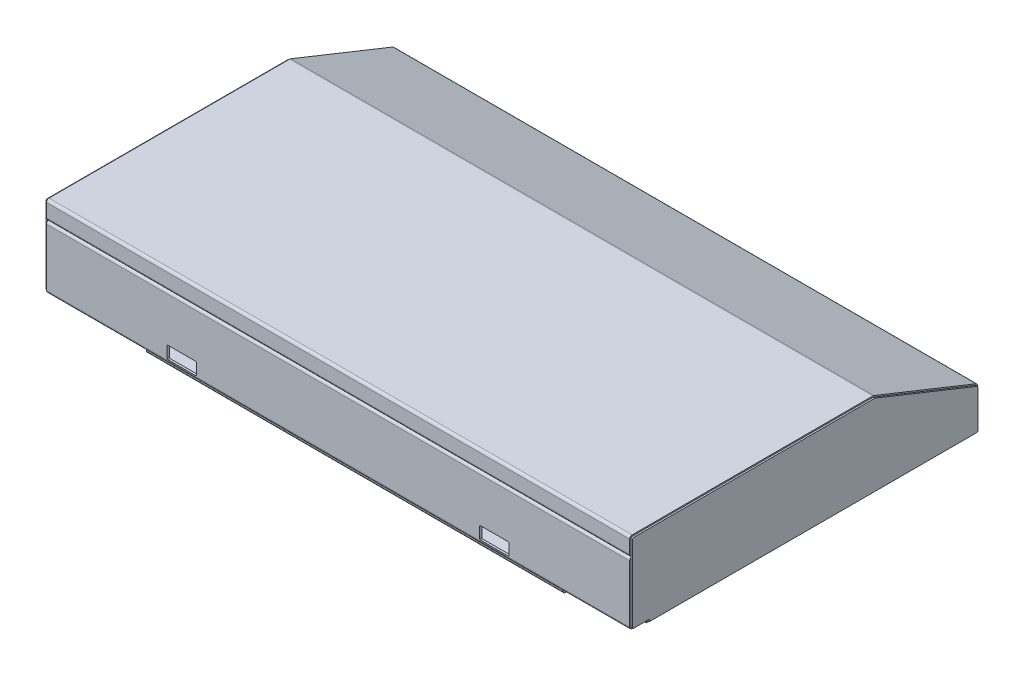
ISO-10303-21;
HEADER;
FILE_DESCRIPTION(('STEP AP214'),'2;1');
FILE_NAME('part.step','',(''),(''),'','','');
FILE_SCHEMA(('AUTOMOTIVE_DESIGN { 1 0 10303 214 1 1 1 1 }'));
ENDSEC;
DATA;
#1=APPLICATION_CONTEXT('core data for automotive mechanical design processes');
#2=APPLICATION_PROTOCOL_DEFINITION('international standard','automotive_design',2000,#1);
#3=PRODUCT_CONTEXT('',#1,'mechanical');
#4=PRODUCT('Part','Part','',(#3));
#5=PRODUCT_RELATED_PRODUCT_CATEGORY('part','',(#4));
#6=PRODUCT_DEFINITION_FORMATION('','',#4);
#7=PRODUCT_DEFINITION_CONTEXT('part definition',#1,'design');
#8=PRODUCT_DEFINITION('design','',#6,#7);
#9=PRODUCT_DEFINITION_SHAPE('','',#8);
#10=(LENGTH_UNIT() NAMED_UNIT(*) SI_UNIT(.MILLI.,.METRE.));
#11=(NAMED_UNIT(*) PLANE_ANGLE_UNIT() SI_UNIT($,.RADIAN.));
#12=(NAMED_UNIT(*) SI_UNIT($,.STERADIAN.) SOLID_ANGLE_UNIT());
#13=UNCERTAINTY_MEASURE_WITH_UNIT(LENGTH_MEASURE(1.E-05),#10,'distance_accuracy_value','');
#14=(GEOMETRIC_REPRESENTATION_CONTEXT(3) GLOBAL_UNCERTAINTY_ASSIGNED_CONTEXT((#13)) GLOBAL_UNIT_ASSIGNED_CONTEXT((#10,
#11,#12)) REPRESENTATION_CONTEXT('',''));
#15=CARTESIAN_POINT('',(0.,0.,0.));
#16=DIRECTION('',(0.,0.,1.));
#17=DIRECTION('',(1.,0.,0.));
#18=AXIS2_PLACEMENT_3D('',#15,#16,#17);
#19=CARTESIAN_POINT('',(704.,-152.,-13.));
#20=DIRECTION('',(0.,1.,0.));
#21=DIRECTION('',(0.,0.,1.));
#22=AXIS2_PLACEMENT_3D('',#19,#20,#21);
#23=PLANE('',#22);
#24=DIRECTION('',(0.,0.,1.));
#25=VECTOR('',#24,1.);
#26=CARTESIAN_POINT('',(700.,-152.,-13.));
#27=LINE('',#26,#25);
#28=CARTESIAN_POINT('',(700.,-152.,-798.985029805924));
#29=VERTEX_POINT('',#28);
#30=CARTESIAN_POINT('',(700.,-152.,-13.));
#31=VERTEX_POINT('',#30);
#32=EDGE_CURVE('E166',#29,#31,#27,.T.);
#33=ORIENTED_EDGE('',*,*,#32,.F.);
#34=DIRECTION('',(-1.,0.,0.));
#35=VECTOR('',#34,1.);
#36=CARTESIAN_POINT('',(704.,-152.,-798.985029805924));
#37=LINE('',#36,#35);
#38=CARTESIAN_POINT('',(704.,-152.,-798.985029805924));
#39=VERTEX_POINT('',#38);
#40=EDGE_CURVE('E165',#39,#29,#37,.T.);
#41=ORIENTED_EDGE('',*,*,#40,.F.);
#42=DIRECTION('',(0.,0.,1.));
#43=VECTOR('',#42,1.);
#44=CARTESIAN_POINT('',(704.,-152.,-13.));
#45=LINE('',#44,#43);
#46=CARTESIAN_POINT('',(704.,-152.,-13.));
#47=VERTEX_POINT('',#46);
#48=EDGE_CURVE('E196',#39,#47,#45,.T.);
#49=ORIENTED_EDGE('',*,*,#48,.T.);
#50=DIRECTION('',(-1.,0.,0.));
#51=VECTOR('',#50,1.);
#52=CARTESIAN_POINT('',(704.,-152.,-13.));
#53=LINE('',#52,#51);
#54=EDGE_CURVE('E12',#47,#31,#53,.T.);
#55=ORIENTED_EDGE('',*,*,#54,.T.);
#56=EDGE_LOOP('',(#33,#41,#49,#55));
#57=FACE_BOUND('',#56,.T.);
#58=ADVANCED_FACE('F46',(#57),#23,.F.);
#59=CARTESIAN_POINT('',(704.,-152.,-13.));
#60=DIRECTION('',(0.,0.,-1.));
#61=DIRECTION('',(0.,1.,0.));
#62=AXIS2_PLACEMENT_3D('',#59,#60,#61);
#63=PLANE('',#62);
#64=DIRECTION('',(0.,1.,0.));
#65=VECTOR('',#64,1.);
#66=CARTESIAN_POINT('',(700.,-152.,-13.));
#67=LINE('',#66,#65);
#68=CARTESIAN_POINT('',(700.,-147.,-13.));
#69=VERTEX_POINT('',#68);
#70=EDGE_CURVE('E168',#31,#69,#67,.T.);
#71=ORIENTED_EDGE('',*,*,#70,.F.);
#72=ORIENTED_EDGE('',*,*,#54,.F.);
#73=DIRECTION('',(0.,1.,0.));
#74=VECTOR('',#73,1.);
#75=CARTESIAN_POINT('',(704.,-152.,-13.));
#76=LINE('',#75,#74);
#77=CARTESIAN_POINT('',(704.,-147.,-13.));
#78=VERTEX_POINT('',#77);
#79=EDGE_CURVE('E112',#47,#78,#76,.T.);
#80=ORIENTED_EDGE('',*,*,#79,.T.);
#81=DIRECTION('',(-1.,0.,0.));
#82=VECTOR('',#81,1.);
#83=CARTESIAN_POINT('',(704.,-147.,-13.));
#84=LINE('',#83,#82);
#85=EDGE_CURVE('E54',#78,#69,#84,.T.);
#86=ORIENTED_EDGE('',*,*,#85,.T.);
#87=EDGE_LOOP('',(#71,#72,#80,#86));
#88=FACE_BOUND('',#87,.T.);
#89=ADVANCED_FACE('F220',(#88),#63,.F.);
#90=CARTESIAN_POINT('',(704.,-147.,24.));
#91=DIRECTION('',(0.,1.,0.));
#92=DIRECTION('',(0.,0.,1.));
#93=AXIS2_PLACEMENT_3D('',#90,#91,#92);
#94=PLANE('',#93);
#95=DIRECTION('',(0.,0.,1.));
#96=VECTOR('',#95,1.);
#97=CARTESIAN_POINT('',(700.,-147.,24.));
#98=LINE('',#97,#96);
#99=CARTESIAN_POINT('',(700.,-147.,24.));
#100=VERTEX_POINT('',#99);
#101=EDGE_CURVE('E171',#69,#100,#98,.T.);
#102=ORIENTED_EDGE('',*,*,#101,.F.);
#103=ORIENTED_EDGE('',*,*,#85,.F.);
#104=DIRECTION('',(0.,0.,1.));
#105=VECTOR('',#104,1.);
#106=CARTESIAN_POINT('',(704.,-147.,24.));
#107=LINE('',#106,#105);
#108=CARTESIAN_POINT('',(704.,-147.,24.));
#109=VERTEX_POINT('',#108);
#110=EDGE_CURVE('E229',#78,#109,#107,.T.);
#111=ORIENTED_EDGE('',*,*,#110,.T.);
#112=DIRECTION('',(-1.,0.,0.));
#113=VECTOR('',#112,1.);
#114=CARTESIAN_POINT('',(704.,-147.,24.));
#115=LINE('',#114,#113);
#116=EDGE_CURVE('E215',#109,#100,#115,.T.);
#117=ORIENTED_EDGE('',*,*,#116,.T.);
#118=EDGE_LOOP('',(#102,#103,#111,#117));
#119=FACE_BOUND('',#118,.T.);
#120=ADVANCED_FACE('F263',(#119),#94,.F.);
#121=CARTESIAN_POINT('',(704.,-144.,24.));
#122=DIRECTION('',(-1.,0.,0.));
#123=DIRECTION('',(0.,0.,-1.));
#124=AXIS2_PLACEMENT_3D('',#121,#122,#123);
#125=CYLINDRICAL_SURFACE('',#124,3.);
#126=CARTESIAN_POINT('',(700.,-144.,24.));
#127=DIRECTION('',(-1.,0.,0.));
#128=DIRECTION('',(0.,0.,1.));
#129=AXIS2_PLACEMENT_3D('',#126,#127,#128);
#130=CIRCLE('',#129,3.);
#131=CARTESIAN_POINT('',(700.,-144.,27.));
#132=VERTEX_POINT('',#131);
#133=EDGE_CURVE('E174',#100,#132,#130,.T.);
#134=ORIENTED_EDGE('',*,*,#133,.F.);
#135=ORIENTED_EDGE('',*,*,#116,.F.);
#136=CARTESIAN_POINT('',(704.,-144.,24.));
#137=DIRECTION('',(-1.,0.,0.));
#138=DIRECTION('',(0.,0.,1.));
#139=AXIS2_PLACEMENT_3D('',#136,#137,#138);
#140=CIRCLE('',#139,3.);
#141=CARTESIAN_POINT('',(704.,-144.,27.));
#142=VERTEX_POINT('',#141);
#143=EDGE_CURVE('E233',#109,#142,#140,.T.);
#144=ORIENTED_EDGE('',*,*,#143,.T.);
#145=DIRECTION('',(-1.,0.,0.));
#146=VECTOR('',#145,1.);
#147=CARTESIAN_POINT('',(704.,-144.,27.));
#148=LINE('',#147,#146);
#149=EDGE_CURVE('E212',#142,#132,#148,.T.);
#150=ORIENTED_EDGE('',*,*,#149,.T.);
#151=EDGE_LOOP('',(#134,#135,#144,#150));
#152=FACE_BOUND('',#151,.T.);
#153=ADVANCED_FACE('F262',(#152),#125,.T.);
#154=CARTESIAN_POINT('',(704.,38.9999999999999,27.));
#155=DIRECTION('',(0.,0.,-1.));
#156=DIRECTION('',(0.,1.,0.));
#157=AXIS2_PLACEMENT_3D('',#154,#155,#156);
#158=PLANE('',#157);
#159=DIRECTION('',(0.,1.,0.));
#160=VECTOR('',#159,1.);
#161=CARTESIAN_POINT('',(700.,38.9999999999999,27.));
#162=LINE('',#161,#160);
#163=CARTESIAN_POINT('',(700.,38.9999999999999,27.));
#164=VERTEX_POINT('',#163);
#165=EDGE_CURVE('E177',#132,#164,#162,.T.);
#166=ORIENTED_EDGE('',*,*,#165,.F.);
#167=ORIENTED_EDGE('',*,*,#149,.F.);
#168=DIRECTION('',(0.,1.,0.));
#169=VECTOR('',#168,1.);
#170=CARTESIAN_POINT('',(704.,7.,27.));
#171=LINE('',#170,#169);
#172=CARTESIAN_POINT('',(704.,38.9999999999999,27.));
#173=VERTEX_POINT('',#172);
#174=EDGE_CURVE('E236',#142,#173,#171,.T.);
#175=ORIENTED_EDGE('',*,*,#174,.T.);
#176=DIRECTION('',(-1.,0.,0.));
#177=VECTOR('',#176,1.);
#178=CARTESIAN_POINT('',(704.,38.9999999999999,27.));
#179=LINE('',#178,#177);
#180=EDGE_CURVE('E209',#173,#164,#179,.T.);
#181=ORIENTED_EDGE('',*,*,#180,.T.);
#182=EDGE_LOOP('',(#166,#167,#175,#181));
#183=FACE_BOUND('',#182,.T.);
#184=ADVANCED_FACE('F260',(#183),#158,.F.);
#185=CARTESIAN_POINT('',(704.,38.9999999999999,24.));
#186=DIRECTION('',(-1.,0.,0.));
#187=DIRECTION('',(0.,0.,-1.));
#188=AXIS2_PLACEMENT_3D('',#185,#186,#187);
#189=CYLINDRICAL_SURFACE('',#188,3.);
#190=CARTESIAN_POINT('',(700.,38.9999999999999,24.));
#191=DIRECTION('',(-1.,0.,0.));
#192=DIRECTION('',(0.,0.,1.));
#193=AXIS2_PLACEMENT_3D('',#190,#191,#192);
#194=CIRCLE('',#193,3.);
#195=CARTESIAN_POINT('',(700.,41.9999999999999,24.));
#196=VERTEX_POINT('',#195);
#197=EDGE_CURVE('E180',#164,#196,#194,.T.);
#198=ORIENTED_EDGE('',*,*,#197,.F.);
#199=ORIENTED_EDGE('',*,*,#180,.F.);
#200=CARTESIAN_POINT('',(704.,38.9999999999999,24.));
#201=DIRECTION('',(-1.,0.,0.));
#202=DIRECTION('',(0.,0.,1.));
#203=AXIS2_PLACEMENT_3D('',#200,#201,#202);
#204=CIRCLE('',#203,3.);
#205=CARTESIAN_POINT('',(704.,41.9999999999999,24.));
#206=VERTEX_POINT('',#205);
#207=EDGE_CURVE('E239',#173,#206,#204,.T.);
#208=ORIENTED_EDGE('',*,*,#207,.T.);
#209=DIRECTION('',(-1.,0.,0.));
#210=VECTOR('',#209,1.);
#211=CARTESIAN_POINT('',(704.,41.9999999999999,24.));
#212=LINE('',#211,#210);
#213=EDGE_CURVE('E206',#206,#196,#212,.T.);
#214=ORIENTED_EDGE('',*,*,#213,.T.);
#215=EDGE_LOOP('',(#198,#199,#208,#214));
#216=FACE_BOUND('',#215,.T.);
#217=ADVANCED_FACE('F256',(#216),#189,.T.);
#218=CARTESIAN_POINT('',(704.,42.,-553.82953538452));
#219=DIRECTION('',(0.,-1.,0.));
#220=DIRECTION('',(0.,0.,-1.));
#221=AXIS2_PLACEMENT_3D('',#218,#219,#220);
#222=PLANE('',#221);
#223=DIRECTION('',(0.,0.,-1.));
#224=VECTOR('',#223,1.);
#225=CARTESIAN_POINT('',(700.,42.,-553.82953538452));
#226=LINE('',#225,#224);
#227=CARTESIAN_POINT('',(700.,42.,-553.82953538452));
#228=VERTEX_POINT('',#227);
#229=EDGE_CURVE('E183',#196,#228,#226,.T.);
#230=ORIENTED_EDGE('',*,*,#229,.F.);
#231=ORIENTED_EDGE('',*,*,#213,.F.);
#232=DIRECTION('',(0.,0.,-1.));
#233=VECTOR('',#232,1.);
#234=CARTESIAN_POINT('',(704.,42.,-553.82953538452));
#235=LINE('',#234,#233);
#236=CARTESIAN_POINT('',(704.,42.,-553.82953538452));
#237=VERTEX_POINT('',#236);
#238=EDGE_CURVE('E242',#206,#237,#235,.T.);
#239=ORIENTED_EDGE('',*,*,#238,.T.);
#240=DIRECTION('',(-1.,0.,0.));
#241=VECTOR('',#240,1.);
#242=CARTESIAN_POINT('',(704.,42.,-553.82953538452));
#243=LINE('',#242,#241);
#244=EDGE_CURVE('E203',#237,#228,#243,.T.);
#245=ORIENTED_EDGE('',*,*,#244,.T.);
#246=EDGE_LOOP('',(#230,#231,#239,#245));
#247=FACE_BOUND('',#246,.T.);
#248=ADVANCED_FACE('F253',(#247),#222,.F.);
#249=CARTESIAN_POINT('',(704.,39.,-553.82953538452));
#250=DIRECTION('',(-1.,0.,0.));
#251=DIRECTION('',(0.,0.,-1.));
#252=AXIS2_PLACEMENT_3D('',#249,#250,#251);
#253=CYLINDRICAL_SURFACE('',#252,3.00000000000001);
#254=CARTESIAN_POINT('',(700.,39.,-553.82953538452));
#255=DIRECTION('',(-1.,0.,0.));
#256=DIRECTION('',(0.,0.,1.));
#257=AXIS2_PLACEMENT_3D('',#254,#255,#256);
#258=CIRCLE('',#257,3.00000000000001);
#259=CARTESIAN_POINT('',(700.,41.7854300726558,-554.943707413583));
#260=VERTEX_POINT('',#259);
#261=EDGE_CURVE('E186',#228,#260,#258,.T.);
#262=ORIENTED_EDGE('',*,*,#261,.F.);
#263=ORIENTED_EDGE('',*,*,#244,.F.);
#264=CARTESIAN_POINT('',(704.,39.,-553.82953538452));
#265=DIRECTION('',(-1.,0.,0.));
#266=DIRECTION('',(0.,0.,1.));
#267=AXIS2_PLACEMENT_3D('',#264,#265,#266);
#268=CIRCLE('',#267,3.00000000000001);
#269=CARTESIAN_POINT('',(704.,41.7854300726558,-554.943707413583));
#270=VERTEX_POINT('',#269);
#271=EDGE_CURVE('E160',#237,#270,#268,.T.);
#272=ORIENTED_EDGE('',*,*,#271,.T.);
#273=DIRECTION('',(-1.,0.,0.));
#274=VECTOR('',#273,1.);
#275=CARTESIAN_POINT('',(704.,41.7854300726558,-554.943707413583));
#276=LINE('',#275,#274);
#277=EDGE_CURVE('E200',#270,#260,#276,.T.);
#278=ORIENTED_EDGE('',*,*,#277,.T.);
#279=EDGE_LOOP('',(#262,#263,#272,#278));
#280=FACE_BOUND('',#279,.T.);
#281=ADVANCED_FACE('F247',(#280),#253,.T.);
#282=CARTESIAN_POINT('',(704.,-56.2767676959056,-800.099201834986));
#283=DIRECTION('',(0.,-0.928476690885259,0.371390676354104));
#284=DIRECTION('',(0.,-0.371390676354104,-0.928476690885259));
#285=AXIS2_PLACEMENT_3D('',#282,#283,#284);
#286=PLANE('',#285);
#287=DIRECTION('',(0.,-0.371390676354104,-0.928476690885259));
#288=VECTOR('',#287,1.);
#289=CARTESIAN_POINT('',(700.,-56.2767676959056,-800.099201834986));
#290=LINE('',#289,#288);
#291=CARTESIAN_POINT('',(700.,-56.2767676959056,-800.099201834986));
#292=VERTEX_POINT('',#291);
#293=EDGE_CURVE('E189',#260,#292,#290,.T.);
#294=ORIENTED_EDGE('',*,*,#293,.F.);
#295=ORIENTED_EDGE('',*,*,#277,.F.);
#296=DIRECTION('',(0.,-0.371390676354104,-0.928476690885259));
#297=VECTOR('',#296,1.);
#298=CARTESIAN_POINT('',(704.,-56.2767676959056,-800.099201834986));
#299=LINE('',#298,#297);
#300=CARTESIAN_POINT('',(704.,-56.2767676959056,-800.099201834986));
#301=VERTEX_POINT('',#300);
#302=EDGE_CURVE('E158',#270,#301,#299,.T.);
#303=ORIENTED_EDGE('',*,*,#302,.T.);
#304=DIRECTION('',(-1.,0.,0.));
#305=VECTOR('',#304,1.);
#306=CARTESIAN_POINT('',(704.,-56.2767676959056,-800.099201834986));
#307=LINE('',#306,#305);
#308=EDGE_CURVE('E152',#301,#292,#307,.T.);
#309=ORIENTED_EDGE('',*,*,#308,.T.);
#310=EDGE_LOOP('',(#294,#295,#303,#309));
#311=FACE_BOUND('',#310,.T.);
#312=ADVANCED_FACE('F251',(#311),#286,.F.);
#313=CARTESIAN_POINT('',(704.,-59.0621977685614,-798.985029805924));
#314=DIRECTION('',(-1.,0.,0.));
#315=DIRECTION('',(0.,0.,-1.));
#316=AXIS2_PLACEMENT_3D('',#313,#314,#315);
#317=CYLINDRICAL_SURFACE('',#316,3.00000000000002);
#318=CARTESIAN_POINT('',(700.,-59.0621977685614,-798.985029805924));
#319=DIRECTION('',(-1.,0.,0.));
#320=DIRECTION('',(0.,0.,1.));
#321=AXIS2_PLACEMENT_3D('',#318,#319,#320);
#322=CIRCLE('',#321,3.00000000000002);
#323=CARTESIAN_POINT('',(700.,-59.0621977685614,-801.985029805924));
#324=VERTEX_POINT('',#323);
#325=EDGE_CURVE('E192',#292,#324,#322,.T.);
#326=ORIENTED_EDGE('',*,*,#325,.F.);
#327=ORIENTED_EDGE('',*,*,#308,.F.);
#328=CARTESIAN_POINT('',(704.,-59.0621977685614,-798.985029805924));
#329=DIRECTION('',(-1.,0.,0.));
#330=DIRECTION('',(0.,0.,1.));
#331=AXIS2_PLACEMENT_3D('',#328,#329,#330);
#332=CIRCLE('',#331,3.00000000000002);
#333=CARTESIAN_POINT('',(704.,-59.0621977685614,-801.985029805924));
#334=VERTEX_POINT('',#333);
#335=EDGE_CURVE('E142',#301,#334,#332,.T.);
#336=ORIENTED_EDGE('',*,*,#335,.T.);
#337=DIRECTION('',(-1.,0.,0.));
#338=VECTOR('',#337,1.);
#339=CARTESIAN_POINT('',(704.,-59.0621977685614,-801.985029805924));
#340=LINE('',#339,#338);
#341=EDGE_CURVE('E147',#334,#324,#340,.T.);
#342=ORIENTED_EDGE('',*,*,#341,.T.);
#343=EDGE_LOOP('',(#326,#327,#336,#342));
#344=FACE_BOUND('',#343,.T.);
#345=ADVANCED_FACE('F155',(#344),#317,.T.);
#346=CARTESIAN_POINT('',(704.,-149.,-801.985029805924));
#347=DIRECTION('',(0.,0.,1.));
#348=DIRECTION('',(-1.,0.,0.));
#349=AXIS2_PLACEMENT_3D('',#346,#347,#348);
#350=PLANE('',#349);
#351=DIRECTION('',(0.,-1.,0.));
#352=VECTOR('',#351,1.);
#353=CARTESIAN_POINT('',(700.,-149.,-801.985029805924));
#354=LINE('',#353,#352);
#355=CARTESIAN_POINT('',(700.,-149.,-801.985029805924));
#356=VERTEX_POINT('',#355);
#357=EDGE_CURVE('E149',#324,#356,#354,.T.);
#358=ORIENTED_EDGE('',*,*,#357,.F.);
#359=ORIENTED_EDGE('',*,*,#341,.F.);
#360=DIRECTION('',(0.,-1.,0.));
#361=VECTOR('',#360,1.);
#362=CARTESIAN_POINT('',(704.,-149.,-801.985029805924));
#363=LINE('',#362,#361);
#364=CARTESIAN_POINT('',(704.,-149.,-801.985029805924));
#365=VERTEX_POINT('',#364);
#366=EDGE_CURVE('E138',#334,#365,#363,.T.);
#367=ORIENTED_EDGE('',*,*,#366,.T.);
#368=DIRECTION('',(-1.,0.,0.));
#369=VECTOR('',#368,1.);
#370=CARTESIAN_POINT('',(704.,-149.,-801.985029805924));
#371=LINE('',#370,#369);
#372=EDGE_CURVE('E153',#365,#356,#371,.T.);
#373=ORIENTED_EDGE('',*,*,#372,.T.);
#374=EDGE_LOOP('',(#358,#359,#367,#373));
#375=FACE_BOUND('',#374,.T.);
#376=ADVANCED_FACE('F148',(#375),#350,.F.);
#377=CARTESIAN_POINT('',(704.,-149.,-798.985029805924));
#378=DIRECTION('',(-1.,0.,0.));
#379=DIRECTION('',(0.,0.,-1.));
#380=AXIS2_PLACEMENT_3D('',#377,#378,#379);
#381=CYLINDRICAL_SURFACE('',#380,3.);
#382=CARTESIAN_POINT('',(700.,-149.,-798.985029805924));
#383=DIRECTION('',(-1.,0.,0.));
#384=DIRECTION('',(0.,0.,1.));
#385=AXIS2_PLACEMENT_3D('',#382,#383,#384);
#386=CIRCLE('',#385,3.);
#387=EDGE_CURVE('E100',#356,#29,#386,.T.);
#388=ORIENTED_EDGE('',*,*,#387,.F.);
#389=ORIENTED_EDGE('',*,*,#372,.F.);
#390=CARTESIAN_POINT('',(704.,-149.,-798.985029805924));
#391=DIRECTION('',(-1.,0.,0.));
#392=DIRECTION('',(0.,0.,1.));
#393=AXIS2_PLACEMENT_3D('',#390,#391,#392);
#394=CIRCLE('',#393,3.);
#395=EDGE_CURVE('E62',#365,#39,#394,.T.);
#396=ORIENTED_EDGE('',*,*,#395,.T.);
#397=ORIENTED_EDGE('',*,*,#40,.T.);
#398=EDGE_LOOP('',(#388,#389,#396,#397));
#399=FACE_BOUND('',#398,.T.);
#400=ADVANCED_FACE('F346',(#399),#381,.T.);
#401=CARTESIAN_POINT('',(704.,-149.,-798.985029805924));
#402=DIRECTION('',(1.,0.,0.));
#403=DIRECTION('',(0.,0.,1.));
#404=AXIS2_PLACEMENT_3D('',#401,#402,#403);
#405=PLANE('',#404);
#406=ORIENTED_EDGE('',*,*,#48,.F.);
#407=ORIENTED_EDGE('',*,*,#395,.F.);
#408=ORIENTED_EDGE('',*,*,#366,.F.);
#409=ORIENTED_EDGE('',*,*,#335,.F.);
#410=ORIENTED_EDGE('',*,*,#302,.F.);
#411=ORIENTED_EDGE('',*,*,#271,.F.);
#412=ORIENTED_EDGE('',*,*,#238,.F.);
#413=ORIENTED_EDGE('',*,*,#207,.F.);
#414=ORIENTED_EDGE('',*,*,#174,.F.);
#415=ORIENTED_EDGE('',*,*,#143,.F.);
#416=ORIENTED_EDGE('',*,*,#110,.F.);
#417=ORIENTED_EDGE('',*,*,#79,.F.);
#418=EDGE_LOOP('',(#406,#407,#408,#409,#410,#411,#412,#413,#414,#415,#416,#417));
#419=FACE_BOUND('',#418,.T.);
#420=ADVANCED_FACE('F140',(#419),#405,.T.);
#421=CARTESIAN_POINT('',(700.,-149.,-798.985029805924));
#422=DIRECTION('',(1.,0.,0.));
#423=DIRECTION('',(0.,0.,1.));
#424=AXIS2_PLACEMENT_3D('',#421,#422,#423);
#425=PLANE('',#424);
#426=ORIENTED_EDGE('',*,*,#32,.T.);
#427=ORIENTED_EDGE('',*,*,#70,.T.);
#428=ORIENTED_EDGE('',*,*,#101,.T.);
#429=ORIENTED_EDGE('',*,*,#133,.T.);
#430=ORIENTED_EDGE('',*,*,#165,.T.);
#431=ORIENTED_EDGE('',*,*,#197,.T.);
#432=ORIENTED_EDGE('',*,*,#229,.T.);
#433=ORIENTED_EDGE('',*,*,#261,.T.);
#434=ORIENTED_EDGE('',*,*,#293,.T.);
#435=ORIENTED_EDGE('',*,*,#325,.T.);
#436=ORIENTED_EDGE('',*,*,#357,.T.);
#437=ORIENTED_EDGE('',*,*,#387,.T.);
#438=EDGE_LOOP('',(#426,#427,#428,#429,#430,#431,#432,#433,#434,#435,#436,#437));
#439=FACE_BOUND('',#438,.T.);
#440=ADVANCED_FACE('F223',(#439),#425,.F.);
#441=CLOSED_SHELL('',(#58,#89,#120,#153,#184,#217,#248,#281,#312,#345,#376,#400,#420,#440));
#442=MANIFOLD_SOLID_BREP('B2',#441);
#443=CARTESIAN_POINT('',(-704.,-152.,-13.));
#444=DIRECTION('',(0.,1.,0.));
#445=DIRECTION('',(0.,0.,1.));
#446=AXIS2_PLACEMENT_3D('',#443,#444,#445);
#447=PLANE('',#446);
#448=DIRECTION('',(0.,0.,1.));
#449=VECTOR('',#448,1.);
#450=CARTESIAN_POINT('',(-700.,-152.,-13.));
#451=LINE('',#450,#449);
#452=CARTESIAN_POINT('',(-700.,-152.,-798.985029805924));
#453=VERTEX_POINT('',#452);
#454=CARTESIAN_POINT('',(-700.,-152.,-13.));
#455=VERTEX_POINT('',#454);
#456=EDGE_CURVE('E510',#453,#455,#451,.T.);
#457=ORIENTED_EDGE('',*,*,#456,.T.);
#458=DIRECTION('',(1.,0.,0.));
#459=VECTOR('',#458,1.);
#460=CARTESIAN_POINT('',(-704.,-152.,-13.));
#461=LINE('',#460,#459);
#462=CARTESIAN_POINT('',(-704.,-152.,-13.));
#463=VERTEX_POINT('',#462);
#464=EDGE_CURVE('E44',#463,#455,#461,.T.);
#465=ORIENTED_EDGE('',*,*,#464,.F.);
#466=DIRECTION('',(0.,0.,1.));
#467=VECTOR('',#466,1.);
#468=CARTESIAN_POINT('',(-704.,-152.,-13.));
#469=LINE('',#468,#467);
#470=CARTESIAN_POINT('',(-704.,-152.,-798.985029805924));
#471=VERTEX_POINT('',#470);
#472=EDGE_CURVE('E533',#471,#463,#469,.T.);
#473=ORIENTED_EDGE('',*,*,#472,.F.);
#474=DIRECTION('',(1.,0.,0.));
#475=VECTOR('',#474,1.);
#476=CARTESIAN_POINT('',(-704.,-152.,-798.985029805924));
#477=LINE('',#476,#475);
#478=EDGE_CURVE('E506',#471,#453,#477,.T.);
#479=ORIENTED_EDGE('',*,*,#478,.T.);
#480=EDGE_LOOP('',(#457,#465,#473,#479));
#481=FACE_BOUND('',#480,.T.);
#482=ADVANCED_FACE('F390',(#481),#447,.F.);
#483=CARTESIAN_POINT('',(-704.,-152.,-13.));
#484=DIRECTION('',(0.,0.,-1.));
#485=DIRECTION('',(0.,1.,0.));
#486=AXIS2_PLACEMENT_3D('',#483,#484,#485);
#487=PLANE('',#486);
#488=DIRECTION('',(0.,1.,0.));
#489=VECTOR('',#488,1.);
#490=CARTESIAN_POINT('',(-700.,-152.,-13.));
#491=LINE('',#490,#489);
#492=CARTESIAN_POINT('',(-700.,-147.,-13.));
#493=VERTEX_POINT('',#492);
#494=EDGE_CURVE('E513',#455,#493,#491,.T.);
#495=ORIENTED_EDGE('',*,*,#494,.T.);
#496=DIRECTION('',(1.,0.,0.));
#497=VECTOR('',#496,1.);
#498=CARTESIAN_POINT('',(-704.,-147.,-13.));
#499=LINE('',#498,#497);
#500=CARTESIAN_POINT('',(-704.,-147.,-13.));
#501=VERTEX_POINT('',#500);
#502=EDGE_CURVE('E398',#501,#493,#499,.T.);
#503=ORIENTED_EDGE('',*,*,#502,.F.);
#504=DIRECTION('',(0.,1.,0.));
#505=VECTOR('',#504,1.);
#506=CARTESIAN_POINT('',(-704.,-152.,-13.));
#507=LINE('',#506,#505);
#508=EDGE_CURVE('E461',#463,#501,#507,.T.);
#509=ORIENTED_EDGE('',*,*,#508,.F.);
#510=ORIENTED_EDGE('',*,*,#464,.T.);
#511=EDGE_LOOP('',(#495,#503,#509,#510));
#512=FACE_BOUND('',#511,.T.);
#513=ADVANCED_FACE('F610',(#512),#487,.F.);
#514=CARTESIAN_POINT('',(-704.,-147.,24.));
#515=DIRECTION('',(0.,1.,0.));
#516=DIRECTION('',(0.,0.,1.));
#517=AXIS2_PLACEMENT_3D('',#514,#515,#516);
#518=PLANE('',#517);
#519=DIRECTION('',(0.,0.,1.));
#520=VECTOR('',#519,1.);
#521=CARTESIAN_POINT('',(-700.,-147.,24.));
#522=LINE('',#521,#520);
#523=CARTESIAN_POINT('',(-700.,-147.,24.));
#524=VERTEX_POINT('',#523);
#525=EDGE_CURVE('E515',#493,#524,#522,.T.);
#526=ORIENTED_EDGE('',*,*,#525,.T.);
#527=DIRECTION('',(1.,0.,0.));
#528=VECTOR('',#527,1.);
#529=CARTESIAN_POINT('',(-704.,-147.,24.));
#530=LINE('',#529,#528);
#531=CARTESIAN_POINT('',(-704.,-147.,24.));
#532=VERTEX_POINT('',#531);
#533=EDGE_CURVE('E552',#532,#524,#530,.T.);
#534=ORIENTED_EDGE('',*,*,#533,.F.);
#535=DIRECTION('',(0.,0.,1.));
#536=VECTOR('',#535,1.);
#537=CARTESIAN_POINT('',(-704.,-147.,24.));
#538=LINE('',#537,#536);
#539=EDGE_CURVE('E560',#501,#532,#538,.T.);
#540=ORIENTED_EDGE('',*,*,#539,.F.);
#541=ORIENTED_EDGE('',*,*,#502,.T.);
#542=EDGE_LOOP('',(#526,#534,#540,#541));
#543=FACE_BOUND('',#542,.T.);
#544=ADVANCED_FACE('F558',(#543),#518,.F.);
#545=CARTESIAN_POINT('',(-704.,-144.,24.));
#546=DIRECTION('',(1.,0.,0.));
#547=DIRECTION('',(0.,0.,-1.));
#548=AXIS2_PLACEMENT_3D('',#545,#546,#547);
#549=CYLINDRICAL_SURFACE('',#548,3.);
#550=CARTESIAN_POINT('',(-700.,-144.,24.));
#551=DIRECTION('',(-1.,0.,0.));
#552=DIRECTION('',(0.,0.,1.));
#553=AXIS2_PLACEMENT_3D('',#550,#551,#552);
#554=CIRCLE('',#553,3.);
#555=CARTESIAN_POINT('',(-700.,-144.,27.));
#556=VERTEX_POINT('',#555);
#557=EDGE_CURVE('E517',#524,#556,#554,.T.);
#558=ORIENTED_EDGE('',*,*,#557,.T.);
#559=DIRECTION('',(1.,0.,0.));
#560=VECTOR('',#559,1.);
#561=CARTESIAN_POINT('',(-704.,-144.,27.));
#562=LINE('',#561,#560);
#563=CARTESIAN_POINT('',(-704.,-144.,27.));
#564=VERTEX_POINT('',#563);
#565=EDGE_CURVE('E549',#564,#556,#562,.T.);
#566=ORIENTED_EDGE('',*,*,#565,.F.);
#567=CARTESIAN_POINT('',(-704.,-144.,24.));
#568=DIRECTION('',(-1.,0.,0.));
#569=DIRECTION('',(0.,0.,1.));
#570=AXIS2_PLACEMENT_3D('',#567,#568,#569);
#571=CIRCLE('',#570,3.);
#572=EDGE_CURVE('E577',#532,#564,#571,.T.);
#573=ORIENTED_EDGE('',*,*,#572,.F.);
#574=ORIENTED_EDGE('',*,*,#533,.T.);
#575=EDGE_LOOP('',(#558,#566,#573,#574));
#576=FACE_BOUND('',#575,.T.);
#577=ADVANCED_FACE('F568',(#576),#549,.T.);
#578=CARTESIAN_POINT('',(-704.,38.9999999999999,27.));
#579=DIRECTION('',(0.,0.,-1.));
#580=DIRECTION('',(0.,1.,0.));
#581=AXIS2_PLACEMENT_3D('',#578,#579,#580);
#582=PLANE('',#581);
#583=DIRECTION('',(0.,1.,0.));
#584=VECTOR('',#583,1.);
#585=CARTESIAN_POINT('',(-700.,38.9999999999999,27.));
#586=LINE('',#585,#584);
#587=CARTESIAN_POINT('',(-700.,38.9999999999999,27.));
#588=VERTEX_POINT('',#587);
#589=EDGE_CURVE('E520',#556,#588,#586,.T.);
#590=ORIENTED_EDGE('',*,*,#589,.T.);
#591=DIRECTION('',(1.,0.,0.));
#592=VECTOR('',#591,1.);
#593=CARTESIAN_POINT('',(-704.,38.9999999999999,27.));
#594=LINE('',#593,#592);
#595=CARTESIAN_POINT('',(-704.,38.9999999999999,27.));
#596=VERTEX_POINT('',#595);
#597=EDGE_CURVE('E546',#596,#588,#594,.T.);
#598=ORIENTED_EDGE('',*,*,#597,.F.);
#599=DIRECTION('',(0.,1.,0.));
#600=VECTOR('',#599,1.);
#601=CARTESIAN_POINT('',(-704.,7.,27.));
#602=LINE('',#601,#600);
#603=EDGE_CURVE('E574',#564,#596,#602,.T.);
#604=ORIENTED_EDGE('',*,*,#603,.F.);
#605=ORIENTED_EDGE('',*,*,#565,.T.);
#606=EDGE_LOOP('',(#590,#598,#604,#605));
#607=FACE_BOUND('',#606,.T.);
#608=ADVANCED_FACE('F572',(#607),#582,.F.);
#609=CARTESIAN_POINT('',(-704.,38.9999999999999,24.));
#610=DIRECTION('',(1.,0.,0.));
#611=DIRECTION('',(0.,0.,-1.));
#612=AXIS2_PLACEMENT_3D('',#609,#610,#611);
#613=CYLINDRICAL_SURFACE('',#612,3.);
#614=CARTESIAN_POINT('',(-700.,38.9999999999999,24.));
#615=DIRECTION('',(-1.,0.,0.));
#616=DIRECTION('',(0.,0.,1.));
#617=AXIS2_PLACEMENT_3D('',#614,#615,#616);
#618=CIRCLE('',#617,3.);
#619=CARTESIAN_POINT('',(-700.,41.9999999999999,24.));
#620=VERTEX_POINT('',#619);
#621=EDGE_CURVE('E522',#588,#620,#618,.T.);
#622=ORIENTED_EDGE('',*,*,#621,.T.);
#623=DIRECTION('',(1.,0.,0.));
#624=VECTOR('',#623,1.);
#625=CARTESIAN_POINT('',(-704.,41.9999999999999,24.));
#626=LINE('',#625,#624);
#627=CARTESIAN_POINT('',(-704.,41.9999999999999,24.));
#628=VERTEX_POINT('',#627);
#629=EDGE_CURVE('E543',#628,#620,#626,.T.);
#630=ORIENTED_EDGE('',*,*,#629,.F.);
#631=CARTESIAN_POINT('',(-704.,38.9999999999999,24.));
#632=DIRECTION('',(-1.,0.,0.));
#633=DIRECTION('',(0.,0.,1.));
#634=AXIS2_PLACEMENT_3D('',#631,#632,#633);
#635=CIRCLE('',#634,3.);
#636=EDGE_CURVE('E576',#596,#628,#635,.T.);
#637=ORIENTED_EDGE('',*,*,#636,.F.);
#638=ORIENTED_EDGE('',*,*,#597,.T.);
#639=EDGE_LOOP('',(#622,#630,#637,#638));
#640=FACE_BOUND('',#639,.T.);
#641=ADVANCED_FACE('F623',(#640),#613,.T.);
#642=CARTESIAN_POINT('',(-704.,42.,-553.82953538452));
#643=DIRECTION('',(0.,-1.,0.));
#644=DIRECTION('',(0.,0.,-1.));
#645=AXIS2_PLACEMENT_3D('',#642,#643,#644);
#646=PLANE('',#645);
#647=DIRECTION('',(0.,0.,-1.));
#648=VECTOR('',#647,1.);
#649=CARTESIAN_POINT('',(-700.,42.,-553.82953538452));
#650=LINE('',#649,#648);
#651=CARTESIAN_POINT('',(-700.,42.,-553.82953538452));
#652=VERTEX_POINT('',#651);
#653=EDGE_CURVE('E524',#620,#652,#650,.T.);
#654=ORIENTED_EDGE('',*,*,#653,.T.);
#655=DIRECTION('',(1.,0.,0.));
#656=VECTOR('',#655,1.);
#657=CARTESIAN_POINT('',(-704.,42.,-553.82953538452));
#658=LINE('',#657,#656);
#659=CARTESIAN_POINT('',(-704.,42.,-553.82953538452));
#660=VERTEX_POINT('',#659);
#661=EDGE_CURVE('E540',#660,#652,#658,.T.);
#662=ORIENTED_EDGE('',*,*,#661,.F.);
#663=DIRECTION('',(0.,0.,-1.));
#664=VECTOR('',#663,1.);
#665=CARTESIAN_POINT('',(-704.,42.,-553.82953538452));
#666=LINE('',#665,#664);
#667=EDGE_CURVE('E579',#628,#660,#666,.T.);
#668=ORIENTED_EDGE('',*,*,#667,.F.);
#669=ORIENTED_EDGE('',*,*,#629,.T.);
#670=EDGE_LOOP('',(#654,#662,#668,#669));
#671=FACE_BOUND('',#670,.T.);
#672=ADVANCED_FACE('F626',(#671),#646,.F.);
#673=CARTESIAN_POINT('',(-704.,39.,-553.82953538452));
#674=DIRECTION('',(1.,0.,0.));
#675=DIRECTION('',(0.,0.,-1.));
#676=AXIS2_PLACEMENT_3D('',#673,#674,#675);
#677=CYLINDRICAL_SURFACE('',#676,3.00000000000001);
#678=CARTESIAN_POINT('',(-700.,39.,-553.82953538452));
#679=DIRECTION('',(-1.,0.,0.));
#680=DIRECTION('',(0.,0.,1.));
#681=AXIS2_PLACEMENT_3D('',#678,#679,#680);
#682=CIRCLE('',#681,3.00000000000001);
#683=CARTESIAN_POINT('',(-700.,41.7854300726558,-554.943707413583));
#684=VERTEX_POINT('',#683);
#685=EDGE_CURVE('E526',#652,#684,#682,.T.);
#686=ORIENTED_EDGE('',*,*,#685,.T.);
#687=DIRECTION('',(1.,0.,0.));
#688=VECTOR('',#687,1.);
#689=CARTESIAN_POINT('',(-704.,41.7854300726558,-554.943707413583));
#690=LINE('',#689,#688);
#691=CARTESIAN_POINT('',(-704.,41.7854300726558,-554.943707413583));
#692=VERTEX_POINT('',#691);
#693=EDGE_CURVE('E537',#692,#684,#690,.T.);
#694=ORIENTED_EDGE('',*,*,#693,.F.);
#695=CARTESIAN_POINT('',(-704.,39.,-553.82953538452));
#696=DIRECTION('',(-1.,0.,0.));
#697=DIRECTION('',(0.,0.,1.));
#698=AXIS2_PLACEMENT_3D('',#695,#696,#697);
#699=CIRCLE('',#698,3.00000000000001);
#700=EDGE_CURVE('E585',#660,#692,#699,.T.);
#701=ORIENTED_EDGE('',*,*,#700,.F.);
#702=ORIENTED_EDGE('',*,*,#661,.T.);
#703=EDGE_LOOP('',(#686,#694,#701,#702));
#704=FACE_BOUND('',#703,.T.);
#705=ADVANCED_FACE('F591',(#704),#677,.T.);
#706=CARTESIAN_POINT('',(-704.,-56.2767676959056,-800.099201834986));
#707=DIRECTION('',(0.,-0.928476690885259,0.371390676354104));
#708=DIRECTION('',(0.,-0.371390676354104,-0.928476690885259));
#709=AXIS2_PLACEMENT_3D('',#706,#707,#708);
#710=PLANE('',#709);
#711=DIRECTION('',(0.,-0.371390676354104,-0.928476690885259));
#712=VECTOR('',#711,1.);
#713=CARTESIAN_POINT('',(-700.,-56.2767676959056,-800.099201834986));
#714=LINE('',#713,#712);
#715=CARTESIAN_POINT('',(-700.,-56.2767676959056,-800.099201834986));
#716=VERTEX_POINT('',#715);
#717=EDGE_CURVE('E528',#684,#716,#714,.T.);
#718=ORIENTED_EDGE('',*,*,#717,.T.);
#719=DIRECTION('',(1.,0.,0.));
#720=VECTOR('',#719,1.);
#721=CARTESIAN_POINT('',(-704.,-56.2767676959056,-800.099201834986));
#722=LINE('',#721,#720);
#723=CARTESIAN_POINT('',(-704.,-56.2767676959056,-800.099201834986));
#724=VERTEX_POINT('',#723);
#725=EDGE_CURVE('E501',#724,#716,#722,.T.);
#726=ORIENTED_EDGE('',*,*,#725,.F.);
#727=DIRECTION('',(0.,-0.371390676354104,-0.928476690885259));
#728=VECTOR('',#727,1.);
#729=CARTESIAN_POINT('',(-704.,-56.2767676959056,-800.099201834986));
#730=LINE('',#729,#728);
#731=EDGE_CURVE('E492',#692,#724,#730,.T.);
#732=ORIENTED_EDGE('',*,*,#731,.F.);
#733=ORIENTED_EDGE('',*,*,#693,.T.);
#734=EDGE_LOOP('',(#718,#726,#732,#733));
#735=FACE_BOUND('',#734,.T.);
#736=ADVANCED_FACE('F595',(#735),#710,.F.);
#737=CARTESIAN_POINT('',(-704.,-59.0621977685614,-798.985029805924));
#738=DIRECTION('',(1.,0.,0.));
#739=DIRECTION('',(0.,0.,-1.));
#740=AXIS2_PLACEMENT_3D('',#737,#738,#739);
#741=CYLINDRICAL_SURFACE('',#740,3.00000000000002);
#742=CARTESIAN_POINT('',(-700.,-59.0621977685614,-798.985029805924));
#743=DIRECTION('',(-1.,0.,0.));
#744=DIRECTION('',(0.,0.,1.));
#745=AXIS2_PLACEMENT_3D('',#742,#743,#744);
#746=CIRCLE('',#745,3.00000000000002);
#747=CARTESIAN_POINT('',(-700.,-59.0621977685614,-801.985029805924));
#748=VERTEX_POINT('',#747);
#749=EDGE_CURVE('E500',#716,#748,#746,.T.);
#750=ORIENTED_EDGE('',*,*,#749,.T.);
#751=DIRECTION('',(1.,0.,0.));
#752=VECTOR('',#751,1.);
#753=CARTESIAN_POINT('',(-704.,-59.0621977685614,-801.985029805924));
#754=LINE('',#753,#752);
#755=CARTESIAN_POINT('',(-704.,-59.0621977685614,-801.985029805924));
#756=VERTEX_POINT('',#755);
#757=EDGE_CURVE('E497',#756,#748,#754,.T.);
#758=ORIENTED_EDGE('',*,*,#757,.F.);
#759=CARTESIAN_POINT('',(-704.,-59.0621977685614,-798.985029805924));
#760=DIRECTION('',(-1.,0.,0.));
#761=DIRECTION('',(0.,0.,1.));
#762=AXIS2_PLACEMENT_3D('',#759,#760,#761);
#763=CIRCLE('',#762,3.00000000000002);
#764=EDGE_CURVE('E486',#724,#756,#763,.T.);
#765=ORIENTED_EDGE('',*,*,#764,.F.);
#766=ORIENTED_EDGE('',*,*,#725,.T.);
#767=EDGE_LOOP('',(#750,#758,#765,#766));
#768=FACE_BOUND('',#767,.T.);
#769=ADVANCED_FACE('F498',(#768),#741,.T.);
#770=CARTESIAN_POINT('',(-704.,-149.,-801.985029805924));
#771=DIRECTION('',(0.,0.,1.));
#772=DIRECTION('',(1.,0.,0.));
#773=AXIS2_PLACEMENT_3D('',#770,#771,#772);
#774=PLANE('',#773);
#775=DIRECTION('',(0.,-1.,0.));
#776=VECTOR('',#775,1.);
#777=CARTESIAN_POINT('',(-700.,-149.,-801.985029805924));
#778=LINE('',#777,#776);
#779=CARTESIAN_POINT('',(-700.,-149.,-801.985029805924));
#780=VERTEX_POINT('',#779);
#781=EDGE_CURVE('E447',#748,#780,#778,.T.);
#782=ORIENTED_EDGE('',*,*,#781,.T.);
#783=DIRECTION('',(1.,0.,0.));
#784=VECTOR('',#783,1.);
#785=CARTESIAN_POINT('',(-704.,-149.,-801.985029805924));
#786=LINE('',#785,#784);
#787=CARTESIAN_POINT('',(-704.,-149.,-801.985029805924));
#788=VERTEX_POINT('',#787);
#789=EDGE_CURVE('E502',#788,#780,#786,.T.);
#790=ORIENTED_EDGE('',*,*,#789,.F.);
#791=DIRECTION('',(0.,-1.,0.));
#792=VECTOR('',#791,1.);
#793=CARTESIAN_POINT('',(-704.,-149.,-801.985029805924));
#794=LINE('',#793,#792);
#795=EDGE_CURVE('E490',#756,#788,#794,.T.);
#796=ORIENTED_EDGE('',*,*,#795,.F.);
#797=ORIENTED_EDGE('',*,*,#757,.T.);
#798=EDGE_LOOP('',(#782,#790,#796,#797));
#799=FACE_BOUND('',#798,.T.);
#800=ADVANCED_FACE('F504',(#799),#774,.F.);
#801=CARTESIAN_POINT('',(-704.,-149.,-798.985029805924));
#802=DIRECTION('',(1.,0.,0.));
#803=DIRECTION('',(0.,0.,-1.));
#804=AXIS2_PLACEMENT_3D('',#801,#802,#803);
#805=CYLINDRICAL_SURFACE('',#804,3.);
#806=CARTESIAN_POINT('',(-700.,-149.,-798.985029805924));
#807=DIRECTION('',(-1.,0.,0.));
#808=DIRECTION('',(0.,0.,1.));
#809=AXIS2_PLACEMENT_3D('',#806,#807,#808);
#810=CIRCLE('',#809,3.);
#811=EDGE_CURVE('E453',#780,#453,#810,.T.);
#812=ORIENTED_EDGE('',*,*,#811,.T.);
#813=ORIENTED_EDGE('',*,*,#478,.F.);
#814=CARTESIAN_POINT('',(-704.,-149.,-798.985029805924));
#815=DIRECTION('',(-1.,0.,0.));
#816=DIRECTION('',(0.,0.,1.));
#817=AXIS2_PLACEMENT_3D('',#814,#815,#816);
#818=CIRCLE('',#817,3.);
#819=EDGE_CURVE('E406',#788,#471,#818,.T.);
#820=ORIENTED_EDGE('',*,*,#819,.F.);
#821=ORIENTED_EDGE('',*,*,#789,.T.);
#822=EDGE_LOOP('',(#812,#813,#820,#821));
#823=FACE_BOUND('',#822,.T.);
#824=ADVANCED_FACE('F599',(#823),#805,.T.);
#825=CARTESIAN_POINT('',(-704.,-149.,-798.985029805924));
#826=DIRECTION('',(-1.,0.,0.));
#827=DIRECTION('',(0.,0.,1.));
#828=AXIS2_PLACEMENT_3D('',#825,#826,#827);
#829=PLANE('',#828);
#830=ORIENTED_EDGE('',*,*,#472,.T.);
#831=ORIENTED_EDGE('',*,*,#508,.T.);
#832=ORIENTED_EDGE('',*,*,#539,.T.);
#833=ORIENTED_EDGE('',*,*,#572,.T.);
#834=ORIENTED_EDGE('',*,*,#603,.T.);
#835=ORIENTED_EDGE('',*,*,#636,.T.);
#836=ORIENTED_EDGE('',*,*,#667,.T.);
#837=ORIENTED_EDGE('',*,*,#700,.T.);
#838=ORIENTED_EDGE('',*,*,#731,.T.);
#839=ORIENTED_EDGE('',*,*,#764,.T.);
#840=ORIENTED_EDGE('',*,*,#795,.T.);
#841=ORIENTED_EDGE('',*,*,#819,.T.);
#842=EDGE_LOOP('',(#830,#831,#832,#833,#834,#835,#836,#837,#838,#839,#840,#841));
#843=FACE_BOUND('',#842,.T.);
#844=ADVANCED_FACE('F488',(#843),#829,.T.);
#845=CARTESIAN_POINT('',(-700.,-149.,-798.985029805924));
#846=DIRECTION('',(-1.,0.,0.));
#847=DIRECTION('',(0.,0.,1.));
#848=AXIS2_PLACEMENT_3D('',#845,#846,#847);
#849=PLANE('',#848);
#850=ORIENTED_EDGE('',*,*,#456,.F.);
#851=ORIENTED_EDGE('',*,*,#811,.F.);
#852=ORIENTED_EDGE('',*,*,#781,.F.);
#853=ORIENTED_EDGE('',*,*,#749,.F.);
#854=ORIENTED_EDGE('',*,*,#717,.F.);
#855=ORIENTED_EDGE('',*,*,#685,.F.);
#856=ORIENTED_EDGE('',*,*,#653,.F.);
#857=ORIENTED_EDGE('',*,*,#621,.F.);
#858=ORIENTED_EDGE('',*,*,#589,.F.);
#859=ORIENTED_EDGE('',*,*,#557,.F.);
#860=ORIENTED_EDGE('',*,*,#525,.F.);
#861=ORIENTED_EDGE('',*,*,#494,.F.);
#862=EDGE_LOOP('',(#850,#851,#852,#853,#854,#855,#856,#857,#858,#859,#860,#861));
#863=FACE_BOUND('',#862,.T.);
#864=ADVANCED_FACE('F564',(#863),#849,.F.);
#865=CLOSED_SHELL('',(#482,#513,#544,#577,#608,#641,#672,#705,#736,#769,#800,#824,#844,#864));
#866=MANIFOLD_SOLID_BREP('B6',#865);
#867=CARTESIAN_POINT('',(700.,0.,30.));
#868=DIRECTION('',(0.,0.,-1.));
#869=DIRECTION('',(0.,1.,0.));
#870=AXIS2_PLACEMENT_3D('',#867,#868,#869);
#871=PLANE('',#870);
#872=DIRECTION('',(1.,0.,0.));
#873=VECTOR('',#872,1.);
#874=CARTESIAN_POINT('',(0.,-112.,30.));
#875=LINE('',#874,#873);
#876=CARTESIAN_POINT('',(-408.,-112.,30.));
#877=VERTEX_POINT('',#876);
#878=CARTESIAN_POINT('',(-342.,-112.,30.));
#879=VERTEX_POINT('',#878);
#880=EDGE_CURVE('E1650',#877,#879,#875,.T.);
#881=ORIENTED_EDGE('',*,*,#880,.T.);
#882=CARTESIAN_POINT('',(-342.,-114.,30.));
#883=DIRECTION('',(0.,0.,-1.));
#884=DIRECTION('',(0.,1.,0.));
#885=AXIS2_PLACEMENT_3D('',#882,#883,#884);
#886=CIRCLE('',#885,2.);
#887=CARTESIAN_POINT('',(-340.,-114.,30.));
#888=VERTEX_POINT('',#887);
#889=EDGE_CURVE('E1638',#879,#888,#886,.T.);
#890=ORIENTED_EDGE('',*,*,#889,.T.);
#891=DIRECTION('',(0.,-1.,0.));
#892=VECTOR('',#891,1.);
#893=CARTESIAN_POINT('',(-340.,0.,30.));
#894=LINE('',#893,#892);
#895=CARTESIAN_POINT('',(-340.,-140.,30.));
#896=VERTEX_POINT('',#895);
#897=EDGE_CURVE('E1656',#888,#896,#894,.T.);
#898=ORIENTED_EDGE('',*,*,#897,.T.);
#899=CARTESIAN_POINT('',(-342.,-140.,30.));
#900=DIRECTION('',(0.,0.,-1.));
#901=DIRECTION('',(0.,1.,0.));
#902=AXIS2_PLACEMENT_3D('',#899,#900,#901);
#903=CIRCLE('',#902,2.);
#904=CARTESIAN_POINT('',(-342.,-142.,30.));
#905=VERTEX_POINT('',#904);
#906=EDGE_CURVE('E1642',#896,#905,#903,.T.);
#907=ORIENTED_EDGE('',*,*,#906,.T.);
#908=DIRECTION('',(1.,0.,0.));
#909=VECTOR('',#908,1.);
#910=CARTESIAN_POINT('',(0.,-142.,30.));
#911=LINE('',#910,#909);
#912=CARTESIAN_POINT('',(-408.,-142.,30.));
#913=VERTEX_POINT('',#912);
#914=EDGE_CURVE('E1152',#913,#905,#911,.T.);
#915=ORIENTED_EDGE('',*,*,#914,.F.);
#916=CARTESIAN_POINT('',(-408.,-140.,30.));
#917=DIRECTION('',(0.,0.,-1.));
#918=DIRECTION('',(0.,1.,0.));
#919=AXIS2_PLACEMENT_3D('',#916,#917,#918);
#920=CIRCLE('',#919,2.);
#921=CARTESIAN_POINT('',(-410.,-140.,30.));
#922=VERTEX_POINT('',#921);
#923=EDGE_CURVE('E740',#913,#922,#920,.T.);
#924=ORIENTED_EDGE('',*,*,#923,.T.);
#925=DIRECTION('',(0.,-1.,0.));
#926=VECTOR('',#925,1.);
#927=CARTESIAN_POINT('',(-410.,0.,30.));
#928=LINE('',#927,#926);
#929=CARTESIAN_POINT('',(-410.,-114.,30.));
#930=VERTEX_POINT('',#929);
#931=EDGE_CURVE('E1651',#930,#922,#928,.T.);
#932=ORIENTED_EDGE('',*,*,#931,.F.);
#933=CARTESIAN_POINT('',(-408.,-114.,30.));
#934=DIRECTION('',(0.,0.,-1.));
#935=DIRECTION('',(0.,1.,0.));
#936=AXIS2_PLACEMENT_3D('',#933,#934,#935);
#937=CIRCLE('',#936,2.);
#938=EDGE_CURVE('E733',#930,#877,#937,.T.);
#939=ORIENTED_EDGE('',*,*,#938,.T.);
#940=EDGE_LOOP('',(#881,#890,#898,#907,#915,#924,#932,#939));
#941=FACE_BOUND('',#940,.T.);
#942=DIRECTION('',(0.,-1.,0.));
#943=VECTOR('',#942,1.);
#944=CARTESIAN_POINT('',(700.,0.,30.));
#945=LINE('',#944,#943);
#946=CARTESIAN_POINT('',(700.,-6.,30.));
#947=VERTEX_POINT('',#946);
#948=CARTESIAN_POINT('',(700.,-144.,30.));
#949=VERTEX_POINT('',#948);
#950=EDGE_CURVE('E1503',#947,#949,#945,.T.);
#951=ORIENTED_EDGE('',*,*,#950,.F.);
#952=DIRECTION('',(-1.,0.,0.));
#953=VECTOR('',#952,1.);
#954=CARTESIAN_POINT('',(700.,-6.,30.));
#955=LINE('',#954,#953);
#956=CARTESIAN_POINT('',(-700.,-6.,30.));
#957=VERTEX_POINT('',#956);
#958=EDGE_CURVE('E1536',#947,#957,#955,.T.);
#959=ORIENTED_EDGE('',*,*,#958,.T.);
#960=DIRECTION('',(0.,-1.,0.));
#961=VECTOR('',#960,1.);
#962=CARTESIAN_POINT('',(-700.,0.,30.));
#963=LINE('',#962,#961);
#964=CARTESIAN_POINT('',(-700.,-144.,30.));
#965=VERTEX_POINT('',#964);
#966=EDGE_CURVE('E1411',#957,#965,#963,.T.);
#967=ORIENTED_EDGE('',*,*,#966,.T.);
#968=DIRECTION('',(-1.,0.,0.));
#969=VECTOR('',#968,1.);
#970=CARTESIAN_POINT('',(700.,-144.,30.));
#971=LINE('',#970,#969);
#972=EDGE_CURVE('E1533',#965,#949,#971,.F.);
#973=ORIENTED_EDGE('',*,*,#972,.T.);
#974=EDGE_LOOP('',(#951,#959,#967,#973));
#975=FACE_BOUND('',#974,.T.);
#976=DIRECTION('',(1.,0.,0.));
#977=VECTOR('',#976,1.);
#978=CARTESIAN_POINT('',(0.,-112.,30.));
#979=LINE('',#978,#977);
#980=CARTESIAN_POINT('',(342.,-112.,30.));
#981=VERTEX_POINT('',#980);
#982=CARTESIAN_POINT('',(408.,-112.,30.));
#983=VERTEX_POINT('',#982);
#984=EDGE_CURVE('E2468',#981,#983,#979,.T.);
#985=ORIENTED_EDGE('',*,*,#984,.T.);
#986=CARTESIAN_POINT('',(408.,-114.,30.));
#987=DIRECTION('',(0.,0.,-1.));
#988=DIRECTION('',(0.,1.,0.));
#989=AXIS2_PLACEMENT_3D('',#986,#987,#988);
#990=CIRCLE('',#989,2.);
#991=CARTESIAN_POINT('',(410.,-114.,30.));
#992=VERTEX_POINT('',#991);
#993=EDGE_CURVE('E1634',#983,#992,#990,.T.);
#994=ORIENTED_EDGE('',*,*,#993,.T.);
#995=DIRECTION('',(0.,-1.,0.));
#996=VECTOR('',#995,1.);
#997=CARTESIAN_POINT('',(410.,0.,30.));
#998=LINE('',#997,#996);
#999=CARTESIAN_POINT('',(410.,-140.,30.));
#1000=VERTEX_POINT('',#999);
#1001=EDGE_CURVE('E2459',#992,#1000,#998,.T.);
#1002=ORIENTED_EDGE('',*,*,#1001,.T.);
#1003=CARTESIAN_POINT('',(408.,-140.,30.));
#1004=DIRECTION('',(0.,0.,-1.));
#1005=DIRECTION('',(0.,1.,0.));
#1006=AXIS2_PLACEMENT_3D('',#1003,#1004,#1005);
#1007=CIRCLE('',#1006,2.);
#1008=CARTESIAN_POINT('',(408.,-142.,30.));
#1009=VERTEX_POINT('',#1008);
#1010=EDGE_CURVE('E1630',#1000,#1009,#1007,.T.);
#1011=ORIENTED_EDGE('',*,*,#1010,.T.);
#1012=DIRECTION('',(1.,0.,0.));
#1013=VECTOR('',#1012,1.);
#1014=CARTESIAN_POINT('',(0.,-142.,30.));
#1015=LINE('',#1014,#1013);
#1016=CARTESIAN_POINT('',(342.,-142.,30.));
#1017=VERTEX_POINT('',#1016);
#1018=EDGE_CURVE('E1688',#1017,#1009,#1015,.T.);
#1019=ORIENTED_EDGE('',*,*,#1018,.F.);
#1020=CARTESIAN_POINT('',(342.,-140.,30.));
#1021=DIRECTION('',(0.,0.,-1.));
#1022=DIRECTION('',(0.,1.,0.));
#1023=AXIS2_PLACEMENT_3D('',#1020,#1021,#1022);
#1024=CIRCLE('',#1023,2.);
#1025=CARTESIAN_POINT('',(340.,-140.,30.));
#1026=VERTEX_POINT('',#1025);
#1027=EDGE_CURVE('E1626',#1017,#1026,#1024,.T.);
#1028=ORIENTED_EDGE('',*,*,#1027,.T.);
#1029=DIRECTION('',(0.,-1.,0.));
#1030=VECTOR('',#1029,1.);
#1031=CARTESIAN_POINT('',(340.,0.,30.));
#1032=LINE('',#1031,#1030);
#1033=CARTESIAN_POINT('',(340.,-114.,30.));
#1034=VERTEX_POINT('',#1033);
#1035=EDGE_CURVE('E1691',#1034,#1026,#1032,.T.);
#1036=ORIENTED_EDGE('',*,*,#1035,.F.);
#1037=CARTESIAN_POINT('',(342.,-114.,30.));
#1038=DIRECTION('',(0.,0.,-1.));
#1039=DIRECTION('',(0.,1.,0.));
#1040=AXIS2_PLACEMENT_3D('',#1037,#1038,#1039);
#1041=CIRCLE('',#1040,2.);
#1042=EDGE_CURVE('E1622',#1034,#981,#1041,.T.);
#1043=ORIENTED_EDGE('',*,*,#1042,.T.);
#1044=EDGE_LOOP('',(#985,#994,#1002,#1011,#1019,#1028,#1036,#1043));
#1045=FACE_BOUND('',#1044,.T.);
#1046=ADVANCED_FACE('F725',(#941,#975,#1045),#871,.F.);
#1047=CARTESIAN_POINT('',(700.,0.,25.));
#1048=DIRECTION('',(0.,0.,-1.));
#1049=DIRECTION('',(0.,1.,0.));
#1050=AXIS2_PLACEMENT_3D('',#1047,#1048,#1049);
#1051=PLANE('',#1050);
#1052=DIRECTION('',(0.,-1.,0.));
#1053=VECTOR('',#1052,1.);
#1054=CARTESIAN_POINT('',(700.,0.,25.));
#1055=LINE('',#1054,#1053);
#1056=CARTESIAN_POINT('',(700.,-6.,25.));
#1057=VERTEX_POINT('',#1056);
#1058=CARTESIAN_POINT('',(700.,-144.,25.));
#1059=VERTEX_POINT('',#1058);
#1060=EDGE_CURVE('E1267',#1057,#1059,#1055,.T.);
#1061=ORIENTED_EDGE('',*,*,#1060,.T.);
#1062=DIRECTION('',(1.,0.,0.));
#1063=VECTOR('',#1062,1.);
#1064=CARTESIAN_POINT('',(700.,-144.,25.));
#1065=LINE('',#1064,#1063);
#1066=CARTESIAN_POINT('',(-700.,-144.,25.));
#1067=VERTEX_POINT('',#1066);
#1068=EDGE_CURVE('E1189',#1067,#1059,#1065,.T.);
#1069=ORIENTED_EDGE('',*,*,#1068,.F.);
#1070=DIRECTION('',(0.,-1.,0.));
#1071=VECTOR('',#1070,1.);
#1072=CARTESIAN_POINT('',(-700.,0.,25.));
#1073=LINE('',#1072,#1071);
#1074=CARTESIAN_POINT('',(-700.,-6.,25.));
#1075=VERTEX_POINT('',#1074);
#1076=EDGE_CURVE('E1192',#1075,#1067,#1073,.T.);
#1077=ORIENTED_EDGE('',*,*,#1076,.F.);
#1078=DIRECTION('',(1.,0.,0.));
#1079=VECTOR('',#1078,1.);
#1080=CARTESIAN_POINT('',(700.,-6.,25.));
#1081=LINE('',#1080,#1079);
#1082=EDGE_CURVE('E1199',#1057,#1075,#1081,.F.);
#1083=ORIENTED_EDGE('',*,*,#1082,.F.);
#1084=EDGE_LOOP('',(#1061,#1069,#1077,#1083));
#1085=FACE_BOUND('',#1084,.T.);
#1086=DIRECTION('',(-1.,0.,0.));
#1087=VECTOR('',#1086,1.);
#1088=CARTESIAN_POINT('',(700.,-142.,25.));
#1089=LINE('',#1088,#1087);
#1090=CARTESIAN_POINT('',(-342.,-142.,25.));
#1091=VERTEX_POINT('',#1090);
#1092=CARTESIAN_POINT('',(-408.,-142.,25.));
#1093=VERTEX_POINT('',#1092);
#1094=EDGE_CURVE('E1565',#1091,#1093,#1089,.T.);
#1095=ORIENTED_EDGE('',*,*,#1094,.F.);
#1096=CARTESIAN_POINT('',(-342.,-140.,25.));
#1097=DIRECTION('',(0.,0.,-1.));
#1098=DIRECTION('',(0.,1.,0.));
#1099=AXIS2_PLACEMENT_3D('',#1096,#1097,#1098);
#1100=CIRCLE('',#1099,2.);
#1101=CARTESIAN_POINT('',(-340.,-140.,25.));
#1102=VERTEX_POINT('',#1101);
#1103=EDGE_CURVE('E1644',#1091,#1102,#1100,.F.);
#1104=ORIENTED_EDGE('',*,*,#1103,.T.);
#1105=DIRECTION('',(0.,1.,0.));
#1106=VECTOR('',#1105,1.);
#1107=CARTESIAN_POINT('',(-340.,0.,25.));
#1108=LINE('',#1107,#1106);
#1109=CARTESIAN_POINT('',(-340.,-114.,25.));
#1110=VERTEX_POINT('',#1109);
#1111=EDGE_CURVE('E1568',#1102,#1110,#1108,.T.);
#1112=ORIENTED_EDGE('',*,*,#1111,.T.);
#1113=CARTESIAN_POINT('',(-342.,-114.,25.));
#1114=DIRECTION('',(0.,0.,-1.));
#1115=DIRECTION('',(0.,1.,0.));
#1116=AXIS2_PLACEMENT_3D('',#1113,#1114,#1115);
#1117=CIRCLE('',#1116,2.);
#1118=CARTESIAN_POINT('',(-342.,-112.,25.));
#1119=VERTEX_POINT('',#1118);
#1120=EDGE_CURVE('E1640',#1110,#1119,#1117,.F.);
#1121=ORIENTED_EDGE('',*,*,#1120,.T.);
#1122=DIRECTION('',(-1.,0.,0.));
#1123=VECTOR('',#1122,1.);
#1124=CARTESIAN_POINT('',(700.,-112.,25.));
#1125=LINE('',#1124,#1123);
#1126=CARTESIAN_POINT('',(-408.,-112.,25.));
#1127=VERTEX_POINT('',#1126);
#1128=EDGE_CURVE('E1558',#1119,#1127,#1125,.T.);
#1129=ORIENTED_EDGE('',*,*,#1128,.T.);
#1130=CARTESIAN_POINT('',(-408.,-114.,25.));
#1131=DIRECTION('',(0.,0.,-1.));
#1132=DIRECTION('',(0.,1.,0.));
#1133=AXIS2_PLACEMENT_3D('',#1130,#1131,#1132);
#1134=CIRCLE('',#1133,2.);
#1135=CARTESIAN_POINT('',(-410.,-114.,25.));
#1136=VERTEX_POINT('',#1135);
#1137=EDGE_CURVE('E388',#1127,#1136,#1134,.F.);
#1138=ORIENTED_EDGE('',*,*,#1137,.T.);
#1139=DIRECTION('',(0.,1.,0.));
#1140=VECTOR('',#1139,1.);
#1141=CARTESIAN_POINT('',(-410.,0.,25.));
#1142=LINE('',#1141,#1140);
#1143=CARTESIAN_POINT('',(-410.,-140.,25.));
#1144=VERTEX_POINT('',#1143);
#1145=EDGE_CURVE('E1561',#1144,#1136,#1142,.T.);
#1146=ORIENTED_EDGE('',*,*,#1145,.F.);
#1147=CARTESIAN_POINT('',(-408.,-140.,25.));
#1148=DIRECTION('',(0.,0.,-1.));
#1149=DIRECTION('',(0.,1.,0.));
#1150=AXIS2_PLACEMENT_3D('',#1147,#1148,#1149);
#1151=CIRCLE('',#1150,2.);
#1152=EDGE_CURVE('E1647',#1144,#1093,#1151,.F.);
#1153=ORIENTED_EDGE('',*,*,#1152,.T.);
#1154=EDGE_LOOP('',(#1095,#1104,#1112,#1121,#1129,#1138,#1146,#1153));
#1155=FACE_BOUND('',#1154,.T.);
#1156=DIRECTION('',(-1.,0.,0.));
#1157=VECTOR('',#1156,1.);
#1158=CARTESIAN_POINT('',(700.,-142.,25.));
#1159=LINE('',#1158,#1157);
#1160=CARTESIAN_POINT('',(408.,-142.,25.));
#1161=VERTEX_POINT('',#1160);
#1162=CARTESIAN_POINT('',(342.,-142.,25.));
#1163=VERTEX_POINT('',#1162);
#1164=EDGE_CURVE('E1577',#1161,#1163,#1159,.T.);
#1165=ORIENTED_EDGE('',*,*,#1164,.F.);
#1166=CARTESIAN_POINT('',(408.,-140.,25.));
#1167=DIRECTION('',(0.,0.,-1.));
#1168=DIRECTION('',(0.,1.,0.));
#1169=AXIS2_PLACEMENT_3D('',#1166,#1167,#1168);
#1170=CIRCLE('',#1169,2.);
#1171=CARTESIAN_POINT('',(410.,-140.,25.));
#1172=VERTEX_POINT('',#1171);
#1173=EDGE_CURVE('E1632',#1161,#1172,#1170,.F.);
#1174=ORIENTED_EDGE('',*,*,#1173,.T.);
#1175=DIRECTION('',(0.,1.,0.));
#1176=VECTOR('',#1175,1.);
#1177=CARTESIAN_POINT('',(410.,0.,25.));
#1178=LINE('',#1177,#1176);
#1179=CARTESIAN_POINT('',(410.,-114.,25.));
#1180=VERTEX_POINT('',#1179);
#1181=EDGE_CURVE('E1580',#1172,#1180,#1178,.T.);
#1182=ORIENTED_EDGE('',*,*,#1181,.T.);
#1183=CARTESIAN_POINT('',(408.,-114.,25.));
#1184=DIRECTION('',(0.,0.,-1.));
#1185=DIRECTION('',(0.,1.,0.));
#1186=AXIS2_PLACEMENT_3D('',#1183,#1184,#1185);
#1187=CIRCLE('',#1186,2.);
#1188=CARTESIAN_POINT('',(408.,-112.,25.));
#1189=VERTEX_POINT('',#1188);
#1190=EDGE_CURVE('E1636',#1180,#1189,#1187,.F.);
#1191=ORIENTED_EDGE('',*,*,#1190,.T.);
#1192=DIRECTION('',(-1.,0.,0.));
#1193=VECTOR('',#1192,1.);
#1194=CARTESIAN_POINT('',(700.,-112.,25.));
#1195=LINE('',#1194,#1193);
#1196=CARTESIAN_POINT('',(342.,-112.,25.));
#1197=VERTEX_POINT('',#1196);
#1198=EDGE_CURVE('E1571',#1189,#1197,#1195,.T.);
#1199=ORIENTED_EDGE('',*,*,#1198,.T.);
#1200=CARTESIAN_POINT('',(342.,-114.,25.));
#1201=DIRECTION('',(0.,0.,-1.));
#1202=DIRECTION('',(0.,1.,0.));
#1203=AXIS2_PLACEMENT_3D('',#1200,#1201,#1202);
#1204=CIRCLE('',#1203,2.);
#1205=CARTESIAN_POINT('',(340.,-114.,25.));
#1206=VERTEX_POINT('',#1205);
#1207=EDGE_CURVE('E1624',#1197,#1206,#1204,.F.);
#1208=ORIENTED_EDGE('',*,*,#1207,.T.);
#1209=DIRECTION('',(0.,1.,0.));
#1210=VECTOR('',#1209,1.);
#1211=CARTESIAN_POINT('',(340.,0.,25.));
#1212=LINE('',#1211,#1210);
#1213=CARTESIAN_POINT('',(340.,-140.,25.));
#1214=VERTEX_POINT('',#1213);
#1215=EDGE_CURVE('E1574',#1214,#1206,#1212,.T.);
#1216=ORIENTED_EDGE('',*,*,#1215,.F.);
#1217=CARTESIAN_POINT('',(342.,-140.,25.));
#1218=DIRECTION('',(0.,0.,-1.));
#1219=DIRECTION('',(0.,1.,0.));
#1220=AXIS2_PLACEMENT_3D('',#1217,#1218,#1219);
#1221=CIRCLE('',#1220,2.);
#1222=EDGE_CURVE('E1628',#1214,#1163,#1221,.F.);
#1223=ORIENTED_EDGE('',*,*,#1222,.T.);
#1224=EDGE_LOOP('',(#1165,#1174,#1182,#1191,#1199,#1208,#1216,#1223));
#1225=FACE_BOUND('',#1224,.T.);
#1226=ADVANCED_FACE('F1662',(#1085,#1155,#1225),#1051,.T.);
#1227=CARTESIAN_POINT('',(700.,-155.,-10.));
#1228=DIRECTION('',(0.,1.,0.));
#1229=DIRECTION('',(0.,0.,1.));
#1230=AXIS2_PLACEMENT_3D('',#1227,#1228,#1229);
#1231=PLANE('',#1230);
#1232=DIRECTION('',(0.,0.,-1.));
#1233=VECTOR('',#1232,1.);
#1234=CARTESIAN_POINT('',(-700.,-155.,-10.));
#1235=LINE('',#1234,#1233);
#1236=CARTESIAN_POINT('',(-700.,-155.,-10.));
#1237=VERTEX_POINT('',#1236);
#1238=CARTESIAN_POINT('',(-700.,-155.,-798.985029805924));
#1239=VERTEX_POINT('',#1238);
#1240=EDGE_CURVE('E1476',#1237,#1239,#1235,.T.);
#1241=ORIENTED_EDGE('',*,*,#1240,.T.);
#1242=DIRECTION('',(-1.,0.,0.));
#1243=VECTOR('',#1242,1.);
#1244=CARTESIAN_POINT('',(700.,-155.,-798.985029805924));
#1245=LINE('',#1244,#1243);
#1246=CARTESIAN_POINT('',(700.,-155.,-798.985029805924));
#1247=VERTEX_POINT('',#1246);
#1248=EDGE_CURVE('E1395',#1239,#1247,#1245,.F.);
#1249=ORIENTED_EDGE('',*,*,#1248,.T.);
#1250=DIRECTION('',(0.,0.,-1.));
#1251=VECTOR('',#1250,1.);
#1252=CARTESIAN_POINT('',(700.,-155.,-10.));
#1253=LINE('',#1252,#1251);
#1254=CARTESIAN_POINT('',(700.,-155.,-10.));
#1255=VERTEX_POINT('',#1254);
#1256=EDGE_CURVE('E1449',#1255,#1247,#1253,.T.);
#1257=ORIENTED_EDGE('',*,*,#1256,.F.);
#1258=DIRECTION('',(-1.,0.,0.));
#1259=VECTOR('',#1258,1.);
#1260=CARTESIAN_POINT('',(700.,-155.,-10.));
#1261=LINE('',#1260,#1259);
#1262=CARTESIAN_POINT('',(500.,-155.,-10.));
#1263=VERTEX_POINT('',#1262);
#1264=EDGE_CURVE('E1428',#1255,#1263,#1261,.T.);
#1265=ORIENTED_EDGE('',*,*,#1264,.T.);
#1266=DIRECTION('',(0.,0.,1.));
#1267=VECTOR('',#1266,1.);
#1268=CARTESIAN_POINT('',(500.,-155.,-10.));
#1269=LINE('',#1268,#1267);
#1270=CARTESIAN_POINT('',(500.,-155.,-516.));
#1271=VERTEX_POINT('',#1270);
#1272=EDGE_CURVE('E1224',#1271,#1263,#1269,.T.);
#1273=ORIENTED_EDGE('',*,*,#1272,.F.);
#1274=DIRECTION('',(1.,0.,0.));
#1275=VECTOR('',#1274,1.);
#1276=CARTESIAN_POINT('',(-500.,-155.,-516.));
#1277=LINE('',#1276,#1275);
#1278=CARTESIAN_POINT('',(-500.,-155.,-516.));
#1279=VERTEX_POINT('',#1278);
#1280=EDGE_CURVE('E1392',#1271,#1279,#1277,.F.);
#1281=ORIENTED_EDGE('',*,*,#1280,.T.);
#1282=DIRECTION('',(0.,0.,-1.));
#1283=VECTOR('',#1282,1.);
#1284=CARTESIAN_POINT('',(-500.,-155.,-10.0000000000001));
#1285=LINE('',#1284,#1283);
#1286=CARTESIAN_POINT('',(-500.,-155.,-10.));
#1287=VERTEX_POINT('',#1286);
#1288=EDGE_CURVE('E1335',#1287,#1279,#1285,.T.);
#1289=ORIENTED_EDGE('',*,*,#1288,.F.);
#1290=EDGE_CURVE('E1425',#1287,#1237,#1261,.T.);
#1291=ORIENTED_EDGE('',*,*,#1290,.T.);
#1292=EDGE_LOOP('',(#1241,#1249,#1257,#1265,#1273,#1281,#1289,#1291));
#1293=FACE_BOUND('',#1292,.T.);
#1294=ADVANCED_FACE('F1446',(#1293),#1231,.F.);
#1295=CARTESIAN_POINT('',(700.,-150.,30.));
#1296=DIRECTION('',(0.,1.,0.));
#1297=DIRECTION('',(0.,0.,1.));
#1298=AXIS2_PLACEMENT_3D('',#1295,#1296,#1297);
#1299=PLANE('',#1298);
#1300=DIRECTION('',(0.,0.,-1.));
#1301=VECTOR('',#1300,1.);
#1302=CARTESIAN_POINT('',(700.,-150.,30.));
#1303=LINE('',#1302,#1301);
#1304=CARTESIAN_POINT('',(700.,-150.,24.));
#1305=VERTEX_POINT('',#1304);
#1306=CARTESIAN_POINT('',(700.,-150.,-10.));
#1307=VERTEX_POINT('',#1306);
#1308=EDGE_CURVE('E2423',#1305,#1307,#1303,.T.);
#1309=ORIENTED_EDGE('',*,*,#1308,.F.);
#1310=DIRECTION('',(-1.,0.,0.));
#1311=VECTOR('',#1310,1.);
#1312=CARTESIAN_POINT('',(700.,-150.,24.));
#1313=LINE('',#1312,#1311);
#1314=CARTESIAN_POINT('',(-700.,-150.,24.));
#1315=VERTEX_POINT('',#1314);
#1316=EDGE_CURVE('E1462',#1305,#1315,#1313,.T.);
#1317=ORIENTED_EDGE('',*,*,#1316,.T.);
#1318=DIRECTION('',(0.,0.,-1.));
#1319=VECTOR('',#1318,1.);
#1320=CARTESIAN_POINT('',(-700.,-150.,30.));
#1321=LINE('',#1320,#1319);
#1322=CARTESIAN_POINT('',(-700.,-150.,-10.));
#1323=VERTEX_POINT('',#1322);
#1324=EDGE_CURVE('E1477',#1315,#1323,#1321,.T.);
#1325=ORIENTED_EDGE('',*,*,#1324,.T.);
#1326=DIRECTION('',(-1.,0.,0.));
#1327=VECTOR('',#1326,1.);
#1328=CARTESIAN_POINT('',(700.,-150.,-10.));
#1329=LINE('',#1328,#1327);
#1330=EDGE_CURVE('E1351',#1307,#1323,#1329,.T.);
#1331=ORIENTED_EDGE('',*,*,#1330,.F.);
#1332=EDGE_LOOP('',(#1309,#1317,#1325,#1331));
#1333=FACE_BOUND('',#1332,.T.);
#1334=ADVANCED_FACE('F1524',(#1333),#1299,.F.);
#1335=CARTESIAN_POINT('',(700.,-150.,-10.));
#1336=DIRECTION('',(0.,0.,-1.));
#1337=DIRECTION('',(0.,1.,0.));
#1338=AXIS2_PLACEMENT_3D('',#1335,#1336,#1337);
#1339=PLANE('',#1338);
#1340=DIRECTION('',(0.,1.,0.));
#1341=VECTOR('',#1340,1.);
#1342=CARTESIAN_POINT('',(-500.,-195.,-10.0000000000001));
#1343=LINE('',#1342,#1341);
#1344=CARTESIAN_POINT('',(-500.,-189.,-10.0000000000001));
#1345=VERTEX_POINT('',#1344);
#1346=EDGE_CURVE('E1412',#1345,#1287,#1343,.T.);
#1347=ORIENTED_EDGE('',*,*,#1346,.F.);
#1348=DIRECTION('',(-1.,0.,0.));
#1349=VECTOR('',#1348,1.);
#1350=CARTESIAN_POINT('',(700.,-189.,-10.));
#1351=LINE('',#1350,#1349);
#1352=CARTESIAN_POINT('',(500.,-189.,-10.));
#1353=VERTEX_POINT('',#1352);
#1354=EDGE_CURVE('E1539',#1345,#1353,#1351,.F.);
#1355=ORIENTED_EDGE('',*,*,#1354,.T.);
#1356=DIRECTION('',(0.,1.,0.));
#1357=VECTOR('',#1356,1.);
#1358=CARTESIAN_POINT('',(500.,-195.,-10.));
#1359=LINE('',#1358,#1357);
#1360=EDGE_CURVE('E1409',#1353,#1263,#1359,.T.);
#1361=ORIENTED_EDGE('',*,*,#1360,.T.);
#1362=ORIENTED_EDGE('',*,*,#1264,.F.);
#1363=DIRECTION('',(0.,-1.,0.));
#1364=VECTOR('',#1363,1.);
#1365=CARTESIAN_POINT('',(700.,-150.,-10.));
#1366=LINE('',#1365,#1364);
#1367=EDGE_CURVE('E2421',#1307,#1255,#1366,.T.);
#1368=ORIENTED_EDGE('',*,*,#1367,.F.);
#1369=ORIENTED_EDGE('',*,*,#1330,.T.);
#1370=DIRECTION('',(0.,-1.,0.));
#1371=VECTOR('',#1370,1.);
#1372=CARTESIAN_POINT('',(-700.,-150.,-10.));
#1373=LINE('',#1372,#1371);
#1374=EDGE_CURVE('E1472',#1323,#1237,#1373,.T.);
#1375=ORIENTED_EDGE('',*,*,#1374,.T.);
#1376=ORIENTED_EDGE('',*,*,#1290,.F.);
#1377=EDGE_LOOP('',(#1347,#1355,#1361,#1362,#1368,#1369,#1375,#1376));
#1378=FACE_BOUND('',#1377,.T.);
#1379=ADVANCED_FACE('F1470',(#1378),#1339,.F.);
#1380=CARTESIAN_POINT('',(700.,-155.,-804.985029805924));
#1381=DIRECTION('',(0.,0.,1.));
#1382=DIRECTION('',(1.,0.,0.));
#1383=AXIS2_PLACEMENT_3D('',#1380,#1381,#1382);
#1384=PLANE('',#1383);
#1385=DIRECTION('',(0.,1.,0.));
#1386=VECTOR('',#1385,1.);
#1387=CARTESIAN_POINT('',(-700.,-155.,-804.985029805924));
#1388=LINE('',#1387,#1386);
#1389=CARTESIAN_POINT('',(-700.,-149.,-804.985029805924));
#1390=VERTEX_POINT('',#1389);
#1391=CARTESIAN_POINT('',(-700.,-59.0621977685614,-804.985029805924));
#1392=VERTEX_POINT('',#1391);
#1393=EDGE_CURVE('E1483',#1390,#1392,#1388,.T.);
#1394=ORIENTED_EDGE('',*,*,#1393,.T.);
#1395=DIRECTION('',(-1.,0.,0.));
#1396=VECTOR('',#1395,1.);
#1397=CARTESIAN_POINT('',(700.,-59.0621977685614,-804.985029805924));
#1398=LINE('',#1397,#1396);
#1399=CARTESIAN_POINT('',(700.,-59.0621977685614,-804.985029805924));
#1400=VERTEX_POINT('',#1399);
#1401=EDGE_CURVE('E1390',#1392,#1400,#1398,.F.);
#1402=ORIENTED_EDGE('',*,*,#1401,.T.);
#1403=DIRECTION('',(0.,1.,0.));
#1404=VECTOR('',#1403,1.);
#1405=CARTESIAN_POINT('',(700.,-155.,-804.985029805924));
#1406=LINE('',#1405,#1404);
#1407=CARTESIAN_POINT('',(700.,-149.,-804.985029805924));
#1408=VERTEX_POINT('',#1407);
#1409=EDGE_CURVE('E2374',#1408,#1400,#1406,.T.);
#1410=ORIENTED_EDGE('',*,*,#1409,.F.);
#1411=DIRECTION('',(-1.,0.,0.));
#1412=VECTOR('',#1411,1.);
#1413=CARTESIAN_POINT('',(700.,-149.,-804.985029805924));
#1414=LINE('',#1413,#1412);
#1415=EDGE_CURVE('E1387',#1408,#1390,#1414,.T.);
#1416=ORIENTED_EDGE('',*,*,#1415,.T.);
#1417=EDGE_LOOP('',(#1394,#1402,#1410,#1416));
#1418=FACE_BOUND('',#1417,.T.);
#1419=ADVANCED_FACE('F2328',(#1418),#1384,.F.);
#1420=CARTESIAN_POINT('',(700.,-55.,-804.985029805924));
#1421=DIRECTION('',(0.,-0.928476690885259,0.371390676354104));
#1422=DIRECTION('',(0.,-0.371390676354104,-0.928476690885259));
#1423=AXIS2_PLACEMENT_3D('',#1420,#1421,#1422);
#1424=PLANE('',#1423);
#1425=DIRECTION('',(0.,0.371390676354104,0.928476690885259));
#1426=VECTOR('',#1425,1.);
#1427=CARTESIAN_POINT('',(-700.,-55.,-804.985029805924));
#1428=LINE('',#1427,#1426);
#1429=CARTESIAN_POINT('',(-700.,-53.4913376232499,-801.213373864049));
#1430=VERTEX_POINT('',#1429);
#1431=CARTESIAN_POINT('',(-700.,44.5708601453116,-556.057879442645));
#1432=VERTEX_POINT('',#1431);
#1433=EDGE_CURVE('E1486',#1430,#1432,#1428,.T.);
#1434=ORIENTED_EDGE('',*,*,#1433,.T.);
#1435=DIRECTION('',(-1.,0.,0.));
#1436=VECTOR('',#1435,1.);
#1437=CARTESIAN_POINT('',(700.,44.5708601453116,-556.057879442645));
#1438=LINE('',#1437,#1436);
#1439=CARTESIAN_POINT('',(700.,44.5708601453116,-556.057879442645));
#1440=VERTEX_POINT('',#1439);
#1441=EDGE_CURVE('E1371',#1432,#1440,#1438,.F.);
#1442=ORIENTED_EDGE('',*,*,#1441,.T.);
#1443=DIRECTION('',(0.,0.371390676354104,0.928476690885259));
#1444=VECTOR('',#1443,1.);
#1445=CARTESIAN_POINT('',(700.,-55.,-804.985029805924));
#1446=LINE('',#1445,#1444);
#1447=CARTESIAN_POINT('',(700.,-53.4913376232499,-801.213373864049));
#1448=VERTEX_POINT('',#1447);
#1449=EDGE_CURVE('E2372',#1448,#1440,#1446,.T.);
#1450=ORIENTED_EDGE('',*,*,#1449,.F.);
#1451=DIRECTION('',(-1.,0.,0.));
#1452=VECTOR('',#1451,1.);
#1453=CARTESIAN_POINT('',(700.,-53.4913376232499,-801.213373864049));
#1454=LINE('',#1453,#1452);
#1455=EDGE_CURVE('E1368',#1448,#1430,#1454,.T.);
#1456=ORIENTED_EDGE('',*,*,#1455,.T.);
#1457=EDGE_LOOP('',(#1434,#1442,#1450,#1456));
#1458=FACE_BOUND('',#1457,.T.);
#1459=ADVANCED_FACE('F2318',(#1458),#1424,.F.);
#1460=CARTESIAN_POINT('',(700.,45.,-554.985029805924));
#1461=DIRECTION('',(0.,-1.,0.));
#1462=DIRECTION('',(0.,0.,-1.));
#1463=AXIS2_PLACEMENT_3D('',#1460,#1461,#1462);
#1464=PLANE('',#1463);
#1465=DIRECTION('',(0.,0.,1.));
#1466=VECTOR('',#1465,1.);
#1467=CARTESIAN_POINT('',(700.,45.,-554.985029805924));
#1468=LINE('',#1467,#1466);
#1469=CARTESIAN_POINT('',(700.,45.,-553.82953538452));
#1470=VERTEX_POINT('',#1469);
#1471=CARTESIAN_POINT('',(700.,44.9999999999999,24.));
#1472=VERTEX_POINT('',#1471);
#1473=EDGE_CURVE('E2377',#1470,#1472,#1468,.T.);
#1474=ORIENTED_EDGE('',*,*,#1473,.F.);
#1475=DIRECTION('',(-1.,0.,0.));
#1476=VECTOR('',#1475,1.);
#1477=CARTESIAN_POINT('',(700.,45.,-553.82953538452));
#1478=LINE('',#1477,#1476);
#1479=CARTESIAN_POINT('',(-700.,45.,-553.82953538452));
#1480=VERTEX_POINT('',#1479);
#1481=EDGE_CURVE('E1350',#1470,#1480,#1478,.T.);
#1482=ORIENTED_EDGE('',*,*,#1481,.T.);
#1483=DIRECTION('',(0.,0.,1.));
#1484=VECTOR('',#1483,1.);
#1485=CARTESIAN_POINT('',(-700.,45.,-554.985029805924));
#1486=LINE('',#1485,#1484);
#1487=CARTESIAN_POINT('',(-700.,44.9999999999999,24.));
#1488=VERTEX_POINT('',#1487);
#1489=EDGE_CURVE('E1492',#1480,#1488,#1486,.T.);
#1490=ORIENTED_EDGE('',*,*,#1489,.T.);
#1491=DIRECTION('',(-1.,0.,0.));
#1492=VECTOR('',#1491,1.);
#1493=CARTESIAN_POINT('',(700.,44.9999999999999,24.));
#1494=LINE('',#1493,#1492);
#1495=EDGE_CURVE('E1348',#1488,#1472,#1494,.F.);
#1496=ORIENTED_EDGE('',*,*,#1495,.T.);
#1497=EDGE_LOOP('',(#1474,#1482,#1490,#1496));
#1498=FACE_BOUND('',#1497,.T.);
#1499=ADVANCED_FACE('F2308',(#1498),#1464,.F.);
#1500=CARTESIAN_POINT('',(700.,44.9999999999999,30.));
#1501=DIRECTION('',(0.,0.,-1.));
#1502=DIRECTION('',(0.,1.,0.));
#1503=AXIS2_PLACEMENT_3D('',#1500,#1501,#1502);
#1504=PLANE('',#1503);
#1505=DIRECTION('',(0.,-1.,0.));
#1506=VECTOR('',#1505,1.);
#1507=CARTESIAN_POINT('',(-700.,44.9999999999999,30.));
#1508=LINE('',#1507,#1506);
#1509=CARTESIAN_POINT('',(-700.,38.9999999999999,30.));
#1510=VERTEX_POINT('',#1509);
#1511=CARTESIAN_POINT('',(-700.,6.99999999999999,30.));
#1512=VERTEX_POINT('',#1511);
#1513=EDGE_CURVE('E1495',#1510,#1512,#1508,.T.);
#1514=ORIENTED_EDGE('',*,*,#1513,.T.);
#1515=DIRECTION('',(-1.,0.,0.));
#1516=VECTOR('',#1515,1.);
#1517=CARTESIAN_POINT('',(700.,6.99999999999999,30.));
#1518=LINE('',#1517,#1516);
#1519=CARTESIAN_POINT('',(700.,6.99999999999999,30.));
#1520=VERTEX_POINT('',#1519);
#1521=EDGE_CURVE('E1553',#1512,#1520,#1518,.F.);
#1522=ORIENTED_EDGE('',*,*,#1521,.T.);
#1523=DIRECTION('',(0.,-1.,0.));
#1524=VECTOR('',#1523,1.);
#1525=CARTESIAN_POINT('',(700.,44.9999999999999,30.));
#1526=LINE('',#1525,#1524);
#1527=CARTESIAN_POINT('',(700.,38.9999999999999,30.));
#1528=VERTEX_POINT('',#1527);
#1529=EDGE_CURVE('E1516',#1528,#1520,#1526,.T.);
#1530=ORIENTED_EDGE('',*,*,#1529,.F.);
#1531=DIRECTION('',(-1.,0.,0.));
#1532=VECTOR('',#1531,1.);
#1533=CARTESIAN_POINT('',(700.,38.9999999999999,30.));
#1534=LINE('',#1533,#1532);
#1535=EDGE_CURVE('E1550',#1528,#1510,#1534,.T.);
#1536=ORIENTED_EDGE('',*,*,#1535,.T.);
#1537=EDGE_LOOP('',(#1514,#1522,#1530,#1536));
#1538=FACE_BOUND('',#1537,.T.);
#1539=ADVANCED_FACE('F2203',(#1538),#1504,.F.);
#1540=CARTESIAN_POINT('',(700.,1.,29.9999999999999));
#1541=DIRECTION('',(0.,1.,0.));
#1542=DIRECTION('',(0.,0.,1.));
#1543=AXIS2_PLACEMENT_3D('',#1540,#1541,#1542);
#1544=PLANE('',#1543);
#1545=DIRECTION('',(0.,0.,-1.));
#1546=VECTOR('',#1545,1.);
#1547=CARTESIAN_POINT('',(700.,1.,29.9999999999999));
#1548=LINE('',#1547,#1546);
#1549=CARTESIAN_POINT('',(700.,1.,24.));
#1550=VERTEX_POINT('',#1549);
#1551=CARTESIAN_POINT('',(700.,1.,0.));
#1552=VERTEX_POINT('',#1551);
#1553=EDGE_CURVE('E1510',#1550,#1552,#1548,.T.);
#1554=ORIENTED_EDGE('',*,*,#1553,.F.);
#1555=DIRECTION('',(-1.,0.,0.));
#1556=VECTOR('',#1555,1.);
#1557=CARTESIAN_POINT('',(700.,1.,24.));
#1558=LINE('',#1557,#1556);
#1559=CARTESIAN_POINT('',(-700.,1.,24.));
#1560=VERTEX_POINT('',#1559);
#1561=EDGE_CURVE('E1547',#1550,#1560,#1558,.T.);
#1562=ORIENTED_EDGE('',*,*,#1561,.T.);
#1563=DIRECTION('',(0.,0.,-1.));
#1564=VECTOR('',#1563,1.);
#1565=CARTESIAN_POINT('',(-700.,1.,29.9999999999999));
#1566=LINE('',#1565,#1564);
#1567=CARTESIAN_POINT('',(-700.,1.,0.));
#1568=VERTEX_POINT('',#1567);
#1569=EDGE_CURVE('E1498',#1560,#1568,#1566,.T.);
#1570=ORIENTED_EDGE('',*,*,#1569,.T.);
#1571=DIRECTION('',(-1.,0.,0.));
#1572=VECTOR('',#1571,1.);
#1573=CARTESIAN_POINT('',(700.,1.,0.));
#1574=LINE('',#1573,#1572);
#1575=EDGE_CURVE('E1429',#1552,#1568,#1574,.T.);
#1576=ORIENTED_EDGE('',*,*,#1575,.F.);
#1577=EDGE_LOOP('',(#1554,#1562,#1570,#1576));
#1578=FACE_BOUND('',#1577,.T.);
#1579=ADVANCED_FACE('F2194',(#1578),#1544,.F.);
#1580=CARTESIAN_POINT('',(700.,0.,30.));
#1581=DIRECTION('',(0.,-1.,0.));
#1582=DIRECTION('',(0.,0.,-1.));
#1583=AXIS2_PLACEMENT_3D('',#1580,#1581,#1582);
#1584=PLANE('',#1583);
#1585=DIRECTION('',(0.,0.,1.));
#1586=VECTOR('',#1585,1.);
#1587=CARTESIAN_POINT('',(-700.,0.,30.));
#1588=LINE('',#1587,#1586);
#1589=CARTESIAN_POINT('',(-700.,0.,0.));
#1590=VERTEX_POINT('',#1589);
#1591=CARTESIAN_POINT('',(-700.,0.,24.));
#1592=VERTEX_POINT('',#1591);
#1593=EDGE_CURVE('E1501',#1590,#1592,#1588,.T.);
#1594=ORIENTED_EDGE('',*,*,#1593,.T.);
#1595=DIRECTION('',(-1.,0.,0.));
#1596=VECTOR('',#1595,1.);
#1597=CARTESIAN_POINT('',(700.,0.,24.));
#1598=LINE('',#1597,#1596);
#1599=CARTESIAN_POINT('',(700.,0.,24.));
#1600=VERTEX_POINT('',#1599);
#1601=EDGE_CURVE('E1541',#1592,#1600,#1598,.F.);
#1602=ORIENTED_EDGE('',*,*,#1601,.T.);
#1603=DIRECTION('',(0.,0.,1.));
#1604=VECTOR('',#1603,1.);
#1605=CARTESIAN_POINT('',(700.,0.,30.));
#1606=LINE('',#1605,#1604);
#1607=CARTESIAN_POINT('',(700.,0.,0.));
#1608=VERTEX_POINT('',#1607);
#1609=EDGE_CURVE('E1506',#1608,#1600,#1606,.T.);
#1610=ORIENTED_EDGE('',*,*,#1609,.F.);
#1611=DIRECTION('',(-1.,0.,0.));
#1612=VECTOR('',#1611,1.);
#1613=CARTESIAN_POINT('',(700.,0.,0.));
#1614=LINE('',#1613,#1612);
#1615=EDGE_CURVE('E1504',#1608,#1590,#1614,.T.);
#1616=ORIENTED_EDGE('',*,*,#1615,.T.);
#1617=EDGE_LOOP('',(#1594,#1602,#1610,#1616));
#1618=FACE_BOUND('',#1617,.T.);
#1619=ADVANCED_FACE('F2185',(#1618),#1584,.F.);
#1620=CARTESIAN_POINT('',(700.,-150.,30.));
#1621=DIRECTION('',(1.,0.,0.));
#1622=DIRECTION('',(0.,0.,-1.));
#1623=AXIS2_PLACEMENT_3D('',#1620,#1621,#1622);
#1624=PLANE('',#1623);
#1625=DIRECTION('',(0.,-1.,0.));
#1626=VECTOR('',#1625,1.);
#1627=CARTESIAN_POINT('',(700.,1.,0.));
#1628=LINE('',#1627,#1626);
#1629=CARTESIAN_POINT('',(700.,6.,0.));
#1630=VERTEX_POINT('',#1629);
#1631=EDGE_CURVE('E1274',#1630,#1552,#1628,.T.);
#1632=ORIENTED_EDGE('',*,*,#1631,.F.);
#1633=DIRECTION('',(0.,0.,-1.));
#1634=VECTOR('',#1633,1.);
#1635=CARTESIAN_POINT('',(700.,6.,29.9999999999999));
#1636=LINE('',#1635,#1634);
#1637=CARTESIAN_POINT('',(700.,6.,24.));
#1638=VERTEX_POINT('',#1637);
#1639=EDGE_CURVE('E1307',#1638,#1630,#1636,.T.);
#1640=ORIENTED_EDGE('',*,*,#1639,.F.);
#1641=CARTESIAN_POINT('',(700.,7.,24.));
#1642=DIRECTION('',(1.,0.,0.));
#1643=DIRECTION('',(0.,0.,-1.));
#1644=AXIS2_PLACEMENT_3D('',#1641,#1642,#1643);
#1645=CIRCLE('',#1644,1.);
#1646=CARTESIAN_POINT('',(700.,7.,25.));
#1647=VERTEX_POINT('',#1646);
#1648=EDGE_CURVE('E1278',#1647,#1638,#1645,.T.);
#1649=ORIENTED_EDGE('',*,*,#1648,.F.);
#1650=DIRECTION('',(0.,-1.,0.));
#1651=VECTOR('',#1650,1.);
#1652=CARTESIAN_POINT('',(700.,45.,25.));
#1653=LINE('',#1652,#1651);
#1654=CARTESIAN_POINT('',(700.,38.9999999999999,25.));
#1655=VERTEX_POINT('',#1654);
#1656=EDGE_CURVE('E1303',#1655,#1647,#1653,.T.);
#1657=ORIENTED_EDGE('',*,*,#1656,.F.);
#1658=CARTESIAN_POINT('',(700.,38.9999999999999,24.));
#1659=DIRECTION('',(1.,0.,0.));
#1660=DIRECTION('',(0.,0.,-1.));
#1661=AXIS2_PLACEMENT_3D('',#1658,#1659,#1660);
#1662=CIRCLE('',#1661,1.);
#1663=CARTESIAN_POINT('',(700.,39.9999999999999,24.));
#1664=VERTEX_POINT('',#1663);
#1665=EDGE_CURVE('E1236',#1664,#1655,#1662,.T.);
#1666=ORIENTED_EDGE('',*,*,#1665,.F.);
#1667=DIRECTION('',(0.,0.,1.));
#1668=VECTOR('',#1667,1.);
#1669=CARTESIAN_POINT('',(700.,40.,-554.985029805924));
#1670=LINE('',#1669,#1668);
#1671=CARTESIAN_POINT('',(700.,40.,-553.82953538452));
#1672=VERTEX_POINT('',#1671);
#1673=EDGE_CURVE('E1299',#1672,#1664,#1670,.T.);
#1674=ORIENTED_EDGE('',*,*,#1673,.F.);
#1675=CARTESIAN_POINT('',(700.,39.,-553.82953538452));
#1676=DIRECTION('',(1.,0.,0.));
#1677=DIRECTION('',(0.,0.,-1.));
#1678=AXIS2_PLACEMENT_3D('',#1675,#1676,#1677);
#1679=CIRCLE('',#1678,1.);
#1680=CARTESIAN_POINT('',(700.,39.9284766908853,-554.200926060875));
#1681=VERTEX_POINT('',#1680);
#1682=EDGE_CURVE('E1229',#1681,#1672,#1679,.T.);
#1683=ORIENTED_EDGE('',*,*,#1682,.F.);
#1684=DIRECTION('',(0.,0.371390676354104,0.928476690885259));
#1685=VECTOR('',#1684,1.);
#1686=CARTESIAN_POINT('',(700.,-59.6423834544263,-803.128076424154));
#1687=LINE('',#1686,#1685);
#1688=CARTESIAN_POINT('',(700.,-58.1337210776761,-799.356420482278));
#1689=VERTEX_POINT('',#1688);
#1690=EDGE_CURVE('E1295',#1689,#1681,#1687,.T.);
#1691=ORIENTED_EDGE('',*,*,#1690,.F.);
#1692=CARTESIAN_POINT('',(700.,-59.0621977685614,-798.985029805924));
#1693=DIRECTION('',(1.,0.,0.));
#1694=DIRECTION('',(0.,0.,-1.));
#1695=AXIS2_PLACEMENT_3D('',#1692,#1693,#1694);
#1696=CIRCLE('',#1695,1.);
#1697=CARTESIAN_POINT('',(700.,-59.0621977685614,-799.985029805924));
#1698=VERTEX_POINT('',#1697);
#1699=EDGE_CURVE('E1292',#1698,#1689,#1696,.T.);
#1700=ORIENTED_EDGE('',*,*,#1699,.F.);
#1701=DIRECTION('',(0.,1.,0.));
#1702=VECTOR('',#1701,1.);
#1703=CARTESIAN_POINT('',(700.,-155.,-799.985029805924));
#1704=LINE('',#1703,#1702);
#1705=CARTESIAN_POINT('',(700.,-149.,-799.985029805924));
#1706=VERTEX_POINT('',#1705);
#1707=EDGE_CURVE('E1290',#1706,#1698,#1704,.T.);
#1708=ORIENTED_EDGE('',*,*,#1707,.F.);
#1709=CARTESIAN_POINT('',(700.,-149.,-798.985029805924));
#1710=DIRECTION('',(1.,0.,0.));
#1711=DIRECTION('',(0.,0.,-1.));
#1712=AXIS2_PLACEMENT_3D('',#1709,#1710,#1711);
#1713=CIRCLE('',#1712,1.);
#1714=CARTESIAN_POINT('',(700.,-150.,-798.985029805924));
#1715=VERTEX_POINT('',#1714);
#1716=EDGE_CURVE('E1277',#1715,#1706,#1713,.T.);
#1717=ORIENTED_EDGE('',*,*,#1716,.F.);
#1718=DIRECTION('',(0.,0.,-1.));
#1719=VECTOR('',#1718,1.);
#1720=CARTESIAN_POINT('',(700.,-150.,-10.));
#1721=LINE('',#1720,#1719);
#1722=CARTESIAN_POINT('',(700.,-150.,-15.));
#1723=VERTEX_POINT('',#1722);
#1724=EDGE_CURVE('E1287',#1723,#1715,#1721,.T.);
#1725=ORIENTED_EDGE('',*,*,#1724,.F.);
#1726=DIRECTION('',(0.,-1.,0.));
#1727=VECTOR('',#1726,1.);
#1728=CARTESIAN_POINT('',(700.,-150.,-15.));
#1729=LINE('',#1728,#1727);
#1730=CARTESIAN_POINT('',(700.,-145.,-15.));
#1731=VERTEX_POINT('',#1730);
#1732=EDGE_CURVE('E1285',#1731,#1723,#1729,.T.);
#1733=ORIENTED_EDGE('',*,*,#1732,.F.);
#1734=DIRECTION('',(0.,0.,-1.));
#1735=VECTOR('',#1734,1.);
#1736=CARTESIAN_POINT('',(700.,-145.,30.));
#1737=LINE('',#1736,#1735);
#1738=CARTESIAN_POINT('',(700.,-145.,24.));
#1739=VERTEX_POINT('',#1738);
#1740=EDGE_CURVE('E1281',#1739,#1731,#1737,.T.);
#1741=ORIENTED_EDGE('',*,*,#1740,.F.);
#1742=CARTESIAN_POINT('',(700.,-144.,24.));
#1743=DIRECTION('',(1.,0.,0.));
#1744=DIRECTION('',(0.,0.,-1.));
#1745=AXIS2_PLACEMENT_3D('',#1742,#1743,#1744);
#1746=CIRCLE('',#1745,1.);
#1747=EDGE_CURVE('E1282',#1059,#1739,#1746,.T.);
#1748=ORIENTED_EDGE('',*,*,#1747,.F.);
#1749=ORIENTED_EDGE('',*,*,#1060,.F.);
#1750=CARTESIAN_POINT('',(700.,-6.,24.));
#1751=DIRECTION('',(1.,0.,0.));
#1752=DIRECTION('',(0.,0.,-1.));
#1753=AXIS2_PLACEMENT_3D('',#1750,#1751,#1752);
#1754=CIRCLE('',#1753,1.);
#1755=CARTESIAN_POINT('',(700.,-5.,24.));
#1756=VERTEX_POINT('',#1755);
#1757=EDGE_CURVE('E1275',#1756,#1057,#1754,.T.);
#1758=ORIENTED_EDGE('',*,*,#1757,.F.);
#1759=DIRECTION('',(0.,0.,1.));
#1760=VECTOR('',#1759,1.);
#1761=CARTESIAN_POINT('',(700.,-5.,30.));
#1762=LINE('',#1761,#1760);
#1763=CARTESIAN_POINT('',(700.,-5.,0.));
#1764=VERTEX_POINT('',#1763);
#1765=EDGE_CURVE('E1271',#1764,#1756,#1762,.T.);
#1766=ORIENTED_EDGE('',*,*,#1765,.F.);
#1767=EDGE_CURVE('E1562',#1608,#1764,#1628,.T.);
#1768=ORIENTED_EDGE('',*,*,#1767,.F.);
#1769=ORIENTED_EDGE('',*,*,#1609,.T.);
#1770=CARTESIAN_POINT('',(700.,-6.,24.));
#1771=DIRECTION('',(1.,0.,0.));
#1772=DIRECTION('',(0.,0.,-1.));
#1773=AXIS2_PLACEMENT_3D('',#1770,#1771,#1772);
#1774=CIRCLE('',#1773,6.);
#1775=EDGE_CURVE('E1379',#1600,#947,#1774,.T.);
#1776=ORIENTED_EDGE('',*,*,#1775,.T.);
#1777=ORIENTED_EDGE('',*,*,#950,.T.);
#1778=CARTESIAN_POINT('',(700.,-144.,24.));
#1779=DIRECTION('',(1.,0.,0.));
#1780=DIRECTION('',(0.,0.,-1.));
#1781=AXIS2_PLACEMENT_3D('',#1778,#1779,#1780);
#1782=CIRCLE('',#1781,6.);
#1783=EDGE_CURVE('E1375',#949,#1305,#1782,.T.);
#1784=ORIENTED_EDGE('',*,*,#1783,.T.);
#1785=ORIENTED_EDGE('',*,*,#1308,.T.);
#1786=ORIENTED_EDGE('',*,*,#1367,.T.);
#1787=ORIENTED_EDGE('',*,*,#1256,.T.);
#1788=CARTESIAN_POINT('',(700.,-149.,-798.985029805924));
#1789=DIRECTION('',(1.,0.,0.));
#1790=DIRECTION('',(0.,0.,-1.));
#1791=AXIS2_PLACEMENT_3D('',#1788,#1789,#1790);
#1792=CIRCLE('',#1791,6.);
#1793=EDGE_CURVE('E1381',#1247,#1408,#1792,.T.);
#1794=ORIENTED_EDGE('',*,*,#1793,.T.);
#1795=ORIENTED_EDGE('',*,*,#1409,.T.);
#1796=CARTESIAN_POINT('',(700.,-59.0621977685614,-798.985029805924));
#1797=DIRECTION('',(1.,0.,0.));
#1798=DIRECTION('',(0.,0.,-1.));
#1799=AXIS2_PLACEMENT_3D('',#1796,#1797,#1798);
#1800=CIRCLE('',#1799,6.);
#1801=EDGE_CURVE('E1383',#1400,#1448,#1800,.T.);
#1802=ORIENTED_EDGE('',*,*,#1801,.T.);
#1803=ORIENTED_EDGE('',*,*,#1449,.T.);
#1804=CARTESIAN_POINT('',(700.,39.,-553.82953538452));
#1805=DIRECTION('',(1.,0.,0.));
#1806=DIRECTION('',(0.,0.,-1.));
#1807=AXIS2_PLACEMENT_3D('',#1804,#1805,#1806);
#1808=CIRCLE('',#1807,6.);
#1809=EDGE_CURVE('E1385',#1440,#1470,#1808,.T.);
#1810=ORIENTED_EDGE('',*,*,#1809,.T.);
#1811=ORIENTED_EDGE('',*,*,#1473,.T.);
#1812=CARTESIAN_POINT('',(700.,38.9999999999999,24.));
#1813=DIRECTION('',(1.,0.,0.));
#1814=DIRECTION('',(0.,0.,-1.));
#1815=AXIS2_PLACEMENT_3D('',#1812,#1813,#1814);
#1816=CIRCLE('',#1815,6.);
#1817=EDGE_CURVE('E1373',#1472,#1528,#1816,.T.);
#1818=ORIENTED_EDGE('',*,*,#1817,.T.);
#1819=ORIENTED_EDGE('',*,*,#1529,.T.);
#1820=CARTESIAN_POINT('',(700.,7.,24.));
#1821=DIRECTION('',(1.,0.,0.));
#1822=DIRECTION('',(0.,0.,-1.));
#1823=AXIS2_PLACEMENT_3D('',#1820,#1821,#1822);
#1824=CIRCLE('',#1823,6.);
#1825=EDGE_CURVE('E1377',#1520,#1550,#1824,.T.);
#1826=ORIENTED_EDGE('',*,*,#1825,.T.);
#1827=ORIENTED_EDGE('',*,*,#1553,.T.);
#1828=EDGE_LOOP('',(#1632,#1640,#1649,#1657,#1666,#1674,#1683,#1691,#1700,#1708,#1717,#1725,
#1733,#1741,#1748,#1749,#1758,#1766,#1768,#1769,#1776,#1777,#1784,#1785,#1786,#1787,#1794,#1795,
#1802,#1803,#1810,#1811,#1818,#1819,#1826,#1827));
#1829=FACE_BOUND('',#1828,.T.);
#1830=ADVANCED_FACE('F1708',(#1829),#1624,.T.);
#1831=CARTESIAN_POINT('',(-700.,-150.,30.));
#1832=DIRECTION('',(1.,0.,0.));
#1833=DIRECTION('',(0.,0.,-1.));
#1834=AXIS2_PLACEMENT_3D('',#1831,#1832,#1833);
#1835=PLANE('',#1834);
#1836=ORIENTED_EDGE('',*,*,#1593,.F.);
#1837=DIRECTION('',(0.,-1.,0.));
#1838=VECTOR('',#1837,1.);
#1839=CARTESIAN_POINT('',(-700.,1.,0.));
#1840=LINE('',#1839,#1838);
#1841=CARTESIAN_POINT('',(-700.,-5.,0.));
#1842=VERTEX_POINT('',#1841);
#1843=EDGE_CURVE('E1557',#1590,#1842,#1840,.T.);
#1844=ORIENTED_EDGE('',*,*,#1843,.T.);
#1845=DIRECTION('',(0.,0.,1.));
#1846=VECTOR('',#1845,1.);
#1847=CARTESIAN_POINT('',(-700.,-5.,30.));
#1848=LINE('',#1847,#1846);
#1849=CARTESIAN_POINT('',(-700.,-5.,24.));
#1850=VERTEX_POINT('',#1849);
#1851=EDGE_CURVE('E1264',#1842,#1850,#1848,.T.);
#1852=ORIENTED_EDGE('',*,*,#1851,.T.);
#1853=CARTESIAN_POINT('',(-700.,-6.,24.));
#1854=DIRECTION('',(1.,0.,0.));
#1855=DIRECTION('',(0.,0.,-1.));
#1856=AXIS2_PLACEMENT_3D('',#1853,#1854,#1855);
#1857=CIRCLE('',#1856,1.);
#1858=EDGE_CURVE('E1261',#1075,#1850,#1857,.F.);
#1859=ORIENTED_EDGE('',*,*,#1858,.F.);
#1860=ORIENTED_EDGE('',*,*,#1076,.T.);
#1861=CARTESIAN_POINT('',(-700.,-144.,24.));
#1862=DIRECTION('',(1.,0.,0.));
#1863=DIRECTION('',(0.,0.,-1.));
#1864=AXIS2_PLACEMENT_3D('',#1861,#1862,#1863);
#1865=CIRCLE('',#1864,1.);
#1866=CARTESIAN_POINT('',(-700.,-145.,24.));
#1867=VERTEX_POINT('',#1866);
#1868=EDGE_CURVE('E1256',#1867,#1067,#1865,.F.);
#1869=ORIENTED_EDGE('',*,*,#1868,.F.);
#1870=DIRECTION('',(0.,0.,-1.));
#1871=VECTOR('',#1870,1.);
#1872=CARTESIAN_POINT('',(-700.,-145.,30.));
#1873=LINE('',#1872,#1871);
#1874=CARTESIAN_POINT('',(-700.,-145.,-15.));
#1875=VERTEX_POINT('',#1874);
#1876=EDGE_CURVE('E1253',#1867,#1875,#1873,.T.);
#1877=ORIENTED_EDGE('',*,*,#1876,.T.);
#1878=DIRECTION('',(0.,-1.,0.));
#1879=VECTOR('',#1878,1.);
#1880=CARTESIAN_POINT('',(-700.,-150.,-15.));
#1881=LINE('',#1880,#1879);
#1882=CARTESIAN_POINT('',(-700.,-150.,-15.));
#1883=VERTEX_POINT('',#1882);
#1884=EDGE_CURVE('E1250',#1875,#1883,#1881,.T.);
#1885=ORIENTED_EDGE('',*,*,#1884,.T.);
#1886=DIRECTION('',(0.,0.,-1.));
#1887=VECTOR('',#1886,1.);
#1888=CARTESIAN_POINT('',(-700.,-150.,-10.));
#1889=LINE('',#1888,#1887);
#1890=CARTESIAN_POINT('',(-700.,-150.,-798.985029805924));
#1891=VERTEX_POINT('',#1890);
#1892=EDGE_CURVE('E1246',#1883,#1891,#1889,.T.);
#1893=ORIENTED_EDGE('',*,*,#1892,.T.);
#1894=CARTESIAN_POINT('',(-700.,-149.,-798.985029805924));
#1895=DIRECTION('',(1.,0.,0.));
#1896=DIRECTION('',(0.,0.,-1.));
#1897=AXIS2_PLACEMENT_3D('',#1894,#1895,#1896);
#1898=CIRCLE('',#1897,1.);
#1899=CARTESIAN_POINT('',(-700.,-149.,-799.985029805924));
#1900=VERTEX_POINT('',#1899);
#1901=EDGE_CURVE('E1263',#1900,#1891,#1898,.F.);
#1902=ORIENTED_EDGE('',*,*,#1901,.F.);
#1903=DIRECTION('',(0.,1.,0.));
#1904=VECTOR('',#1903,1.);
#1905=CARTESIAN_POINT('',(-700.,-155.,-799.985029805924));
#1906=LINE('',#1905,#1904);
#1907=CARTESIAN_POINT('',(-700.,-59.0621977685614,-799.985029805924));
#1908=VERTEX_POINT('',#1907);
#1909=EDGE_CURVE('E1249',#1900,#1908,#1906,.T.);
#1910=ORIENTED_EDGE('',*,*,#1909,.T.);
#1911=CARTESIAN_POINT('',(-700.,-59.0621977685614,-798.985029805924));
#1912=DIRECTION('',(1.,0.,0.));
#1913=DIRECTION('',(0.,0.,-1.));
#1914=AXIS2_PLACEMENT_3D('',#1911,#1912,#1913);
#1915=CIRCLE('',#1914,1.);
#1916=CARTESIAN_POINT('',(-700.,-58.1337210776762,-799.356420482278));
#1917=VERTEX_POINT('',#1916);
#1918=EDGE_CURVE('E1324',#1917,#1908,#1915,.F.);
#1919=ORIENTED_EDGE('',*,*,#1918,.F.);
#1920=DIRECTION('',(0.,0.371390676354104,0.928476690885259));
#1921=VECTOR('',#1920,1.);
#1922=CARTESIAN_POINT('',(-700.,-59.6423834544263,-803.128076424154));
#1923=LINE('',#1922,#1921);
#1924=CARTESIAN_POINT('',(-700.,39.9284766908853,-554.200926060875));
#1925=VERTEX_POINT('',#1924);
#1926=EDGE_CURVE('E1322',#1917,#1925,#1923,.T.);
#1927=ORIENTED_EDGE('',*,*,#1926,.T.);
#1928=CARTESIAN_POINT('',(-700.,39.,-553.82953538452));
#1929=DIRECTION('',(1.,0.,0.));
#1930=DIRECTION('',(0.,0.,-1.));
#1931=AXIS2_PLACEMENT_3D('',#1928,#1929,#1930);
#1932=CIRCLE('',#1931,1.);
#1933=CARTESIAN_POINT('',(-700.,40.,-553.82953538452));
#1934=VERTEX_POINT('',#1933);
#1935=EDGE_CURVE('E1234',#1934,#1925,#1932,.F.);
#1936=ORIENTED_EDGE('',*,*,#1935,.F.);
#1937=DIRECTION('',(0.,0.,1.));
#1938=VECTOR('',#1937,1.);
#1939=CARTESIAN_POINT('',(-700.,40.,-554.985029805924));
#1940=LINE('',#1939,#1938);
#1941=CARTESIAN_POINT('',(-700.,39.9999999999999,24.));
#1942=VERTEX_POINT('',#1941);
#1943=EDGE_CURVE('E1318',#1934,#1942,#1940,.T.);
#1944=ORIENTED_EDGE('',*,*,#1943,.T.);
#1945=CARTESIAN_POINT('',(-700.,38.9999999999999,24.));
#1946=DIRECTION('',(1.,0.,0.));
#1947=DIRECTION('',(0.,0.,-1.));
#1948=AXIS2_PLACEMENT_3D('',#1945,#1946,#1947);
#1949=CIRCLE('',#1948,1.);
#1950=CARTESIAN_POINT('',(-700.,38.9999999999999,25.));
#1951=VERTEX_POINT('',#1950);
#1952=EDGE_CURVE('E1239',#1951,#1942,#1949,.F.);
#1953=ORIENTED_EDGE('',*,*,#1952,.F.);
#1954=DIRECTION('',(0.,-1.,0.));
#1955=VECTOR('',#1954,1.);
#1956=CARTESIAN_POINT('',(-700.,45.,25.));
#1957=LINE('',#1956,#1955);
#1958=CARTESIAN_POINT('',(-700.,7.,25.));
#1959=VERTEX_POINT('',#1958);
#1960=EDGE_CURVE('E1314',#1951,#1959,#1957,.T.);
#1961=ORIENTED_EDGE('',*,*,#1960,.T.);
#1962=CARTESIAN_POINT('',(-700.,7.,24.));
#1963=DIRECTION('',(1.,0.,0.));
#1964=DIRECTION('',(0.,0.,-1.));
#1965=AXIS2_PLACEMENT_3D('',#1962,#1963,#1964);
#1966=CIRCLE('',#1965,1.);
#1967=CARTESIAN_POINT('',(-700.,6.,24.));
#1968=VERTEX_POINT('',#1967);
#1969=EDGE_CURVE('E1258',#1968,#1959,#1966,.F.);
#1970=ORIENTED_EDGE('',*,*,#1969,.F.);
#1971=DIRECTION('',(0.,0.,-1.));
#1972=VECTOR('',#1971,1.);
#1973=CARTESIAN_POINT('',(-700.,6.,29.9999999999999));
#1974=LINE('',#1973,#1972);
#1975=CARTESIAN_POINT('',(-700.,6.,0.));
#1976=VERTEX_POINT('',#1975);
#1977=EDGE_CURVE('E1311',#1968,#1976,#1974,.T.);
#1978=ORIENTED_EDGE('',*,*,#1977,.T.);
#1979=EDGE_CURVE('E1268',#1976,#1568,#1840,.T.);
#1980=ORIENTED_EDGE('',*,*,#1979,.T.);
#1981=ORIENTED_EDGE('',*,*,#1569,.F.);
#1982=CARTESIAN_POINT('',(-700.,7.,24.));
#1983=DIRECTION('',(1.,0.,0.));
#1984=DIRECTION('',(0.,0.,-1.));
#1985=AXIS2_PLACEMENT_3D('',#1982,#1983,#1984);
#1986=CIRCLE('',#1985,6.);
#1987=EDGE_CURVE('E1358',#1560,#1512,#1986,.F.);
#1988=ORIENTED_EDGE('',*,*,#1987,.T.);
#1989=ORIENTED_EDGE('',*,*,#1513,.F.);
#1990=CARTESIAN_POINT('',(-700.,38.9999999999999,24.));
#1991=DIRECTION('',(1.,0.,0.));
#1992=DIRECTION('',(0.,0.,-1.));
#1993=AXIS2_PLACEMENT_3D('',#1990,#1991,#1992);
#1994=CIRCLE('',#1993,6.);
#1995=EDGE_CURVE('E1354',#1510,#1488,#1994,.F.);
#1996=ORIENTED_EDGE('',*,*,#1995,.T.);
#1997=ORIENTED_EDGE('',*,*,#1489,.F.);
#1998=CARTESIAN_POINT('',(-700.,39.,-553.82953538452));
#1999=DIRECTION('',(1.,0.,0.));
#2000=DIRECTION('',(0.,0.,-1.));
#2001=AXIS2_PLACEMENT_3D('',#1998,#1999,#2000);
#2002=CIRCLE('',#2001,6.);
#2003=EDGE_CURVE('E1366',#1480,#1432,#2002,.F.);
#2004=ORIENTED_EDGE('',*,*,#2003,.T.);
#2005=ORIENTED_EDGE('',*,*,#1433,.F.);
#2006=CARTESIAN_POINT('',(-700.,-59.0621977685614,-798.985029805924));
#2007=DIRECTION('',(1.,0.,0.));
#2008=DIRECTION('',(0.,0.,-1.));
#2009=AXIS2_PLACEMENT_3D('',#2006,#2007,#2008);
#2010=CIRCLE('',#2009,6.);
#2011=EDGE_CURVE('E1364',#1430,#1392,#2010,.F.);
#2012=ORIENTED_EDGE('',*,*,#2011,.T.);
#2013=ORIENTED_EDGE('',*,*,#1393,.F.);
#2014=CARTESIAN_POINT('',(-700.,-149.,-798.985029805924));
#2015=DIRECTION('',(1.,0.,0.));
#2016=DIRECTION('',(0.,0.,-1.));
#2017=AXIS2_PLACEMENT_3D('',#2014,#2015,#2016);
#2018=CIRCLE('',#2017,6.);
#2019=EDGE_CURVE('E1362',#1390,#1239,#2018,.F.);
#2020=ORIENTED_EDGE('',*,*,#2019,.T.);
#2021=ORIENTED_EDGE('',*,*,#1240,.F.);
#2022=ORIENTED_EDGE('',*,*,#1374,.F.);
#2023=ORIENTED_EDGE('',*,*,#1324,.F.);
#2024=CARTESIAN_POINT('',(-700.,-144.,24.));
#2025=DIRECTION('',(1.,0.,0.));
#2026=DIRECTION('',(0.,0.,-1.));
#2027=AXIS2_PLACEMENT_3D('',#2024,#2025,#2026);
#2028=CIRCLE('',#2027,6.);
#2029=EDGE_CURVE('E1356',#1315,#965,#2028,.F.);
#2030=ORIENTED_EDGE('',*,*,#2029,.T.);
#2031=ORIENTED_EDGE('',*,*,#966,.F.);
#2032=CARTESIAN_POINT('',(-700.,-6.,24.));
#2033=DIRECTION('',(1.,0.,0.));
#2034=DIRECTION('',(0.,0.,-1.));
#2035=AXIS2_PLACEMENT_3D('',#2032,#2033,#2034);
#2036=CIRCLE('',#2035,6.);
#2037=EDGE_CURVE('E1360',#957,#1592,#2036,.F.);
#2038=ORIENTED_EDGE('',*,*,#2037,.T.);
#2039=EDGE_LOOP('',(#1836,#1844,#1852,#1859,#1860,#1869,#1877,#1885,#1893,#1902,#1910,#1919,
#1927,#1936,#1944,#1953,#1961,#1970,#1978,#1980,#1981,#1988,#1989,#1996,#1997,#2004,#2005,#2012,
#2013,#2020,#2021,#2022,#2023,#2030,#2031,#2038));
#2040=FACE_BOUND('',#2039,.T.);
#2041=ADVANCED_FACE('F1480',(#2040),#1835,.F.);
#2042=CARTESIAN_POINT('',(500.,-195.,-10.));
#2043=DIRECTION('',(-1.,0.,0.));
#2044=DIRECTION('',(0.,0.,1.));
#2045=AXIS2_PLACEMENT_3D('',#2042,#2043,#2044);
#2046=PLANE('',#2045);
#2047=DIRECTION('',(0.,0.,1.));
#2048=VECTOR('',#2047,1.);
#2049=CARTESIAN_POINT('',(500.,-195.,-10.));
#2050=LINE('',#2049,#2048);
#2051=CARTESIAN_POINT('',(500.,-195.,-504.));
#2052=VERTEX_POINT('',#2051);
#2053=CARTESIAN_POINT('',(500.,-195.,-16.));
#2054=VERTEX_POINT('',#2053);
#2055=EDGE_CURVE('E1331',#2052,#2054,#2050,.T.);
#2056=ORIENTED_EDGE('',*,*,#2055,.F.);
#2057=CARTESIAN_POINT('',(500.,-189.,-504.));
#2058=DIRECTION('',(-1.,0.,0.));
#2059=DIRECTION('',(0.,0.,1.));
#2060=AXIS2_PLACEMENT_3D('',#2057,#2058,#2059);
#2061=CIRCLE('',#2060,6.);
#2062=CARTESIAN_POINT('',(500.,-189.,-510.));
#2063=VERTEX_POINT('',#2062);
#2064=EDGE_CURVE('E1414',#2052,#2063,#2061,.F.);
#2065=ORIENTED_EDGE('',*,*,#2064,.T.);
#2066=DIRECTION('',(0.,1.,0.));
#2067=VECTOR('',#2066,1.);
#2068=CARTESIAN_POINT('',(500.,-195.,-510.));
#2069=LINE('',#2068,#2067);
#2070=CARTESIAN_POINT('',(500.,-161.,-510.));
#2071=VERTEX_POINT('',#2070);
#2072=EDGE_CURVE('E1338',#2063,#2071,#2069,.T.);
#2073=ORIENTED_EDGE('',*,*,#2072,.T.);
#2074=CARTESIAN_POINT('',(500.,-161.,-516.));
#2075=DIRECTION('',(-1.,0.,0.));
#2076=DIRECTION('',(0.,0.,1.));
#2077=AXIS2_PLACEMENT_3D('',#2074,#2075,#2076);
#2078=CIRCLE('',#2077,6.);
#2079=EDGE_CURVE('E1456',#2071,#1271,#2078,.T.);
#2080=ORIENTED_EDGE('',*,*,#2079,.T.);
#2081=ORIENTED_EDGE('',*,*,#1272,.T.);
#2082=ORIENTED_EDGE('',*,*,#1360,.F.);
#2083=CARTESIAN_POINT('',(500.,-189.,-16.));
#2084=DIRECTION('',(-1.,0.,0.));
#2085=DIRECTION('',(0.,0.,1.));
#2086=AXIS2_PLACEMENT_3D('',#2083,#2084,#2085);
#2087=CIRCLE('',#2086,6.);
#2088=EDGE_CURVE('E1408',#1353,#2054,#2087,.F.);
#2089=ORIENTED_EDGE('',*,*,#2088,.T.);
#2090=EDGE_LOOP('',(#2056,#2065,#2073,#2080,#2081,#2082,#2089));
#2091=FACE_BOUND('',#2090,.T.);
#2092=ADVANCED_FACE('F1453',(#2091),#2046,.F.);
#2093=CARTESIAN_POINT('',(-500.,-195.,-10.0000000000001));
#2094=DIRECTION('',(1.,0.,0.));
#2095=DIRECTION('',(0.,0.,-1.));
#2096=AXIS2_PLACEMENT_3D('',#2093,#2094,#2095);
#2097=PLANE('',#2096);
#2098=DIRECTION('',(0.,1.,0.));
#2099=VECTOR('',#2098,1.);
#2100=CARTESIAN_POINT('',(-500.,-195.,-510.));
#2101=LINE('',#2100,#2099);
#2102=CARTESIAN_POINT('',(-500.,-189.,-510.));
#2103=VERTEX_POINT('',#2102);
#2104=CARTESIAN_POINT('',(-500.,-161.,-510.));
#2105=VERTEX_POINT('',#2104);
#2106=EDGE_CURVE('E1418',#2103,#2105,#2101,.T.);
#2107=ORIENTED_EDGE('',*,*,#2106,.F.);
#2108=CARTESIAN_POINT('',(-500.,-189.,-504.));
#2109=DIRECTION('',(1.,0.,0.));
#2110=DIRECTION('',(0.,0.,-1.));
#2111=AXIS2_PLACEMENT_3D('',#2108,#2109,#2110);
#2112=CIRCLE('',#2111,6.);
#2113=CARTESIAN_POINT('',(-500.,-195.,-504.));
#2114=VERTEX_POINT('',#2113);
#2115=EDGE_CURVE('E1543',#2103,#2114,#2112,.F.);
#2116=ORIENTED_EDGE('',*,*,#2115,.T.);
#2117=DIRECTION('',(0.,0.,-1.));
#2118=VECTOR('',#2117,1.);
#2119=CARTESIAN_POINT('',(-500.,-195.,-10.0000000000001));
#2120=LINE('',#2119,#2118);
#2121=CARTESIAN_POINT('',(-500.,-195.,-16.));
#2122=VERTEX_POINT('',#2121);
#2123=EDGE_CURVE('E1334',#2122,#2114,#2120,.T.);
#2124=ORIENTED_EDGE('',*,*,#2123,.F.);
#2125=CARTESIAN_POINT('',(-500.,-189.,-16.));
#2126=DIRECTION('',(1.,0.,0.));
#2127=DIRECTION('',(0.,0.,-1.));
#2128=AXIS2_PLACEMENT_3D('',#2125,#2126,#2127);
#2129=CIRCLE('',#2128,6.);
#2130=EDGE_CURVE('E1416',#2122,#1345,#2129,.F.);
#2131=ORIENTED_EDGE('',*,*,#2130,.T.);
#2132=ORIENTED_EDGE('',*,*,#1346,.T.);
#2133=ORIENTED_EDGE('',*,*,#1288,.T.);
#2134=CARTESIAN_POINT('',(-500.,-161.,-516.));
#2135=DIRECTION('',(1.,0.,0.));
#2136=DIRECTION('',(0.,0.,-1.));
#2137=AXIS2_PLACEMENT_3D('',#2134,#2135,#2136);
#2138=CIRCLE('',#2137,6.);
#2139=EDGE_CURVE('E1461',#1279,#2105,#2138,.T.);
#2140=ORIENTED_EDGE('',*,*,#2139,.T.);
#2141=EDGE_LOOP('',(#2107,#2116,#2124,#2131,#2132,#2133,#2140));
#2142=FACE_BOUND('',#2141,.T.);
#2143=ADVANCED_FACE('F2284',(#2142),#2097,.F.);
#2144=CARTESIAN_POINT('',(500.,-195.,-510.));
#2145=DIRECTION('',(0.,0.,1.));
#2146=DIRECTION('',(1.,0.,0.));
#2147=AXIS2_PLACEMENT_3D('',#2144,#2145,#2146);
#2148=PLANE('',#2147);
#2149=ORIENTED_EDGE('',*,*,#2106,.T.);
#2150=DIRECTION('',(1.,0.,0.));
#2151=VECTOR('',#2150,1.);
#2152=CARTESIAN_POINT('',(500.,-161.,-510.));
#2153=LINE('',#2152,#2151);
#2154=EDGE_CURVE('E1399',#2105,#2071,#2153,.T.);
#2155=ORIENTED_EDGE('',*,*,#2154,.T.);
#2156=ORIENTED_EDGE('',*,*,#2072,.F.);
#2157=DIRECTION('',(1.,0.,0.));
#2158=VECTOR('',#2157,1.);
#2159=CARTESIAN_POINT('',(500.,-189.,-510.));
#2160=LINE('',#2159,#2158);
#2161=EDGE_CURVE('E1397',#2063,#2103,#2160,.F.);
#2162=ORIENTED_EDGE('',*,*,#2161,.T.);
#2163=EDGE_LOOP('',(#2149,#2155,#2156,#2162));
#2164=FACE_BOUND('',#2163,.T.);
#2165=ADVANCED_FACE('F2274',(#2164),#2148,.F.);
#2166=CARTESIAN_POINT('',(500.,-195.,-510.));
#2167=DIRECTION('',(0.,1.,0.));
#2168=DIRECTION('',(0.,0.,1.));
#2169=AXIS2_PLACEMENT_3D('',#2166,#2167,#2168);
#2170=PLANE('',#2169);
#2171=ORIENTED_EDGE('',*,*,#2123,.T.);
#2172=DIRECTION('',(1.,0.,0.));
#2173=VECTOR('',#2172,1.);
#2174=CARTESIAN_POINT('',(500.,-195.,-504.));
#2175=LINE('',#2174,#2173);
#2176=EDGE_CURVE('E1405',#2114,#2052,#2175,.T.);
#2177=ORIENTED_EDGE('',*,*,#2176,.T.);
#2178=ORIENTED_EDGE('',*,*,#2055,.T.);
#2179=DIRECTION('',(-1.,0.,0.));
#2180=VECTOR('',#2179,1.);
#2181=CARTESIAN_POINT('',(500.,-195.,-16.));
#2182=LINE('',#2181,#2180);
#2183=EDGE_CURVE('E1402',#2054,#2122,#2182,.T.);
#2184=ORIENTED_EDGE('',*,*,#2183,.T.);
#2185=EDGE_LOOP('',(#2171,#2177,#2178,#2184));
#2186=FACE_BOUND('',#2185,.T.);
#2187=ADVANCED_FACE('F1767',(#2186),#2170,.F.);
#2188=CARTESIAN_POINT('',(700.,39.,-553.82953538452));
#2189=DIRECTION('',(-1.,0.,0.));
#2190=DIRECTION('',(0.,0.,1.));
#2191=AXIS2_PLACEMENT_3D('',#2188,#2189,#2190);
#2192=CYLINDRICAL_SURFACE('',#2191,6.);
#2193=ORIENTED_EDGE('',*,*,#1809,.F.);
#2194=ORIENTED_EDGE('',*,*,#1441,.F.);
#2195=ORIENTED_EDGE('',*,*,#2003,.F.);
#2196=ORIENTED_EDGE('',*,*,#1481,.F.);
#2197=EDGE_LOOP('',(#2193,#2194,#2195,#2196));
#2198=FACE_BOUND('',#2197,.T.);
#2199=ADVANCED_FACE('F1763',(#2198),#2192,.T.);
#2200=CARTESIAN_POINT('',(700.,-59.0621977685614,-798.985029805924));
#2201=DIRECTION('',(-1.,0.,0.));
#2202=DIRECTION('',(0.,0.,1.));
#2203=AXIS2_PLACEMENT_3D('',#2200,#2201,#2202);
#2204=CYLINDRICAL_SURFACE('',#2203,6.);
#2205=ORIENTED_EDGE('',*,*,#1801,.F.);
#2206=ORIENTED_EDGE('',*,*,#1401,.F.);
#2207=ORIENTED_EDGE('',*,*,#2011,.F.);
#2208=ORIENTED_EDGE('',*,*,#1455,.F.);
#2209=EDGE_LOOP('',(#2205,#2206,#2207,#2208));
#2210=FACE_BOUND('',#2209,.T.);
#2211=ADVANCED_FACE('F1766',(#2210),#2204,.T.);
#2212=CARTESIAN_POINT('',(700.,-149.,-798.985029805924));
#2213=DIRECTION('',(-1.,0.,0.));
#2214=DIRECTION('',(0.,0.,1.));
#2215=AXIS2_PLACEMENT_3D('',#2212,#2213,#2214);
#2216=CYLINDRICAL_SURFACE('',#2215,6.);
#2217=ORIENTED_EDGE('',*,*,#1793,.F.);
#2218=ORIENTED_EDGE('',*,*,#1248,.F.);
#2219=ORIENTED_EDGE('',*,*,#2019,.F.);
#2220=ORIENTED_EDGE('',*,*,#1415,.F.);
#2221=EDGE_LOOP('',(#2217,#2218,#2219,#2220));
#2222=FACE_BOUND('',#2221,.T.);
#2223=ADVANCED_FACE('F1771',(#2222),#2216,.T.);
#2224=CARTESIAN_POINT('',(500.,-161.,-516.));
#2225=DIRECTION('',(-1.,0.,0.));
#2226=DIRECTION('',(0.,0.,1.));
#2227=AXIS2_PLACEMENT_3D('',#2224,#2225,#2226);
#2228=CYLINDRICAL_SURFACE('',#2227,6.);
#2229=ORIENTED_EDGE('',*,*,#2139,.F.);
#2230=ORIENTED_EDGE('',*,*,#1280,.F.);
#2231=ORIENTED_EDGE('',*,*,#2079,.F.);
#2232=ORIENTED_EDGE('',*,*,#2154,.F.);
#2233=EDGE_LOOP('',(#2229,#2230,#2231,#2232));
#2234=FACE_BOUND('',#2233,.T.);
#2235=ADVANCED_FACE('F1465',(#2234),#2228,.F.);
#2236=CARTESIAN_POINT('',(500.,-189.,-504.));
#2237=DIRECTION('',(1.,0.,0.));
#2238=DIRECTION('',(0.,0.,-1.));
#2239=AXIS2_PLACEMENT_3D('',#2236,#2237,#2238);
#2240=CYLINDRICAL_SURFACE('',#2239,6.);
#2241=ORIENTED_EDGE('',*,*,#2115,.F.);
#2242=ORIENTED_EDGE('',*,*,#2161,.F.);
#2243=ORIENTED_EDGE('',*,*,#2064,.F.);
#2244=ORIENTED_EDGE('',*,*,#2176,.F.);
#2245=EDGE_LOOP('',(#2241,#2242,#2243,#2244));
#2246=FACE_BOUND('',#2245,.T.);
#2247=ADVANCED_FACE('F1778',(#2246),#2240,.T.);
#2248=CARTESIAN_POINT('',(500.,-189.,-16.));
#2249=DIRECTION('',(-1.,0.,0.));
#2250=DIRECTION('',(0.,0.,1.));
#2251=AXIS2_PLACEMENT_3D('',#2248,#2249,#2250);
#2252=CYLINDRICAL_SURFACE('',#2251,6.);
#2253=ORIENTED_EDGE('',*,*,#2088,.F.);
#2254=ORIENTED_EDGE('',*,*,#1354,.F.);
#2255=ORIENTED_EDGE('',*,*,#2130,.F.);
#2256=ORIENTED_EDGE('',*,*,#2183,.F.);
#2257=EDGE_LOOP('',(#2253,#2254,#2255,#2256));
#2258=FACE_BOUND('',#2257,.T.);
#2259=ADVANCED_FACE('F1781',(#2258),#2252,.T.);
#2260=CARTESIAN_POINT('',(700.,-6.,24.));
#2261=DIRECTION('',(-1.,0.,0.));
#2262=DIRECTION('',(0.,0.,1.));
#2263=AXIS2_PLACEMENT_3D('',#2260,#2261,#2262);
#2264=CYLINDRICAL_SURFACE('',#2263,6.);
#2265=ORIENTED_EDGE('',*,*,#1775,.F.);
#2266=ORIENTED_EDGE('',*,*,#1601,.F.);
#2267=ORIENTED_EDGE('',*,*,#2037,.F.);
#2268=ORIENTED_EDGE('',*,*,#958,.F.);
#2269=EDGE_LOOP('',(#2265,#2266,#2267,#2268));
#2270=FACE_BOUND('',#2269,.T.);
#2271=ADVANCED_FACE('F1785',(#2270),#2264,.T.);
#2272=CARTESIAN_POINT('',(700.,7.,24.));
#2273=DIRECTION('',(-1.,0.,0.));
#2274=DIRECTION('',(0.,0.,1.));
#2275=AXIS2_PLACEMENT_3D('',#2272,#2273,#2274);
#2276=CYLINDRICAL_SURFACE('',#2275,6.);
#2277=ORIENTED_EDGE('',*,*,#1825,.F.);
#2278=ORIENTED_EDGE('',*,*,#1521,.F.);
#2279=ORIENTED_EDGE('',*,*,#1987,.F.);
#2280=ORIENTED_EDGE('',*,*,#1561,.F.);
#2281=EDGE_LOOP('',(#2277,#2278,#2279,#2280));
#2282=FACE_BOUND('',#2281,.T.);
#2283=ADVANCED_FACE('F1789',(#2282),#2276,.T.);
#2284=CARTESIAN_POINT('',(700.,-144.,24.));
#2285=DIRECTION('',(-1.,0.,0.));
#2286=DIRECTION('',(0.,0.,1.));
#2287=AXIS2_PLACEMENT_3D('',#2284,#2285,#2286);
#2288=CYLINDRICAL_SURFACE('',#2287,6.);
#2289=ORIENTED_EDGE('',*,*,#1783,.F.);
#2290=ORIENTED_EDGE('',*,*,#972,.F.);
#2291=ORIENTED_EDGE('',*,*,#2029,.F.);
#2292=ORIENTED_EDGE('',*,*,#1316,.F.);
#2293=EDGE_LOOP('',(#2289,#2290,#2291,#2292));
#2294=FACE_BOUND('',#2293,.T.);
#2295=ADVANCED_FACE('F1538',(#2294),#2288,.T.);
#2296=CARTESIAN_POINT('',(700.,38.9999999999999,24.));
#2297=DIRECTION('',(-1.,0.,0.));
#2298=DIRECTION('',(0.,0.,1.));
#2299=AXIS2_PLACEMENT_3D('',#2296,#2297,#2298);
#2300=CYLINDRICAL_SURFACE('',#2299,6.);
#2301=ORIENTED_EDGE('',*,*,#1817,.F.);
#2302=ORIENTED_EDGE('',*,*,#1495,.F.);
#2303=ORIENTED_EDGE('',*,*,#1995,.F.);
#2304=ORIENTED_EDGE('',*,*,#1535,.F.);
#2305=EDGE_LOOP('',(#2301,#2302,#2303,#2304));
#2306=FACE_BOUND('',#2305,.T.);
#2307=ADVANCED_FACE('F1796',(#2306),#2300,.T.);
#2308=CARTESIAN_POINT('',(700.,1.,0.));
#2309=DIRECTION('',(0.,0.,-1.));
#2310=DIRECTION('',(-1.,0.,0.));
#2311=AXIS2_PLACEMENT_3D('',#2308,#2309,#2310);
#2312=PLANE('',#2311);
#2313=ORIENTED_EDGE('',*,*,#1575,.T.);
#2314=ORIENTED_EDGE('',*,*,#1979,.F.);
#2315=DIRECTION('',(-1.,0.,0.));
#2316=VECTOR('',#2315,1.);
#2317=CARTESIAN_POINT('',(700.,6.,0.));
#2318=LINE('',#2317,#2316);
#2319=EDGE_CURVE('E1183',#1630,#1976,#2318,.T.);
#2320=ORIENTED_EDGE('',*,*,#2319,.F.);
#2321=ORIENTED_EDGE('',*,*,#1631,.T.);
#2322=EDGE_LOOP('',(#2313,#2314,#2320,#2321));
#2323=FACE_BOUND('',#2322,.T.);
#2324=ADVANCED_FACE('F1799',(#2323),#2312,.T.);
#2325=CARTESIAN_POINT('',(700.,-150.,-10.));
#2326=DIRECTION('',(0.,1.,0.));
#2327=DIRECTION('',(0.,0.,1.));
#2328=AXIS2_PLACEMENT_3D('',#2325,#2326,#2327);
#2329=PLANE('',#2328);
#2330=ORIENTED_EDGE('',*,*,#1892,.F.);
#2331=DIRECTION('',(-1.,0.,0.));
#2332=VECTOR('',#2331,1.);
#2333=CARTESIAN_POINT('',(700.,-150.,-15.));
#2334=LINE('',#2333,#2332);
#2335=CARTESIAN_POINT('',(-495.,-150.,-15.));
#2336=VERTEX_POINT('',#2335);
#2337=EDGE_CURVE('E1180',#2336,#1883,#2334,.T.);
#2338=ORIENTED_EDGE('',*,*,#2337,.F.);
#2339=DIRECTION('',(0.,0.,-1.));
#2340=VECTOR('',#2339,1.);
#2341=CARTESIAN_POINT('',(-495.,-150.,-10.0000000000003));
#2342=LINE('',#2341,#2340);
#2343=CARTESIAN_POINT('',(-495.,-150.,-516.));
#2344=VERTEX_POINT('',#2343);
#2345=EDGE_CURVE('E1151',#2336,#2344,#2342,.T.);
#2346=ORIENTED_EDGE('',*,*,#2345,.T.);
#2347=DIRECTION('',(1.,0.,0.));
#2348=VECTOR('',#2347,1.);
#2349=CARTESIAN_POINT('',(700.,-150.,-516.));
#2350=LINE('',#2349,#2348);
#2351=CARTESIAN_POINT('',(495.,-150.,-516.));
#2352=VERTEX_POINT('',#2351);
#2353=EDGE_CURVE('E1157',#2352,#2344,#2350,.F.);
#2354=ORIENTED_EDGE('',*,*,#2353,.F.);
#2355=DIRECTION('',(0.,0.,1.));
#2356=VECTOR('',#2355,1.);
#2357=CARTESIAN_POINT('',(495.,-150.,-9.99999999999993));
#2358=LINE('',#2357,#2356);
#2359=CARTESIAN_POINT('',(495.,-150.,-15.));
#2360=VERTEX_POINT('',#2359);
#2361=EDGE_CURVE('E1137',#2352,#2360,#2358,.T.);
#2362=ORIENTED_EDGE('',*,*,#2361,.T.);
#2363=DIRECTION('',(-1.,0.,0.));
#2364=VECTOR('',#2363,1.);
#2365=CARTESIAN_POINT('',(700.,-150.,-15.));
#2366=LINE('',#2365,#2364);
#2367=EDGE_CURVE('E1182',#1723,#2360,#2366,.T.);
#2368=ORIENTED_EDGE('',*,*,#2367,.F.);
#2369=ORIENTED_EDGE('',*,*,#1724,.T.);
#2370=DIRECTION('',(1.,0.,0.));
#2371=VECTOR('',#2370,1.);
#2372=CARTESIAN_POINT('',(700.,-150.,-798.985029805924));
#2373=LINE('',#2372,#2371);
#2374=EDGE_CURVE('E1169',#1891,#1715,#2373,.T.);
#2375=ORIENTED_EDGE('',*,*,#2374,.F.);
#2376=EDGE_LOOP('',(#2330,#2338,#2346,#2354,#2362,#2368,#2369,#2375));
#2377=FACE_BOUND('',#2376,.T.);
#2378=ADVANCED_FACE('F1166',(#2377),#2329,.T.);
#2379=CARTESIAN_POINT('',(700.,-145.,30.));
#2380=DIRECTION('',(0.,1.,0.));
#2381=DIRECTION('',(0.,0.,1.));
#2382=AXIS2_PLACEMENT_3D('',#2379,#2380,#2381);
#2383=PLANE('',#2382);
#2384=ORIENTED_EDGE('',*,*,#1740,.T.);
#2385=DIRECTION('',(-1.,0.,0.));
#2386=VECTOR('',#2385,1.);
#2387=CARTESIAN_POINT('',(700.,-145.,-15.));
#2388=LINE('',#2387,#2386);
#2389=EDGE_CURVE('E1193',#1731,#1875,#2388,.T.);
#2390=ORIENTED_EDGE('',*,*,#2389,.T.);
#2391=ORIENTED_EDGE('',*,*,#1876,.F.);
#2392=DIRECTION('',(1.,0.,0.));
#2393=VECTOR('',#2392,1.);
#2394=CARTESIAN_POINT('',(700.,-145.,24.));
#2395=LINE('',#2394,#2393);
#2396=EDGE_CURVE('E1163',#1739,#1867,#2395,.F.);
#2397=ORIENTED_EDGE('',*,*,#2396,.F.);
#2398=EDGE_LOOP('',(#2384,#2390,#2391,#2397));
#2399=FACE_BOUND('',#2398,.T.);
#2400=ADVANCED_FACE('F2141',(#2399),#2383,.T.);
#2401=CARTESIAN_POINT('',(700.,-150.,-15.));
#2402=DIRECTION('',(0.,0.,-1.));
#2403=DIRECTION('',(0.,1.,0.));
#2404=AXIS2_PLACEMENT_3D('',#2401,#2402,#2403);
#2405=PLANE('',#2404);
#2406=DIRECTION('',(0.,1.,0.));
#2407=VECTOR('',#2406,1.);
#2408=CARTESIAN_POINT('',(-495.,-195.,-15.));
#2409=LINE('',#2408,#2407);
#2410=CARTESIAN_POINT('',(-495.,-189.,-15.));
#2411=VERTEX_POINT('',#2410);
#2412=EDGE_CURVE('E1184',#2411,#2336,#2409,.T.);
#2413=ORIENTED_EDGE('',*,*,#2412,.T.);
#2414=ORIENTED_EDGE('',*,*,#2337,.T.);
#2415=ORIENTED_EDGE('',*,*,#1884,.F.);
#2416=ORIENTED_EDGE('',*,*,#2389,.F.);
#2417=ORIENTED_EDGE('',*,*,#1732,.T.);
#2418=ORIENTED_EDGE('',*,*,#2367,.T.);
#2419=DIRECTION('',(0.,1.,0.));
#2420=VECTOR('',#2419,1.);
#2421=CARTESIAN_POINT('',(495.,-150.,-15.));
#2422=LINE('',#2421,#2420);
#2423=CARTESIAN_POINT('',(495.,-189.,-15.));
#2424=VERTEX_POINT('',#2423);
#2425=EDGE_CURVE('E1146',#2424,#2360,#2422,.T.);
#2426=ORIENTED_EDGE('',*,*,#2425,.F.);
#2427=DIRECTION('',(1.,0.,0.));
#2428=VECTOR('',#2427,1.);
#2429=CARTESIAN_POINT('',(700.,-189.,-15.));
#2430=LINE('',#2429,#2428);
#2431=EDGE_CURVE('E1187',#2411,#2424,#2430,.T.);
#2432=ORIENTED_EDGE('',*,*,#2431,.F.);
#2433=EDGE_LOOP('',(#2413,#2414,#2415,#2416,#2417,#2418,#2426,#2432));
#2434=FACE_BOUND('',#2433,.T.);
#2435=ADVANCED_FACE('F1700',(#2434),#2405,.T.);
#2436=CARTESIAN_POINT('',(700.,-155.,-799.985029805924));
#2437=DIRECTION('',(0.,0.,1.));
#2438=DIRECTION('',(1.,0.,0.));
#2439=AXIS2_PLACEMENT_3D('',#2436,#2437,#2438);
#2440=PLANE('',#2439);
#2441=ORIENTED_EDGE('',*,*,#1909,.F.);
#2442=DIRECTION('',(1.,0.,0.));
#2443=VECTOR('',#2442,1.);
#2444=CARTESIAN_POINT('',(700.,-149.,-799.985029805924));
#2445=LINE('',#2444,#2443);
#2446=EDGE_CURVE('E1174',#1706,#1900,#2445,.F.);
#2447=ORIENTED_EDGE('',*,*,#2446,.F.);
#2448=ORIENTED_EDGE('',*,*,#1707,.T.);
#2449=DIRECTION('',(1.,0.,0.));
#2450=VECTOR('',#2449,1.);
#2451=CARTESIAN_POINT('',(700.,-59.0621977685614,-799.985029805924));
#2452=LINE('',#2451,#2450);
#2453=EDGE_CURVE('E1170',#1908,#1698,#2452,.T.);
#2454=ORIENTED_EDGE('',*,*,#2453,.F.);
#2455=EDGE_LOOP('',(#2441,#2447,#2448,#2454));
#2456=FACE_BOUND('',#2455,.T.);
#2457=ADVANCED_FACE('F1717',(#2456),#2440,.T.);
#2458=CARTESIAN_POINT('',(700.,-59.6423834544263,-803.128076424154));
#2459=DIRECTION('',(0.,-0.928476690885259,0.371390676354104));
#2460=DIRECTION('',(0.,-0.371390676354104,-0.928476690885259));
#2461=AXIS2_PLACEMENT_3D('',#2458,#2459,#2460);
#2462=PLANE('',#2461);
#2463=ORIENTED_EDGE('',*,*,#1926,.F.);
#2464=DIRECTION('',(1.,0.,0.));
#2465=VECTOR('',#2464,1.);
#2466=CARTESIAN_POINT('',(700.,-58.1337210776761,-799.356420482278));
#2467=LINE('',#2466,#2465);
#2468=EDGE_CURVE('E1231',#1689,#1917,#2467,.F.);
#2469=ORIENTED_EDGE('',*,*,#2468,.F.);
#2470=ORIENTED_EDGE('',*,*,#1690,.T.);
#2471=DIRECTION('',(1.,0.,0.));
#2472=VECTOR('',#2471,1.);
#2473=CARTESIAN_POINT('',(700.,39.9284766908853,-554.200926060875));
#2474=LINE('',#2473,#2472);
#2475=EDGE_CURVE('E1233',#1925,#1681,#2474,.T.);
#2476=ORIENTED_EDGE('',*,*,#2475,.F.);
#2477=EDGE_LOOP('',(#2463,#2469,#2470,#2476));
#2478=FACE_BOUND('',#2477,.T.);
#2479=ADVANCED_FACE('F2114',(#2478),#2462,.T.);
#2480=CARTESIAN_POINT('',(700.,40.,-554.985029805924));
#2481=DIRECTION('',(0.,-1.,0.));
#2482=DIRECTION('',(0.,0.,-1.));
#2483=AXIS2_PLACEMENT_3D('',#2480,#2481,#2482);
#2484=PLANE('',#2483);
#2485=ORIENTED_EDGE('',*,*,#1673,.T.);
#2486=DIRECTION('',(1.,0.,0.));
#2487=VECTOR('',#2486,1.);
#2488=CARTESIAN_POINT('',(700.,39.9999999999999,24.));
#2489=LINE('',#2488,#2487);
#2490=EDGE_CURVE('E1195',#1942,#1664,#2489,.T.);
#2491=ORIENTED_EDGE('',*,*,#2490,.F.);
#2492=ORIENTED_EDGE('',*,*,#1943,.F.);
#2493=DIRECTION('',(1.,0.,0.));
#2494=VECTOR('',#2493,1.);
#2495=CARTESIAN_POINT('',(700.,40.,-553.82953538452));
#2496=LINE('',#2495,#2494);
#2497=EDGE_CURVE('E1237',#1672,#1934,#2496,.F.);
#2498=ORIENTED_EDGE('',*,*,#2497,.F.);
#2499=EDGE_LOOP('',(#2485,#2491,#2492,#2498));
#2500=FACE_BOUND('',#2499,.T.);
#2501=ADVANCED_FACE('F2104',(#2500),#2484,.T.);
#2502=CARTESIAN_POINT('',(700.,45.,25.));
#2503=DIRECTION('',(0.,0.,-1.));
#2504=DIRECTION('',(0.,1.,0.));
#2505=AXIS2_PLACEMENT_3D('',#2502,#2503,#2504);
#2506=PLANE('',#2505);
#2507=ORIENTED_EDGE('',*,*,#1960,.F.);
#2508=DIRECTION('',(1.,0.,0.));
#2509=VECTOR('',#2508,1.);
#2510=CARTESIAN_POINT('',(700.,38.9999999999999,25.));
#2511=LINE('',#2510,#2509);
#2512=EDGE_CURVE('E1241',#1655,#1951,#2511,.F.);
#2513=ORIENTED_EDGE('',*,*,#2512,.F.);
#2514=ORIENTED_EDGE('',*,*,#1656,.T.);
#2515=DIRECTION('',(1.,0.,0.));
#2516=VECTOR('',#2515,1.);
#2517=CARTESIAN_POINT('',(700.,7.,25.));
#2518=LINE('',#2517,#2516);
#2519=EDGE_CURVE('E1197',#1959,#1647,#2518,.T.);
#2520=ORIENTED_EDGE('',*,*,#2519,.F.);
#2521=EDGE_LOOP('',(#2507,#2513,#2514,#2520));
#2522=FACE_BOUND('',#2521,.T.);
#2523=ADVANCED_FACE('F2094',(#2522),#2506,.T.);
#2524=CARTESIAN_POINT('',(700.,6.,29.9999999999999));
#2525=DIRECTION('',(0.,1.,0.));
#2526=DIRECTION('',(0.,0.,1.));
#2527=AXIS2_PLACEMENT_3D('',#2524,#2525,#2526);
#2528=PLANE('',#2527);
#2529=ORIENTED_EDGE('',*,*,#1639,.T.);
#2530=ORIENTED_EDGE('',*,*,#2319,.T.);
#2531=ORIENTED_EDGE('',*,*,#1977,.F.);
#2532=DIRECTION('',(1.,0.,0.));
#2533=VECTOR('',#2532,1.);
#2534=CARTESIAN_POINT('',(700.,6.,24.));
#2535=LINE('',#2534,#2533);
#2536=EDGE_CURVE('E1203',#1638,#1968,#2535,.F.);
#2537=ORIENTED_EDGE('',*,*,#2536,.F.);
#2538=EDGE_LOOP('',(#2529,#2530,#2531,#2537));
#2539=FACE_BOUND('',#2538,.T.);
#2540=ADVANCED_FACE('F2083',(#2539),#2528,.T.);
#2541=ORIENTED_EDGE('',*,*,#1767,.T.);
#2542=DIRECTION('',(-1.,0.,0.));
#2543=VECTOR('',#2542,1.);
#2544=CARTESIAN_POINT('',(700.,-5.,0.));
#2545=LINE('',#2544,#2543);
#2546=EDGE_CURVE('E1269',#1764,#1842,#2545,.T.);
#2547=ORIENTED_EDGE('',*,*,#2546,.T.);
#2548=ORIENTED_EDGE('',*,*,#1843,.F.);
#2549=ORIENTED_EDGE('',*,*,#1615,.F.);
#2550=EDGE_LOOP('',(#2541,#2547,#2548,#2549));
#2551=FACE_BOUND('',#2550,.T.);
#2552=ADVANCED_FACE('F2072',(#2551),#2312,.T.);
#2553=CARTESIAN_POINT('',(700.,-5.,30.));
#2554=DIRECTION('',(0.,-1.,0.));
#2555=DIRECTION('',(0.,0.,-1.));
#2556=AXIS2_PLACEMENT_3D('',#2553,#2554,#2555);
#2557=PLANE('',#2556);
#2558=ORIENTED_EDGE('',*,*,#1851,.F.);
#2559=ORIENTED_EDGE('',*,*,#2546,.F.);
#2560=ORIENTED_EDGE('',*,*,#1765,.T.);
#2561=DIRECTION('',(1.,0.,0.));
#2562=VECTOR('',#2561,1.);
#2563=CARTESIAN_POINT('',(700.,-5.,24.));
#2564=LINE('',#2563,#2562);
#2565=EDGE_CURVE('E1201',#1850,#1756,#2564,.T.);
#2566=ORIENTED_EDGE('',*,*,#2565,.F.);
#2567=EDGE_LOOP('',(#2558,#2559,#2560,#2566));
#2568=FACE_BOUND('',#2567,.T.);
#2569=ADVANCED_FACE('F2063',(#2568),#2557,.T.);
#2570=CARTESIAN_POINT('',(495.,-195.,-10.));
#2571=DIRECTION('',(-1.,0.,0.));
#2572=DIRECTION('',(0.,0.,1.));
#2573=AXIS2_PLACEMENT_3D('',#2570,#2571,#2572);
#2574=PLANE('',#2573);
#2575=DIRECTION('',(0.,0.,1.));
#2576=VECTOR('',#2575,1.);
#2577=CARTESIAN_POINT('',(495.,-190.,-510.));
#2578=LINE('',#2577,#2576);
#2579=CARTESIAN_POINT('',(495.,-190.,-504.));
#2580=VERTEX_POINT('',#2579);
#2581=CARTESIAN_POINT('',(495.,-190.,-16.));
#2582=VERTEX_POINT('',#2581);
#2583=EDGE_CURVE('E1179',#2580,#2582,#2578,.T.);
#2584=ORIENTED_EDGE('',*,*,#2583,.T.);
#2585=CARTESIAN_POINT('',(495.,-189.,-16.));
#2586=DIRECTION('',(-1.,0.,0.));
#2587=DIRECTION('',(0.,0.,1.));
#2588=AXIS2_PLACEMENT_3D('',#2585,#2586,#2587);
#2589=CIRCLE('',#2588,1.);
#2590=EDGE_CURVE('E1209',#2424,#2582,#2589,.F.);
#2591=ORIENTED_EDGE('',*,*,#2590,.F.);
#2592=ORIENTED_EDGE('',*,*,#2425,.T.);
#2593=ORIENTED_EDGE('',*,*,#2361,.F.);
#2594=CARTESIAN_POINT('',(495.,-161.,-516.));
#2595=DIRECTION('',(-1.,0.,0.));
#2596=DIRECTION('',(0.,0.,1.));
#2597=AXIS2_PLACEMENT_3D('',#2594,#2595,#2596);
#2598=CIRCLE('',#2597,11.);
#2599=CARTESIAN_POINT('',(495.,-161.,-505.));
#2600=VERTEX_POINT('',#2599);
#2601=EDGE_CURVE('E1142',#2600,#2352,#2598,.T.);
#2602=ORIENTED_EDGE('',*,*,#2601,.F.);
#2603=DIRECTION('',(0.,1.,0.));
#2604=VECTOR('',#2603,1.);
#2605=CARTESIAN_POINT('',(495.,-195.,-505.));
#2606=LINE('',#2605,#2604);
#2607=CARTESIAN_POINT('',(495.,-189.,-505.));
#2608=VERTEX_POINT('',#2607);
#2609=EDGE_CURVE('E1210',#2608,#2600,#2606,.T.);
#2610=ORIENTED_EDGE('',*,*,#2609,.F.);
#2611=CARTESIAN_POINT('',(495.,-189.,-504.));
#2612=DIRECTION('',(-1.,0.,0.));
#2613=DIRECTION('',(0.,0.,1.));
#2614=AXIS2_PLACEMENT_3D('',#2611,#2612,#2613);
#2615=CIRCLE('',#2614,1.);
#2616=EDGE_CURVE('E1206',#2580,#2608,#2615,.F.);
#2617=ORIENTED_EDGE('',*,*,#2616,.F.);
#2618=EDGE_LOOP('',(#2584,#2591,#2592,#2593,#2602,#2610,#2617));
#2619=FACE_BOUND('',#2618,.T.);
#2620=ADVANCED_FACE('F1140',(#2619),#2574,.T.);
#2621=CARTESIAN_POINT('',(-495.,-195.,-10.0000000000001));
#2622=DIRECTION('',(1.,0.,0.));
#2623=DIRECTION('',(0.,0.,-1.));
#2624=AXIS2_PLACEMENT_3D('',#2621,#2622,#2623);
#2625=PLANE('',#2624);
#2626=DIRECTION('',(0.,1.,0.));
#2627=VECTOR('',#2626,1.);
#2628=CARTESIAN_POINT('',(-495.,-195.,-505.));
#2629=LINE('',#2628,#2627);
#2630=CARTESIAN_POINT('',(-495.,-189.,-505.));
#2631=VERTEX_POINT('',#2630);
#2632=CARTESIAN_POINT('',(-495.,-161.,-505.));
#2633=VERTEX_POINT('',#2632);
#2634=EDGE_CURVE('E1186',#2631,#2633,#2629,.T.);
#2635=ORIENTED_EDGE('',*,*,#2634,.T.);
#2636=CARTESIAN_POINT('',(-495.,-161.,-516.));
#2637=DIRECTION('',(1.,0.,0.));
#2638=DIRECTION('',(0.,0.,-1.));
#2639=AXIS2_PLACEMENT_3D('',#2636,#2637,#2638);
#2640=CIRCLE('',#2639,11.);
#2641=EDGE_CURVE('E1162',#2344,#2633,#2640,.T.);
#2642=ORIENTED_EDGE('',*,*,#2641,.F.);
#2643=ORIENTED_EDGE('',*,*,#2345,.F.);
#2644=ORIENTED_EDGE('',*,*,#2412,.F.);
#2645=CARTESIAN_POINT('',(-495.,-189.,-16.));
#2646=DIRECTION('',(1.,0.,0.));
#2647=DIRECTION('',(0.,0.,-1.));
#2648=AXIS2_PLACEMENT_3D('',#2645,#2646,#2647);
#2649=CIRCLE('',#2648,1.);
#2650=CARTESIAN_POINT('',(-495.,-190.,-16.));
#2651=VERTEX_POINT('',#2650);
#2652=EDGE_CURVE('E1208',#2651,#2411,#2649,.F.);
#2653=ORIENTED_EDGE('',*,*,#2652,.F.);
#2654=DIRECTION('',(0.,0.,-1.));
#2655=VECTOR('',#2654,1.);
#2656=CARTESIAN_POINT('',(-495.,-190.,-510.));
#2657=LINE('',#2656,#2655);
#2658=CARTESIAN_POINT('',(-495.,-190.,-504.));
#2659=VERTEX_POINT('',#2658);
#2660=EDGE_CURVE('E1205',#2651,#2659,#2657,.T.);
#2661=ORIENTED_EDGE('',*,*,#2660,.T.);
#2662=CARTESIAN_POINT('',(-495.,-189.,-504.));
#2663=DIRECTION('',(1.,0.,0.));
#2664=DIRECTION('',(0.,0.,-1.));
#2665=AXIS2_PLACEMENT_3D('',#2662,#2663,#2664);
#2666=CIRCLE('',#2665,1.);
#2667=EDGE_CURVE('E1190',#2631,#2659,#2666,.F.);
#2668=ORIENTED_EDGE('',*,*,#2667,.F.);
#2669=EDGE_LOOP('',(#2635,#2642,#2643,#2644,#2653,#2661,#2668));
#2670=FACE_BOUND('',#2669,.T.);
#2671=ADVANCED_FACE('F1726',(#2670),#2625,.T.);
#2672=CARTESIAN_POINT('',(500.,-195.,-505.));
#2673=DIRECTION('',(0.,0.,1.));
#2674=DIRECTION('',(1.,0.,0.));
#2675=AXIS2_PLACEMENT_3D('',#2672,#2673,#2674);
#2676=PLANE('',#2675);
#2677=ORIENTED_EDGE('',*,*,#2634,.F.);
#2678=DIRECTION('',(1.,0.,0.));
#2679=VECTOR('',#2678,1.);
#2680=CARTESIAN_POINT('',(500.,-189.,-505.));
#2681=LINE('',#2680,#2679);
#2682=EDGE_CURVE('E1172',#2608,#2631,#2681,.F.);
#2683=ORIENTED_EDGE('',*,*,#2682,.F.);
#2684=ORIENTED_EDGE('',*,*,#2609,.T.);
#2685=DIRECTION('',(1.,0.,0.));
#2686=VECTOR('',#2685,1.);
#2687=CARTESIAN_POINT('',(500.,-161.,-505.));
#2688=LINE('',#2687,#2686);
#2689=EDGE_CURVE('E1160',#2633,#2600,#2688,.T.);
#2690=ORIENTED_EDGE('',*,*,#2689,.F.);
#2691=EDGE_LOOP('',(#2677,#2683,#2684,#2690));
#2692=FACE_BOUND('',#2691,.T.);
#2693=ADVANCED_FACE('F1731',(#2692),#2676,.T.);
#2694=CARTESIAN_POINT('',(500.,-190.,-510.));
#2695=DIRECTION('',(0.,1.,0.));
#2696=DIRECTION('',(0.,0.,1.));
#2697=AXIS2_PLACEMENT_3D('',#2694,#2695,#2696);
#2698=PLANE('',#2697);
#2699=ORIENTED_EDGE('',*,*,#2660,.F.);
#2700=DIRECTION('',(1.,0.,0.));
#2701=VECTOR('',#2700,1.);
#2702=CARTESIAN_POINT('',(500.,-190.,-16.));
#2703=LINE('',#2702,#2701);
#2704=EDGE_CURVE('E1217',#2582,#2651,#2703,.F.);
#2705=ORIENTED_EDGE('',*,*,#2704,.F.);
#2706=ORIENTED_EDGE('',*,*,#2583,.F.);
#2707=DIRECTION('',(1.,0.,0.));
#2708=VECTOR('',#2707,1.);
#2709=CARTESIAN_POINT('',(500.,-190.,-504.));
#2710=LINE('',#2709,#2708);
#2711=EDGE_CURVE('E1213',#2659,#2580,#2710,.T.);
#2712=ORIENTED_EDGE('',*,*,#2711,.F.);
#2713=EDGE_LOOP('',(#2699,#2705,#2706,#2712));
#2714=FACE_BOUND('',#2713,.T.);
#2715=ADVANCED_FACE('F1739',(#2714),#2698,.T.);
#2716=CARTESIAN_POINT('',(700.,39.,-553.82953538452));
#2717=DIRECTION('',(-1.,0.,0.));
#2718=DIRECTION('',(0.,0.,1.));
#2719=AXIS2_PLACEMENT_3D('',#2716,#2717,#2718);
#2720=CYLINDRICAL_SURFACE('',#2719,1.);
#2721=ORIENTED_EDGE('',*,*,#1682,.T.);
#2722=ORIENTED_EDGE('',*,*,#2497,.T.);
#2723=ORIENTED_EDGE('',*,*,#1935,.T.);
#2724=ORIENTED_EDGE('',*,*,#2475,.T.);
#2725=EDGE_LOOP('',(#2721,#2722,#2723,#2724));
#2726=FACE_BOUND('',#2725,.T.);
#2727=ADVANCED_FACE('F2020',(#2726),#2720,.F.);
#2728=CARTESIAN_POINT('',(700.,-59.0621977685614,-798.985029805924));
#2729=DIRECTION('',(-1.,0.,0.));
#2730=DIRECTION('',(0.,0.,1.));
#2731=AXIS2_PLACEMENT_3D('',#2728,#2729,#2730);
#2732=CYLINDRICAL_SURFACE('',#2731,1.);
#2733=ORIENTED_EDGE('',*,*,#1699,.T.);
#2734=ORIENTED_EDGE('',*,*,#2468,.T.);
#2735=ORIENTED_EDGE('',*,*,#1918,.T.);
#2736=ORIENTED_EDGE('',*,*,#2453,.T.);
#2737=EDGE_LOOP('',(#2733,#2734,#2735,#2736));
#2738=FACE_BOUND('',#2737,.T.);
#2739=ADVANCED_FACE('F2011',(#2738),#2732,.F.);
#2740=CARTESIAN_POINT('',(700.,-149.,-798.985029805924));
#2741=DIRECTION('',(-1.,0.,0.));
#2742=DIRECTION('',(0.,0.,1.));
#2743=AXIS2_PLACEMENT_3D('',#2740,#2741,#2742);
#2744=CYLINDRICAL_SURFACE('',#2743,1.);
#2745=ORIENTED_EDGE('',*,*,#1716,.T.);
#2746=ORIENTED_EDGE('',*,*,#2446,.T.);
#2747=ORIENTED_EDGE('',*,*,#1901,.T.);
#2748=ORIENTED_EDGE('',*,*,#2374,.T.);
#2749=EDGE_LOOP('',(#2745,#2746,#2747,#2748));
#2750=FACE_BOUND('',#2749,.T.);
#2751=ADVANCED_FACE('F1714',(#2750),#2744,.F.);
#2752=CARTESIAN_POINT('',(500.,-161.,-516.));
#2753=DIRECTION('',(-1.,0.,0.));
#2754=DIRECTION('',(0.,0.,1.));
#2755=AXIS2_PLACEMENT_3D('',#2752,#2753,#2754);
#2756=CYLINDRICAL_SURFACE('',#2755,11.);
#2757=ORIENTED_EDGE('',*,*,#2641,.T.);
#2758=ORIENTED_EDGE('',*,*,#2689,.T.);
#2759=ORIENTED_EDGE('',*,*,#2601,.T.);
#2760=ORIENTED_EDGE('',*,*,#2353,.T.);
#2761=EDGE_LOOP('',(#2757,#2758,#2759,#2760));
#2762=FACE_BOUND('',#2761,.T.);
#2763=ADVANCED_FACE('F1156',(#2762),#2756,.T.);
#2764=CARTESIAN_POINT('',(500.,-189.,-504.));
#2765=DIRECTION('',(1.,0.,0.));
#2766=DIRECTION('',(0.,0.,-1.));
#2767=AXIS2_PLACEMENT_3D('',#2764,#2765,#2766);
#2768=CYLINDRICAL_SURFACE('',#2767,1.);
#2769=ORIENTED_EDGE('',*,*,#2667,.T.);
#2770=ORIENTED_EDGE('',*,*,#2711,.T.);
#2771=ORIENTED_EDGE('',*,*,#2616,.T.);
#2772=ORIENTED_EDGE('',*,*,#2682,.T.);
#2773=EDGE_LOOP('',(#2769,#2770,#2771,#2772));
#2774=FACE_BOUND('',#2773,.T.);
#2775=ADVANCED_FACE('F1736',(#2774),#2768,.F.);
#2776=CARTESIAN_POINT('',(500.,-189.,-16.));
#2777=DIRECTION('',(-1.,0.,0.));
#2778=DIRECTION('',(0.,0.,1.));
#2779=AXIS2_PLACEMENT_3D('',#2776,#2777,#2778);
#2780=CYLINDRICAL_SURFACE('',#2779,1.);
#2781=ORIENTED_EDGE('',*,*,#2590,.T.);
#2782=ORIENTED_EDGE('',*,*,#2704,.T.);
#2783=ORIENTED_EDGE('',*,*,#2652,.T.);
#2784=ORIENTED_EDGE('',*,*,#2431,.T.);
#2785=EDGE_LOOP('',(#2781,#2782,#2783,#2784));
#2786=FACE_BOUND('',#2785,.T.);
#2787=ADVANCED_FACE('F1741',(#2786),#2780,.F.);
#2788=CARTESIAN_POINT('',(700.,-6.,24.));
#2789=DIRECTION('',(-1.,0.,0.));
#2790=DIRECTION('',(0.,0.,1.));
#2791=AXIS2_PLACEMENT_3D('',#2788,#2789,#2790);
#2792=CYLINDRICAL_SURFACE('',#2791,1.);
#2793=ORIENTED_EDGE('',*,*,#1757,.T.);
#2794=ORIENTED_EDGE('',*,*,#1082,.T.);
#2795=ORIENTED_EDGE('',*,*,#1858,.T.);
#2796=ORIENTED_EDGE('',*,*,#2565,.T.);
#2797=EDGE_LOOP('',(#2793,#2794,#2795,#2796));
#2798=FACE_BOUND('',#2797,.T.);
#2799=ADVANCED_FACE('F1743',(#2798),#2792,.F.);
#2800=CARTESIAN_POINT('',(700.,7.,24.));
#2801=DIRECTION('',(-1.,0.,0.));
#2802=DIRECTION('',(0.,0.,1.));
#2803=AXIS2_PLACEMENT_3D('',#2800,#2801,#2802);
#2804=CYLINDRICAL_SURFACE('',#2803,1.);
#2805=ORIENTED_EDGE('',*,*,#1648,.T.);
#2806=ORIENTED_EDGE('',*,*,#2536,.T.);
#2807=ORIENTED_EDGE('',*,*,#1969,.T.);
#2808=ORIENTED_EDGE('',*,*,#2519,.T.);
#2809=EDGE_LOOP('',(#2805,#2806,#2807,#2808));
#2810=FACE_BOUND('',#2809,.T.);
#2811=ADVANCED_FACE('F1749',(#2810),#2804,.F.);
#2812=CARTESIAN_POINT('',(700.,-144.,24.));
#2813=DIRECTION('',(-1.,0.,0.));
#2814=DIRECTION('',(0.,0.,1.));
#2815=AXIS2_PLACEMENT_3D('',#2812,#2813,#2814);
#2816=CYLINDRICAL_SURFACE('',#2815,1.);
#2817=ORIENTED_EDGE('',*,*,#1747,.T.);
#2818=ORIENTED_EDGE('',*,*,#2396,.T.);
#2819=ORIENTED_EDGE('',*,*,#1868,.T.);
#2820=ORIENTED_EDGE('',*,*,#1068,.T.);
#2821=EDGE_LOOP('',(#2817,#2818,#2819,#2820));
#2822=FACE_BOUND('',#2821,.T.);
#2823=ADVANCED_FACE('F1959',(#2822),#2816,.F.);
#2824=CARTESIAN_POINT('',(700.,38.9999999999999,24.));
#2825=DIRECTION('',(-1.,0.,0.));
#2826=DIRECTION('',(0.,0.,1.));
#2827=AXIS2_PLACEMENT_3D('',#2824,#2825,#2826);
#2828=CYLINDRICAL_SURFACE('',#2827,1.);
#2829=ORIENTED_EDGE('',*,*,#1665,.T.);
#2830=ORIENTED_EDGE('',*,*,#2512,.T.);
#2831=ORIENTED_EDGE('',*,*,#1952,.T.);
#2832=ORIENTED_EDGE('',*,*,#2490,.T.);
#2833=EDGE_LOOP('',(#2829,#2830,#2831,#2832));
#2834=FACE_BOUND('',#2833,.T.);
#2835=ADVANCED_FACE('F1939',(#2834),#2828,.F.);
#2836=CARTESIAN_POINT('',(-340.,0.,-70.));
#2837=DIRECTION('',(-1.,0.,0.));
#2838=DIRECTION('',(0.,0.,1.));
#2839=AXIS2_PLACEMENT_3D('',#2836,#2837,#2838);
#2840=PLANE('',#2839);
#2841=ORIENTED_EDGE('',*,*,#897,.F.);
#2842=DIRECTION('',(0.,0.,1.));
#2843=VECTOR('',#2842,1.);
#2844=CARTESIAN_POINT('',(-340.,-114.,25.));
#2845=LINE('',#2844,#2843);
#2846=EDGE_CURVE('E1611',#888,#1110,#2845,.F.);
#2847=ORIENTED_EDGE('',*,*,#2846,.T.);
#2848=ORIENTED_EDGE('',*,*,#1111,.F.);
#2849=DIRECTION('',(0.,0.,1.));
#2850=VECTOR('',#2849,1.);
#2851=CARTESIAN_POINT('',(-340.,-140.,-70.));
#2852=LINE('',#2851,#2850);
#2853=EDGE_CURVE('E1608',#1102,#896,#2852,.T.);
#2854=ORIENTED_EDGE('',*,*,#2853,.T.);
#2855=EDGE_LOOP('',(#2841,#2847,#2848,#2854));
#2856=FACE_BOUND('',#2855,.T.);
#2857=ADVANCED_FACE('F1683',(#2856),#2840,.T.);
#2858=CARTESIAN_POINT('',(0.,-142.,-70.));
#2859=DIRECTION('',(0.,-1.,0.));
#2860=DIRECTION('',(0.,0.,-1.));
#2861=AXIS2_PLACEMENT_3D('',#2858,#2859,#2860);
#2862=PLANE('',#2861);
#2863=ORIENTED_EDGE('',*,*,#914,.T.);
#2864=DIRECTION('',(0.,0.,1.));
#2865=VECTOR('',#2864,1.);
#2866=CARTESIAN_POINT('',(-342.,-142.,-70.));
#2867=LINE('',#2866,#2865);
#2868=EDGE_CURVE('E1616',#905,#1091,#2867,.F.);
#2869=ORIENTED_EDGE('',*,*,#2868,.T.);
#2870=ORIENTED_EDGE('',*,*,#1094,.T.);
#2871=DIRECTION('',(0.,0.,1.));
#2872=VECTOR('',#2871,1.);
#2873=CARTESIAN_POINT('',(-408.,-142.,30.));
#2874=LINE('',#2873,#2872);
#2875=EDGE_CURVE('E1613',#1093,#913,#2874,.T.);
#2876=ORIENTED_EDGE('',*,*,#2875,.T.);
#2877=EDGE_LOOP('',(#2863,#2869,#2870,#2876));
#2878=FACE_BOUND('',#2877,.T.);
#2879=ADVANCED_FACE('F1674',(#2878),#2862,.F.);
#2880=CARTESIAN_POINT('',(-410.,0.,-70.));
#2881=DIRECTION('',(-1.,0.,0.));
#2882=DIRECTION('',(0.,0.,1.));
#2883=AXIS2_PLACEMENT_3D('',#2880,#2881,#2882);
#2884=PLANE('',#2883);
#2885=ORIENTED_EDGE('',*,*,#931,.T.);
#2886=DIRECTION('',(0.,0.,1.));
#2887=VECTOR('',#2886,1.);
#2888=CARTESIAN_POINT('',(-410.,-140.,25.));
#2889=LINE('',#2888,#2887);
#2890=EDGE_CURVE('E1620',#922,#1144,#2889,.F.);
#2891=ORIENTED_EDGE('',*,*,#2890,.T.);
#2892=ORIENTED_EDGE('',*,*,#1145,.T.);
#2893=DIRECTION('',(0.,0.,1.));
#2894=VECTOR('',#2893,1.);
#2895=CARTESIAN_POINT('',(-410.,-114.,-70.));
#2896=LINE('',#2895,#2894);
#2897=EDGE_CURVE('E1618',#1136,#930,#2896,.T.);
#2898=ORIENTED_EDGE('',*,*,#2897,.T.);
#2899=EDGE_LOOP('',(#2885,#2891,#2892,#2898));
#2900=FACE_BOUND('',#2899,.T.);
#2901=ADVANCED_FACE('F1666',(#2900),#2884,.F.);
#2902=CARTESIAN_POINT('',(0.,-112.,-70.));
#2903=DIRECTION('',(0.,-1.,0.));
#2904=DIRECTION('',(0.,0.,-1.));
#2905=AXIS2_PLACEMENT_3D('',#2902,#2903,#2904);
#2906=PLANE('',#2905);
#2907=ORIENTED_EDGE('',*,*,#1128,.F.);
#2908=DIRECTION('',(0.,0.,1.));
#2909=VECTOR('',#2908,1.);
#2910=CARTESIAN_POINT('',(-342.,-112.,30.));
#2911=LINE('',#2910,#2909);
#2912=EDGE_CURVE('E1605',#1119,#879,#2911,.T.);
#2913=ORIENTED_EDGE('',*,*,#2912,.T.);
#2914=ORIENTED_EDGE('',*,*,#880,.F.);
#2915=DIRECTION('',(0.,0.,1.));
#2916=VECTOR('',#2915,1.);
#2917=CARTESIAN_POINT('',(-408.,-112.,-70.));
#2918=LINE('',#2917,#2916);
#2919=EDGE_CURVE('E1603',#877,#1127,#2918,.F.);
#2920=ORIENTED_EDGE('',*,*,#2919,.T.);
#2921=EDGE_LOOP('',(#2907,#2913,#2914,#2920));
#2922=FACE_BOUND('',#2921,.T.);
#2923=ADVANCED_FACE('F1654',(#2922),#2906,.T.);
#2924=CARTESIAN_POINT('',(410.,0.,-70.));
#2925=DIRECTION('',(-1.,0.,0.));
#2926=DIRECTION('',(0.,0.,1.));
#2927=AXIS2_PLACEMENT_3D('',#2924,#2925,#2926);
#2928=PLANE('',#2927);
#2929=ORIENTED_EDGE('',*,*,#1181,.F.);
#2930=DIRECTION('',(0.,0.,1.));
#2931=VECTOR('',#2930,1.);
#2932=CARTESIAN_POINT('',(410.,-140.,-70.));
#2933=LINE('',#2932,#2931);
#2934=EDGE_CURVE('E1600',#1172,#1000,#2933,.T.);
#2935=ORIENTED_EDGE('',*,*,#2934,.T.);
#2936=ORIENTED_EDGE('',*,*,#1001,.F.);
#2937=DIRECTION('',(0.,0.,1.));
#2938=VECTOR('',#2937,1.);
#2939=CARTESIAN_POINT('',(410.,-114.,25.));
#2940=LINE('',#2939,#2938);
#2941=EDGE_CURVE('E1598',#992,#1180,#2940,.F.);
#2942=ORIENTED_EDGE('',*,*,#2941,.T.);
#2943=EDGE_LOOP('',(#2929,#2935,#2936,#2942));
#2944=FACE_BOUND('',#2943,.T.);
#2945=ADVANCED_FACE('F1896',(#2944),#2928,.T.);
#2946=CARTESIAN_POINT('',(0.,-142.,-70.));
#2947=DIRECTION('',(0.,-1.,0.));
#2948=DIRECTION('',(0.,0.,-1.));
#2949=AXIS2_PLACEMENT_3D('',#2946,#2947,#2948);
#2950=PLANE('',#2949);
#2951=ORIENTED_EDGE('',*,*,#1164,.T.);
#2952=DIRECTION('',(0.,0.,1.));
#2953=VECTOR('',#2952,1.);
#2954=CARTESIAN_POINT('',(342.,-142.,30.));
#2955=LINE('',#2954,#2953);
#2956=EDGE_CURVE('E1595',#1163,#1017,#2955,.T.);
#2957=ORIENTED_EDGE('',*,*,#2956,.T.);
#2958=ORIENTED_EDGE('',*,*,#1018,.T.);
#2959=DIRECTION('',(0.,0.,1.));
#2960=VECTOR('',#2959,1.);
#2961=CARTESIAN_POINT('',(408.,-142.,-70.));
#2962=LINE('',#2961,#2960);
#2963=EDGE_CURVE('E1593',#1009,#1161,#2962,.F.);
#2964=ORIENTED_EDGE('',*,*,#2963,.T.);
#2965=EDGE_LOOP('',(#2951,#2957,#2958,#2964));
#2966=FACE_BOUND('',#2965,.T.);
#2967=ADVANCED_FACE('F1886',(#2966),#2950,.F.);
#2968=CARTESIAN_POINT('',(340.,0.,-70.));
#2969=DIRECTION('',(-1.,0.,0.));
#2970=DIRECTION('',(0.,0.,1.));
#2971=AXIS2_PLACEMENT_3D('',#2968,#2969,#2970);
#2972=PLANE('',#2971);
#2973=ORIENTED_EDGE('',*,*,#1215,.T.);
#2974=DIRECTION('',(0.,0.,1.));
#2975=VECTOR('',#2974,1.);
#2976=CARTESIAN_POINT('',(340.,-114.,-70.));
#2977=LINE('',#2976,#2975);
#2978=EDGE_CURVE('E1585',#1206,#1034,#2977,.T.);
#2979=ORIENTED_EDGE('',*,*,#2978,.T.);
#2980=ORIENTED_EDGE('',*,*,#1035,.T.);
#2981=DIRECTION('',(0.,0.,1.));
#2982=VECTOR('',#2981,1.);
#2983=CARTESIAN_POINT('',(340.,-140.,25.));
#2984=LINE('',#2983,#2982);
#2985=EDGE_CURVE('E1583',#1026,#1214,#2984,.F.);
#2986=ORIENTED_EDGE('',*,*,#2985,.T.);
#2987=EDGE_LOOP('',(#2973,#2979,#2980,#2986));
#2988=FACE_BOUND('',#2987,.T.);
#2989=ADVANCED_FACE('F1876',(#2988),#2972,.F.);
#2990=CARTESIAN_POINT('',(0.,-112.,-70.));
#2991=DIRECTION('',(0.,-1.,0.));
#2992=DIRECTION('',(1.,0.,0.));
#2993=AXIS2_PLACEMENT_3D('',#2990,#2991,#2992);
#2994=PLANE('',#2993);
#2995=ORIENTED_EDGE('',*,*,#984,.F.);
#2996=DIRECTION('',(0.,0.,1.));
#2997=VECTOR('',#2996,1.);
#2998=CARTESIAN_POINT('',(342.,-112.,-70.));
#2999=LINE('',#2998,#2997);
#3000=EDGE_CURVE('E1591',#981,#1197,#2999,.F.);
#3001=ORIENTED_EDGE('',*,*,#3000,.T.);
#3002=ORIENTED_EDGE('',*,*,#1198,.F.);
#3003=DIRECTION('',(0.,0.,1.));
#3004=VECTOR('',#3003,1.);
#3005=CARTESIAN_POINT('',(408.,-112.,30.));
#3006=LINE('',#3005,#3004);
#3007=EDGE_CURVE('E1588',#1189,#983,#3006,.T.);
#3008=ORIENTED_EDGE('',*,*,#3007,.T.);
#3009=EDGE_LOOP('',(#2995,#3001,#3002,#3008));
#3010=FACE_BOUND('',#3009,.T.);
#3011=ADVANCED_FACE('F1805',(#3010),#2994,.T.);
#3012=CARTESIAN_POINT('',(342.,-114.,-70.));
#3013=DIRECTION('',(0.,0.,1.));
#3014=DIRECTION('',(1.,0.,0.));
#3015=AXIS2_PLACEMENT_3D('',#3012,#3013,#3014);
#3016=CYLINDRICAL_SURFACE('',#3015,2.);
#3017=ORIENTED_EDGE('',*,*,#1207,.F.);
#3018=ORIENTED_EDGE('',*,*,#3000,.F.);
#3019=ORIENTED_EDGE('',*,*,#1042,.F.);
#3020=ORIENTED_EDGE('',*,*,#2978,.F.);
#3021=EDGE_LOOP('',(#3017,#3018,#3019,#3020));
#3022=FACE_BOUND('',#3021,.T.);
#3023=ADVANCED_FACE('F1801',(#3022),#3016,.F.);
#3024=CARTESIAN_POINT('',(342.,-140.,-70.));
#3025=DIRECTION('',(0.,0.,-1.));
#3026=DIRECTION('',(-1.,0.,0.));
#3027=AXIS2_PLACEMENT_3D('',#3024,#3025,#3026);
#3028=CYLINDRICAL_SURFACE('',#3027,2.);
#3029=ORIENTED_EDGE('',*,*,#1222,.F.);
#3030=ORIENTED_EDGE('',*,*,#2985,.F.);
#3031=ORIENTED_EDGE('',*,*,#1027,.F.);
#3032=ORIENTED_EDGE('',*,*,#2956,.F.);
#3033=EDGE_LOOP('',(#3029,#3030,#3031,#3032));
#3034=FACE_BOUND('',#3033,.T.);
#3035=ADVANCED_FACE('F1804',(#3034),#3028,.F.);
#3036=CARTESIAN_POINT('',(408.,-140.,-70.));
#3037=DIRECTION('',(0.,0.,1.));
#3038=DIRECTION('',(1.,0.,0.));
#3039=AXIS2_PLACEMENT_3D('',#3036,#3037,#3038);
#3040=CYLINDRICAL_SURFACE('',#3039,2.);
#3041=ORIENTED_EDGE('',*,*,#1173,.F.);
#3042=ORIENTED_EDGE('',*,*,#2963,.F.);
#3043=ORIENTED_EDGE('',*,*,#1010,.F.);
#3044=ORIENTED_EDGE('',*,*,#2934,.F.);
#3045=EDGE_LOOP('',(#3041,#3042,#3043,#3044));
#3046=FACE_BOUND('',#3045,.T.);
#3047=ADVANCED_FACE('F1809',(#3046),#3040,.F.);
#3048=CARTESIAN_POINT('',(408.,-114.,-70.));
#3049=DIRECTION('',(0.,0.,-1.));
#3050=DIRECTION('',(-1.,0.,0.));
#3051=AXIS2_PLACEMENT_3D('',#3048,#3049,#3050);
#3052=CYLINDRICAL_SURFACE('',#3051,2.);
#3053=ORIENTED_EDGE('',*,*,#1190,.F.);
#3054=ORIENTED_EDGE('',*,*,#2941,.F.);
#3055=ORIENTED_EDGE('',*,*,#993,.F.);
#3056=ORIENTED_EDGE('',*,*,#3007,.F.);
#3057=EDGE_LOOP('',(#3053,#3054,#3055,#3056));
#3058=FACE_BOUND('',#3057,.T.);
#3059=ADVANCED_FACE('F1813',(#3058),#3052,.F.);
#3060=CARTESIAN_POINT('',(-342.,-114.,-70.));
#3061=DIRECTION('',(0.,0.,-1.));
#3062=DIRECTION('',(-1.,0.,0.));
#3063=AXIS2_PLACEMENT_3D('',#3060,#3061,#3062);
#3064=CYLINDRICAL_SURFACE('',#3063,2.);
#3065=ORIENTED_EDGE('',*,*,#1120,.F.);
#3066=ORIENTED_EDGE('',*,*,#2846,.F.);
#3067=ORIENTED_EDGE('',*,*,#889,.F.);
#3068=ORIENTED_EDGE('',*,*,#2912,.F.);
#3069=EDGE_LOOP('',(#3065,#3066,#3067,#3068));
#3070=FACE_BOUND('',#3069,.T.);
#3071=ADVANCED_FACE('F1687',(#3070),#3064,.F.);
#3072=CARTESIAN_POINT('',(-342.,-140.,-70.));
#3073=DIRECTION('',(0.,0.,1.));
#3074=DIRECTION('',(1.,0.,0.));
#3075=AXIS2_PLACEMENT_3D('',#3072,#3073,#3074);
#3076=CYLINDRICAL_SURFACE('',#3075,2.);
#3077=ORIENTED_EDGE('',*,*,#1103,.F.);
#3078=ORIENTED_EDGE('',*,*,#2868,.F.);
#3079=ORIENTED_EDGE('',*,*,#906,.F.);
#3080=ORIENTED_EDGE('',*,*,#2853,.F.);
#3081=EDGE_LOOP('',(#3077,#3078,#3079,#3080));
#3082=FACE_BOUND('',#3081,.T.);
#3083=ADVANCED_FACE('F1677',(#3082),#3076,.F.);
#3084=CARTESIAN_POINT('',(-408.,-140.,-70.));
#3085=DIRECTION('',(0.,0.,-1.));
#3086=DIRECTION('',(-1.,0.,0.));
#3087=AXIS2_PLACEMENT_3D('',#3084,#3085,#3086);
#3088=CYLINDRICAL_SURFACE('',#3087,2.);
#3089=ORIENTED_EDGE('',*,*,#1152,.F.);
#3090=ORIENTED_EDGE('',*,*,#2890,.F.);
#3091=ORIENTED_EDGE('',*,*,#923,.F.);
#3092=ORIENTED_EDGE('',*,*,#2875,.F.);
#3093=EDGE_LOOP('',(#3089,#3090,#3091,#3092));
#3094=FACE_BOUND('',#3093,.T.);
#3095=ADVANCED_FACE('F1669',(#3094),#3088,.F.);
#3096=CARTESIAN_POINT('',(-408.,-114.,-70.));
#3097=DIRECTION('',(0.,0.,1.));
#3098=DIRECTION('',(1.,0.,0.));
#3099=AXIS2_PLACEMENT_3D('',#3096,#3097,#3098);
#3100=CYLINDRICAL_SURFACE('',#3099,2.);
#3101=ORIENTED_EDGE('',*,*,#1137,.F.);
#3102=ORIENTED_EDGE('',*,*,#2919,.F.);
#3103=ORIENTED_EDGE('',*,*,#938,.F.);
#3104=ORIENTED_EDGE('',*,*,#2897,.F.);
#3105=EDGE_LOOP('',(#3101,#3102,#3103,#3104));
#3106=FACE_BOUND('',#3105,.T.);
#3107=ADVANCED_FACE('F727',(#3106),#3100,.F.);
#3108=CLOSED_SHELL('',(#1046,#1226,#1294,#1334,#1379,#1419,#1459,#1499,#1539,#1579,#1619,#1830,
#2041,#2092,#2143,#2165,#2187,#2199,#2211,#2223,#2235,#2247,#2259,#2271,#2283,#2295,#2307,#2324,
#2378,#2400,#2435,#2457,#2479,#2501,#2523,#2540,#2552,#2569,#2620,#2671,#2693,#2715,#2727,#2739,
#2751,#2763,#2775,#2787,#2799,#2811,#2823,#2835,#2857,#2879,#2901,#2923,#2945,#2967,#2989,#3011,
#3023,#3035,#3047,#3059,#3071,#3083,#3095,#3107));
#3109=MANIFOLD_SOLID_BREP('B38',#3108);
#3110=ADVANCED_BREP_SHAPE_REPRESENTATION('',(#18,#442,#866,#3109),#14);
#3111=SHAPE_DEFINITION_REPRESENTATION(#9,#3110);
ENDSEC;
END-ISO-10303-21;
